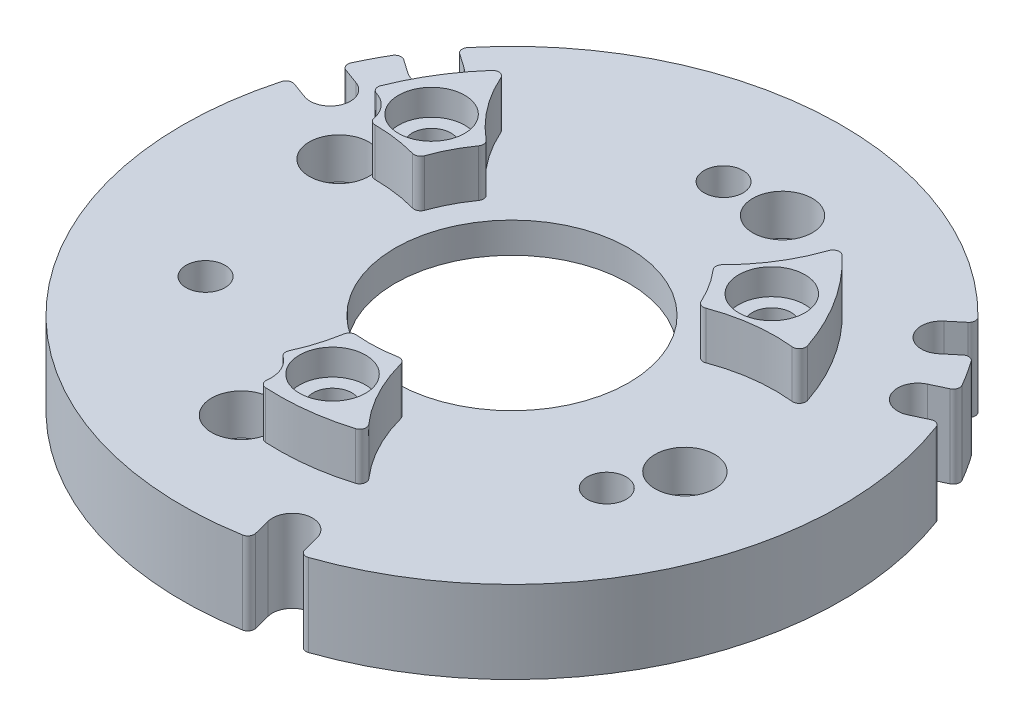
ISO-10303-21;
HEADER;
FILE_DESCRIPTION(('STEP AP214'),'2;1');
FILE_NAME('part.step','',(''),(''),'','','');
FILE_SCHEMA(('AUTOMOTIVE_DESIGN { 1 0 10303 214 1 1 1 1 }'));
ENDSEC;
DATA;
#1=APPLICATION_CONTEXT('core data for automotive mechanical design processes');
#2=APPLICATION_PROTOCOL_DEFINITION('international standard','automotive_design',2000,#1);
#3=PRODUCT_CONTEXT('',#1,'mechanical');
#4=PRODUCT('Part','Part','',(#3));
#5=PRODUCT_RELATED_PRODUCT_CATEGORY('part','',(#4));
#6=PRODUCT_DEFINITION_FORMATION('','',#4);
#7=PRODUCT_DEFINITION_CONTEXT('part definition',#1,'design');
#8=PRODUCT_DEFINITION('design','',#6,#7);
#9=PRODUCT_DEFINITION_SHAPE('','',#8);
#10=(LENGTH_UNIT() NAMED_UNIT(*) SI_UNIT(.MILLI.,.METRE.));
#11=(NAMED_UNIT(*) PLANE_ANGLE_UNIT() SI_UNIT($,.RADIAN.));
#12=(NAMED_UNIT(*) SI_UNIT($,.STERADIAN.) SOLID_ANGLE_UNIT());
#13=UNCERTAINTY_MEASURE_WITH_UNIT(LENGTH_MEASURE(1.E-05),#10,'distance_accuracy_value','');
#14=(GEOMETRIC_REPRESENTATION_CONTEXT(3) GLOBAL_UNCERTAINTY_ASSIGNED_CONTEXT((#13)) GLOBAL_UNIT_ASSIGNED_CONTEXT((#10,
#11,#12)) REPRESENTATION_CONTEXT('',''));
#15=CARTESIAN_POINT('',(0.,0.,0.));
#16=DIRECTION('',(0.,0.,1.));
#17=DIRECTION('',(1.,0.,0.));
#18=AXIS2_PLACEMENT_3D('',#15,#16,#17);
#19=CARTESIAN_POINT('',(1026.51465111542,1020.71700558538,1022.62067815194));
#20=DIRECTION('',(0.,-1.,0.));
#21=DIRECTION('',(0.,0.,-1.));
#22=AXIS2_PLACEMENT_3D('',#19,#20,#21);
#23=PLANE('',#22);
#24=CARTESIAN_POINT('',(1026.51465111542,1020.71700558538,1022.62067815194));
#25=DIRECTION('',(0.,1.,0.));
#26=DIRECTION('',(-0.214984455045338,0.,0.976617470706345));
#27=AXIS2_PLACEMENT_3D('',#24,#25,#26);
#28=CIRCLE('',#27,11.);
#29=CARTESIAN_POINT('',(1017.55543664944,1020.71700558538,1016.23847820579));
#30=VERTEX_POINT('',#29);
#31=CARTESIAN_POINT('',(1016.1369476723,1020.71700558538,1018.97331317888));
#32=VERTEX_POINT('',#31);
#33=EDGE_CURVE('E1070',#30,#32,#28,.T.);
#34=ORIENTED_EDGE('',*,*,#33,.T.);
#35=CARTESIAN_POINT('',(1015.66523387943,1020.71700558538,1018.80752386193));
#36=DIRECTION('',(0.,-1.,0.));
#37=DIRECTION('',(0.214984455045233,0.,-0.976617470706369));
#38=AXIS2_PLACEMENT_3D('',#35,#36,#37);
#39=CIRCLE('',#38,0.499999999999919);
#40=CARTESIAN_POINT('',(1015.53342393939,1020.71700558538,1019.28983718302));
#41=VERTEX_POINT('',#40);
#42=EDGE_CURVE('E990',#32,#41,#39,.T.);
#43=ORIENTED_EDGE('',*,*,#42,.T.);
#44=CARTESIAN_POINT('',(1012.10636549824,1020.71700558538,1031.82998353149));
#45=DIRECTION('',(0.,1.,0.));
#46=DIRECTION('',(-0.214984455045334,0.,0.976617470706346));
#47=AXIS2_PLACEMENT_3D('',#44,#45,#46);
#48=CIRCLE('',#47,13.);
#49=CARTESIAN_POINT('',(1012.17106591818,1020.71700558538,1018.83014453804));
#50=VERTEX_POINT('',#49);
#51=EDGE_CURVE('E1001',#41,#50,#48,.T.);
#52=ORIENTED_EDGE('',*,*,#51,.T.);
#53=CARTESIAN_POINT('',(1012.17355439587,1020.71700558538,1018.3301507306));
#54=DIRECTION('',(0.,-1.,0.));
#55=DIRECTION('',(0.214984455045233,0.,-0.976617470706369));
#56=AXIS2_PLACEMENT_3D('',#53,#54,#55);
#57=CIRCLE('',#56,0.499999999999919);
#58=CARTESIAN_POINT('',(1011.6825349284,1020.71700558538,1018.42448991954));
#59=VERTEX_POINT('',#58);
#60=EDGE_CURVE('E964',#50,#59,#57,.T.);
#61=ORIENTED_EDGE('',*,*,#60,.T.);
#62=CARTESIAN_POINT('',(1009.42384537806,1020.71700558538,1018.85845018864));
#63=DIRECTION('',(0.,-1.,0.));
#64=DIRECTION('',(0.214984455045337,0.,-0.976617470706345));
#65=AXIS2_PLACEMENT_3D('',#62,#63,#64);
#66=CIRCLE('',#65,2.29999999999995);
#67=CARTESIAN_POINT('',(1010.09642241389,1020.71700558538,1016.65898658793));
#68=VERTEX_POINT('',#67);
#69=EDGE_CURVE('E1342',#59,#68,#66,.T.);
#70=ORIENTED_EDGE('',*,*,#69,.T.);
#71=CARTESIAN_POINT('',(1010.24263481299,1020.71700558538,1016.1808423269));
#72=DIRECTION('',(0.,-1.,0.));
#73=DIRECTION('',(0.214984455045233,0.,-0.976617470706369));
#74=AXIS2_PLACEMENT_3D('',#71,#72,#73);
#75=CIRCLE('',#74,0.499999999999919);
#76=CARTESIAN_POINT('',(1009.77772006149,1020.71700558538,1015.99684701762));
#77=VERTEX_POINT('',#76);
#78=EDGE_CURVE('E956',#68,#77,#75,.T.);
#79=ORIENTED_EDGE('',*,*,#78,.T.);
#80=CARTESIAN_POINT('',(1026.51465111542,1020.71700558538,1022.62067815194));
#81=DIRECTION('',(0.,1.,0.));
#82=DIRECTION('',(-0.214984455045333,0.,0.976617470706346));
#83=AXIS2_PLACEMENT_3D('',#80,#81,#82);
#84=CIRCLE('',#83,18.);
#85=CARTESIAN_POINT('',(1013.03388762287,1020.71700558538,1010.69302055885));
#86=VERTEX_POINT('',#85);
#87=EDGE_CURVE('E997',#86,#77,#84,.T.);
#88=ORIENTED_EDGE('',*,*,#87,.F.);
#89=CARTESIAN_POINT('',(1013.40835327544,1020.71700558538,1011.02434438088));
#90=DIRECTION('',(0.,-1.,0.));
#91=DIRECTION('',(0.214984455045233,0.,-0.976617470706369));
#92=AXIS2_PLACEMENT_3D('',#89,#90,#91);
#93=CIRCLE('',#92,0.499999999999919);
#94=CARTESIAN_POINT('',(1013.86520321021,1020.71700558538,1010.82114955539));
#95=VERTEX_POINT('',#94);
#96=EDGE_CURVE('E705',#86,#95,#93,.T.);
#97=ORIENTED_EDGE('',*,*,#96,.T.);
#98=CARTESIAN_POINT('',(1025.7433015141,1020.71700558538,1005.5380840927));
#99=DIRECTION('',(0.,1.,0.));
#100=DIRECTION('',(-0.214984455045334,0.,0.976617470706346));
#101=AXIS2_PLACEMENT_3D('',#98,#99,#100);
#102=CIRCLE('',#101,13.);
#103=CARTESIAN_POINT('',(1017.46653673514,1020.71700558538,1015.56281175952));
#104=VERTEX_POINT('',#103);
#105=EDGE_CURVE('E1000',#95,#104,#102,.T.);
#106=ORIENTED_EDGE('',*,*,#105,.T.);
#107=CARTESIAN_POINT('',(1017.14819962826,1020.71700558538,1015.94837820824));
#108=DIRECTION('',(0.,-1.,0.));
#109=DIRECTION('',(0.214984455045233,0.,-0.976617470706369));
#110=AXIS2_PLACEMENT_3D('',#107,#108,#109);
#111=CIRCLE('',#110,0.499999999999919);
#112=EDGE_CURVE('E978',#104,#30,#111,.T.);
#113=ORIENTED_EDGE('',*,*,#112,.T.);
#114=EDGE_LOOP('',(#34,#43,#52,#61,#70,#79,#88,#97,#106,#113));
#115=FACE_BOUND('',#114,.T.);
#116=CARTESIAN_POINT('',(1026.51465111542,1020.71700558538,1022.62067815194));
#117=DIRECTION('',(0.,1.,0.));
#118=DIRECTION('',(-0.214984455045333,0.,0.976617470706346));
#119=AXIS2_PLACEMENT_3D('',#116,#117,#118);
#120=CIRCLE('',#119,18.);
#121=CARTESIAN_POINT('',(1043.58468734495,1020.71700558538,1016.90982330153));
#122=VERTEX_POINT('',#121);
#123=CARTESIAN_POINT('',(1038.86558059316,1020.71700558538,1009.52661304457));
#124=VERTEX_POINT('',#123);
#125=EDGE_CURVE('E1035',#122,#124,#120,.T.);
#126=ORIENTED_EDGE('',*,*,#125,.F.);
#127=CARTESIAN_POINT('',(1043.11051967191,1020.71700558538,1017.06845815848));
#128=DIRECTION('',(0.,-1.,0.));
#129=DIRECTION('',(0.214984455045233,0.,-0.976617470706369));
#130=AXIS2_PLACEMENT_3D('',#127,#128,#129);
#131=CIRCLE('',#130,0.499999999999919);
#132=CARTESIAN_POINT('',(1043.05806658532,1020.71700558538,1017.56569922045));
#133=VERTEX_POINT('',#132);
#134=EDGE_CURVE('E927',#122,#133,#131,.T.);
#135=ORIENTED_EDGE('',*,*,#134,.T.);
#136=CARTESIAN_POINT('',(1041.69428633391,1020.71700558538,1030.49396683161));
#137=DIRECTION('',(0.,1.,0.));
#138=DIRECTION('',(-0.214984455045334,0.,0.976617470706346));
#139=AXIS2_PLACEMENT_3D('',#136,#137,#138);
#140=CIRCLE('',#139,13.);
#141=CARTESIAN_POINT('',(1037.15099989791,1020.71700558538,1018.31371443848));
#142=VERTEX_POINT('',#141);
#143=EDGE_CURVE('E1086',#133,#142,#140,.T.);
#144=ORIENTED_EDGE('',*,*,#143,.T.);
#145=CARTESIAN_POINT('',(1036.97625811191,1020.71700558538,1017.84524319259));
#146=DIRECTION('',(0.,-1.,0.));
#147=DIRECTION('',(0.214984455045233,0.,-0.976617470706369));
#148=AXIS2_PLACEMENT_3D('',#145,#146,#147);
#149=CIRCLE('',#148,0.499999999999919);
#150=CARTESIAN_POINT('',(1036.5214056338,1020.71700558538,1018.05287079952));
#151=VERTEX_POINT('',#150);
#152=EDGE_CURVE('E902',#142,#151,#149,.T.);
#153=ORIENTED_EDGE('',*,*,#152,.T.);
#154=CARTESIAN_POINT('',(1026.51465111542,1020.71700558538,1022.62067815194));
#155=DIRECTION('',(0.,1.,0.));
#156=DIRECTION('',(-0.214984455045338,0.,0.976617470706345));
#157=AXIS2_PLACEMENT_3D('',#154,#155,#156);
#158=CIRCLE('',#157,11.);
#159=CARTESIAN_POINT('',(1034.86221356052,1020.71700558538,1015.45700582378));
#160=VERTEX_POINT('',#159);
#161=EDGE_CURVE('E662',#151,#160,#158,.T.);
#162=ORIENTED_EDGE('',*,*,#161,.T.);
#163=CARTESIAN_POINT('',(1035.24164821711,1020.71700558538,1015.13138435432));
#164=DIRECTION('',(0.,-1.,0.));
#165=DIRECTION('',(0.214984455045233,0.,-0.976617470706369));
#166=AXIS2_PLACEMENT_3D('',#163,#164,#165);
#167=CIRCLE('',#166,0.499999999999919);
#168=CARTESIAN_POINT('',(1034.88985759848,1020.71700558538,1014.77607693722));
#169=VERTEX_POINT('',#168);
#170=EDGE_CURVE('E899',#160,#169,#167,.T.);
#171=ORIENTED_EDGE('',*,*,#170,.T.);
#172=CARTESIAN_POINT('',(1025.7433015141,1020.71700558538,1005.5380840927));
#173=DIRECTION('',(0.,1.,0.));
#174=DIRECTION('',(-0.214984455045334,0.,0.976617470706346));
#175=AXIS2_PLACEMENT_3D('',#172,#173,#174);
#176=CIRCLE('',#175,13.);
#177=CARTESIAN_POINT('',(1038.04919560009,1020.71700558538,1009.72914252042));
#178=VERTEX_POINT('',#177);
#179=EDGE_CURVE('E1032',#169,#178,#176,.T.);
#180=ORIENTED_EDGE('',*,*,#179,.T.);
#181=CARTESIAN_POINT('',(1038.52249921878,1020.71700558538,1009.89033707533));
#182=DIRECTION('',(0.,-1.,0.));
#183=DIRECTION('',(0.214984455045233,0.,-0.976617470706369));
#184=AXIS2_PLACEMENT_3D('',#181,#182,#183);
#185=CIRCLE('',#184,0.499999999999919);
#186=EDGE_CURVE('E918',#178,#124,#185,.T.);
#187=ORIENTED_EDGE('',*,*,#186,.T.);
#188=EDGE_LOOP('',(#126,#135,#144,#153,#162,#171,#180,#187));
#189=FACE_BOUND('',#188,.T.);
#190=CARTESIAN_POINT('',(1026.51465111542,1020.71700558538,1022.62067815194));
#191=DIRECTION('',(0.,-1.,0.));
#192=DIRECTION('',(0.214984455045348,0.,-0.976617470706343));
#193=AXIS2_PLACEMENT_3D('',#190,#191,#192);
#194=CIRCLE('',#193,9.);
#195=CARTESIAN_POINT('',(1028.44951121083,1020.71700558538,1013.83112091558));
#196=VERTEX_POINT('',#195);
#197=EDGE_CURVE('E1125',#196,#196,#194,.T.);
#198=ORIENTED_EDGE('',*,*,#197,.T.);
#199=EDGE_LOOP('',(#198));
#200=FACE_BOUND('',#199,.T.);
#201=CARTESIAN_POINT('',(1026.51465111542,1020.71700558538,1022.62067815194));
#202=DIRECTION('',(0.,1.,0.));
#203=DIRECTION('',(-0.214984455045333,0.,0.976617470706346));
#204=AXIS2_PLACEMENT_3D('',#201,#202,#203);
#205=CIRCLE('',#204,18.);
#206=CARTESIAN_POINT('',(1025.49810670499,1020.71700558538,1040.59195071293));
#207=VERTEX_POINT('',#206);
#208=CARTESIAN_POINT('',(1031.67897939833,1020.71700558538,1039.86392939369));
#209=VERTEX_POINT('',#208);
#210=EDGE_CURVE('E1076',#207,#209,#205,.T.);
#211=ORIENTED_EDGE('',*,*,#210,.F.);
#212=CARTESIAN_POINT('',(1025.52634404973,1020.71700558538,1040.09274869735));
#213=DIRECTION('',(0.,-1.,0.));
#214=DIRECTION('',(0.214984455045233,0.,-0.976617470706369));
#215=AXIS2_PLACEMENT_3D('',#212,#213,#214);
#216=CIRCLE('',#215,0.499999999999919);
#217=CARTESIAN_POINT('',(1025.0310010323,1020.71700558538,1040.02466569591));
#218=VERTEX_POINT('',#217);
#219=EDGE_CURVE('E782',#207,#218,#216,.T.);
#220=ORIENTED_EDGE('',*,*,#219,.T.);
#221=CARTESIAN_POINT('',(1022.75242315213,1020.71700558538,1039.7114838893));
#222=DIRECTION('',(0.,-1.,0.));
#223=DIRECTION('',(0.214984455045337,0.,-0.976617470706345));
#224=AXIS2_PLACEMENT_3D('',#221,#222,#223);
#225=CIRCLE('',#224,2.29999999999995);
#226=CARTESIAN_POINT('',(1024.09472755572,1020.71700558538,1037.84380648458));
#227=VERTEX_POINT('',#226);
#228=EDGE_CURVE('E1010',#218,#227,#225,.T.);
#229=ORIENTED_EDGE('',*,*,#228,.T.);
#230=CARTESIAN_POINT('',(1024.38653286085,1020.71700558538,1037.43778965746));
#231=DIRECTION('',(0.,-1.,0.));
#232=DIRECTION('',(0.214984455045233,0.,-0.976617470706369));
#233=AXIS2_PLACEMENT_3D('',#230,#231,#232);
#234=CIRCLE('',#233,0.499999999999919);
#235=CARTESIAN_POINT('',(1023.93171184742,1020.71700558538,1037.23009313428));
#236=VERTEX_POINT('',#235);
#237=EDGE_CURVE('E952',#227,#236,#234,.T.);
#238=ORIENTED_EDGE('',*,*,#237,.T.);
#239=CARTESIAN_POINT('',(1012.10636549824,1020.71700558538,1031.82998353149));
#240=DIRECTION('',(0.,1.,0.));
#241=DIRECTION('',(-0.214984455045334,0.,0.976617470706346));
#242=AXIS2_PLACEMENT_3D('',#239,#240,#241);
#243=CIRCLE('',#242,13.);
#244=CARTESIAN_POINT('',(1024.9264167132,1020.71700558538,1033.98550825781));
#245=VERTEX_POINT('',#244);
#246=EDGE_CURVE('E687',#236,#245,#243,.T.);
#247=ORIENTED_EDGE('',*,*,#246,.T.);
#248=CARTESIAN_POINT('',(1025.41949560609,1020.71700558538,1034.06841305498));
#249=DIRECTION('',(0.,-1.,0.));
#250=DIRECTION('',(0.214984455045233,0.,-0.976617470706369));
#251=AXIS2_PLACEMENT_3D('',#248,#249,#250);
#252=CIRCLE('',#251,0.499999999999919);
#253=CARTESIAN_POINT('',(1025.46711106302,1020.71700558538,1033.5706854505));
#254=VERTEX_POINT('',#253);
#255=EDGE_CURVE('E721',#245,#254,#252,.T.);
#256=ORIENTED_EDGE('',*,*,#255,.T.);
#257=CARTESIAN_POINT('',(1026.51465111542,1020.71700558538,1022.62067815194));
#258=DIRECTION('',(0.,1.,0.));
#259=DIRECTION('',(-0.214984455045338,0.,0.976617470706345));
#260=AXIS2_PLACEMENT_3D('',#257,#258,#259);
#261=CIRCLE('',#260,11.);
#262=CARTESIAN_POINT('',(1028.54479211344,1020.71700558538,1033.43171545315));
#263=VERTEX_POINT('',#262);
#264=EDGE_CURVE('E682',#254,#263,#261,.T.);
#265=ORIENTED_EDGE('',*,*,#264,.T.);
#266=CARTESIAN_POINT('',(1028.63707124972,1020.71700558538,1033.92312623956));
#267=DIRECTION('',(0.,-1.,0.));
#268=DIRECTION('',(0.214984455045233,0.,-0.976617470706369));
#269=AXIS2_PLACEMENT_3D('',#266,#267,#268);
#270=CIRCLE('',#269,0.499999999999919);
#271=CARTESIAN_POINT('',(1029.12067180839,1020.71700558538,1033.79612033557));
#272=VERTEX_POINT('',#271);
#273=EDGE_CURVE('E778',#263,#272,#270,.T.);
#274=ORIENTED_EDGE('',*,*,#273,.T.);
#275=CARTESIAN_POINT('',(1041.69428633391,1020.71700558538,1030.49396683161));
#276=DIRECTION('',(0.,1.,0.));
#277=DIRECTION('',(-0.214984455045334,0.,0.976617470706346));
#278=AXIS2_PLACEMENT_3D('',#275,#276,#277);
#279=CIRCLE('',#278,13.);
#280=CARTESIAN_POINT('',(1031.91177622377,1020.71700558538,1039.0556545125));
#281=VERTEX_POINT('',#280);
#282=EDGE_CURVE('E1073',#272,#281,#279,.T.);
#283=ORIENTED_EDGE('',*,*,#282,.T.);
#284=CARTESIAN_POINT('',(1031.53552583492,1020.71700558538,1039.38495019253));
#285=DIRECTION('',(0.,-1.,0.));
#286=DIRECTION('',(0.214984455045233,0.,-0.976617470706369));
#287=AXIS2_PLACEMENT_3D('',#284,#285,#286);
#288=CIRCLE('',#287,0.499999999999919);
#289=EDGE_CURVE('E938',#281,#209,#288,.T.);
#290=ORIENTED_EDGE('',*,*,#289,.T.);
#291=EDGE_LOOP('',(#211,#220,#229,#238,#247,#256,#265,#274,#283,#290));
#292=FACE_BOUND('',#291,.T.);
#293=CARTESIAN_POINT('',(1030.27687907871,1020.71700558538,1005.52987241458));
#294=DIRECTION('',(0.,-1.,0.));
#295=DIRECTION('',(0.214984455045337,0.,-0.976617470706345));
#296=AXIS2_PLACEMENT_3D('',#293,#294,#295);
#297=CIRCLE('',#296,2.29999999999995);
#298=CARTESIAN_POINT('',(1030.77134332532,1020.71700558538,1003.28365223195));
#299=VERTEX_POINT('',#298);
#300=EDGE_CURVE('E1002',#299,#299,#297,.T.);
#301=ORIENTED_EDGE('',*,*,#300,.T.);
#302=EDGE_LOOP('',(#301));
#303=FACE_BOUND('',#302,.T.);
#304=CARTESIAN_POINT('',(1043.60545685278,1020.71700558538,1026.38290611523));
#305=DIRECTION('',(0.,-1.,0.));
#306=DIRECTION('',(0.214984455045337,0.,-0.976617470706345));
#307=AXIS2_PLACEMENT_3D('',#304,#305,#306);
#308=CIRCLE('',#307,2.29999999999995);
#309=CARTESIAN_POINT('',(1044.09992109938,1020.71700558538,1024.13668593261));
#310=VERTEX_POINT('',#309);
#311=EDGE_CURVE('E1006',#310,#310,#308,.T.);
#312=ORIENTED_EDGE('',*,*,#311,.T.);
#313=EDGE_LOOP('',(#312));
#314=FACE_BOUND('',#313,.T.);
#315=CARTESIAN_POINT('',(1025.7433015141,1020.71700558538,1005.5380840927));
#316=DIRECTION('',(0.,-1.,0.));
#317=DIRECTION('',(0.214984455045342,0.,-0.976617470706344));
#318=AXIS2_PLACEMENT_3D('',#315,#316,#317);
#319=CIRCLE('',#318,1.5);
#320=CARTESIAN_POINT('',(1026.06577819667,1020.71700558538,1004.07315788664));
#321=VERTEX_POINT('',#320);
#322=EDGE_CURVE('E1557',#321,#321,#319,.T.);
#323=ORIENTED_EDGE('',*,*,#322,.T.);
#324=EDGE_LOOP('',(#323));
#325=FACE_BOUND('',#324,.T.);
#326=CARTESIAN_POINT('',(1041.69428633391,1020.71700558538,1030.49396683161));
#327=DIRECTION('',(0.,-1.,0.));
#328=DIRECTION('',(0.214984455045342,0.,-0.976617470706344));
#329=AXIS2_PLACEMENT_3D('',#326,#327,#328);
#330=CIRCLE('',#329,1.5);
#331=CARTESIAN_POINT('',(1042.01676301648,1020.71700558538,1029.02904062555));
#332=VERTEX_POINT('',#331);
#333=EDGE_CURVE('E1561',#332,#332,#330,.T.);
#334=ORIENTED_EDGE('',*,*,#333,.T.);
#335=EDGE_LOOP('',(#334));
#336=FACE_BOUND('',#335,.T.);
#337=CARTESIAN_POINT('',(1012.10636549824,1020.71700558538,1031.82998353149));
#338=DIRECTION('',(0.,-1.,0.));
#339=DIRECTION('',(0.214984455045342,0.,-0.976617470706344));
#340=AXIS2_PLACEMENT_3D('',#337,#338,#339);
#341=CIRCLE('',#340,1.5);
#342=CARTESIAN_POINT('',(1012.42884218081,1020.71700558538,1030.36505732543));
#343=VERTEX_POINT('',#342);
#344=EDGE_CURVE('E1496',#343,#343,#341,.T.);
#345=ORIENTED_EDGE('',*,*,#344,.T.);
#346=EDGE_LOOP('',(#345));
#347=FACE_BOUND('',#346,.T.);
#348=CARTESIAN_POINT('',(1026.51465111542,1020.71700558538,1022.62067815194));
#349=DIRECTION('',(0.,1.,0.));
#350=DIRECTION('',(0.214984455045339,0.,-0.976617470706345));
#351=AXIS2_PLACEMENT_3D('',#348,#349,#350);
#352=CIRCLE('',#351,25.4);
#353=CARTESIAN_POINT('',(1002.02166402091,1020.71700558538,1015.89359979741));
#354=VERTEX_POINT('',#353);
#355=CARTESIAN_POINT('',(1030.78249249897,1020.71700558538,1047.65955851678));
#356=VERTEX_POINT('',#355);
#357=EDGE_CURVE('E844',#354,#356,#352,.T.);
#358=ORIENTED_EDGE('',*,*,#357,.T.);
#359=CARTESIAN_POINT('',(1030.69847987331,1020.71700558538,1047.16666717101));
#360=DIRECTION('',(0.,1.,0.));
#361=DIRECTION('',(0.214984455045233,0.,-0.976617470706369));
#362=AXIS2_PLACEMENT_3D('',#359,#360,#361);
#363=CIRCLE('',#362,0.499999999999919);
#364=CARTESIAN_POINT('',(1031.18278123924,1020.71700558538,1047.04236034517));
#365=VERTEX_POINT('',#364);
#366=EDGE_CURVE('E667',#356,#365,#363,.T.);
#367=ORIENTED_EDGE('',*,*,#366,.T.);
#368=DIRECTION('',(0.248613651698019,0.,0.968602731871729));
#369=VECTOR('',#368,1.);
#370=CARTESIAN_POINT('',(1025.01331688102,1020.71700558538,1023.00602931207));
#371=LINE('',#370,#369);
#372=CARTESIAN_POINT('',(1030.85573769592,1020.71700558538,1045.76819351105));
#373=VERTEX_POINT('',#372);
#374=EDGE_CURVE('E674',#373,#365,#371,.T.);
#375=ORIENTED_EDGE('',*,*,#374,.F.);
#376=CARTESIAN_POINT('',(1032.35707193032,1020.71700558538,1045.38284235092));
#377=DIRECTION('',(0.,1.,0.));
#378=DIRECTION('',(-0.214984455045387,0.,0.976617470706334));
#379=AXIS2_PLACEMENT_3D('',#376,#377,#378);
#380=CIRCLE('',#379,1.55000000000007);
#381=CARTESIAN_POINT('',(1033.85840616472,1020.71700558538,1044.99749119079));
#382=VERTEX_POINT('',#381);
#383=EDGE_CURVE('E1161',#382,#373,#380,.T.);
#384=ORIENTED_EDGE('',*,*,#383,.F.);
#385=DIRECTION('',(0.248613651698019,0.,0.968602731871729));
#386=VECTOR('',#385,1.);
#387=CARTESIAN_POINT('',(1028.01598534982,1020.71700558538,1022.2353269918));
#388=LINE('',#387,#386);
#389=CARTESIAN_POINT('',(1034.18544970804,1020.71700558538,1046.2716580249));
#390=VERTEX_POINT('',#389);
#391=EDGE_CURVE('E656',#382,#390,#388,.T.);
#392=ORIENTED_EDGE('',*,*,#391,.T.);
#393=CARTESIAN_POINT('',(1034.66975107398,1020.71700558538,1046.14735119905));
#394=DIRECTION('',(0.,1.,0.));
#395=DIRECTION('',(0.214984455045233,0.,-0.976617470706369));
#396=AXIS2_PLACEMENT_3D('',#393,#394,#395);
#397=CIRCLE('',#396,0.499999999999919);
#398=CARTESIAN_POINT('',(1034.83350810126,1020.71700558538,1046.61977435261));
#399=VERTEX_POINT('',#398);
#400=EDGE_CURVE('E643',#390,#399,#397,.T.);
#401=ORIENTED_EDGE('',*,*,#400,.T.);
#402=CARTESIAN_POINT('',(1026.51465111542,1020.71700558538,1022.62067815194));
#403=DIRECTION('',(0.,1.,0.));
#404=DIRECTION('',(0.214984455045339,0.,-0.976617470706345));
#405=AXIS2_PLACEMENT_3D('',#402,#403,#404);
#406=CIRCLE('',#405,25.4);
#407=CARTESIAN_POINT('',(1050.30168961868,1020.71700558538,1013.71355744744));
#408=VERTEX_POINT('',#407);
#409=EDGE_CURVE('E1154',#399,#408,#406,.T.);
#410=ORIENTED_EDGE('',*,*,#409,.T.);
#411=CARTESIAN_POINT('',(1049.83344082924,1020.71700558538,1013.88889446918));
#412=DIRECTION('',(0.,1.,0.));
#413=DIRECTION('',(0.214984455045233,0.,-0.976617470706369));
#414=AXIS2_PLACEMENT_3D('',#411,#412,#413);
#415=CIRCLE('',#414,0.499999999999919);
#416=CARTESIAN_POINT('',(1049.6201484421,1020.71700558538,1013.4366706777));
#417=VERTEX_POINT('',#416);
#418=EDGE_CURVE('E1270',#408,#417,#415,.T.);
#419=ORIENTED_EDGE('',*,*,#418,.T.);
#420=DIRECTION('',(0.904447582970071,0.,-0.426584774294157));
#421=VECTOR('',#420,1.);
#422=CARTESIAN_POINT('',(1027.17585751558,1020.71700558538,1024.02257190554));
#423=LINE('',#422,#421);
#424=CARTESIAN_POINT('',(1048.43037571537,1020.71700558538,1013.99782970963));
#425=VERTEX_POINT('',#424);
#426=EDGE_CURVE('E773',#425,#417,#423,.T.);
#427=ORIENTED_EDGE('',*,*,#426,.F.);
#428=CARTESIAN_POINT('',(1047.76916931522,1020.71700558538,1012.59593595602));
#429=DIRECTION('',(0.,1.,0.));
#430=DIRECTION('',(-0.214984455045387,0.,0.976617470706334));
#431=AXIS2_PLACEMENT_3D('',#428,#429,#430);
#432=CIRCLE('',#431,1.55000000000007);
#433=CARTESIAN_POINT('',(1047.10796291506,1020.71700558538,1011.19404220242));
#434=VERTEX_POINT('',#433);
#435=EDGE_CURVE('E1174',#434,#425,#432,.T.);
#436=ORIENTED_EDGE('',*,*,#435,.F.);
#437=DIRECTION('',(0.904447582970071,0.,-0.426584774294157));
#438=VECTOR('',#437,1.);
#439=CARTESIAN_POINT('',(1025.85344471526,1020.71700558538,1021.21878439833));
#440=LINE('',#439,#438);
#441=CARTESIAN_POINT('',(1048.29773564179,1020.71700558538,1010.63288317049));
#442=VERTEX_POINT('',#441);
#443=EDGE_CURVE('E766',#434,#442,#440,.T.);
#444=ORIENTED_EDGE('',*,*,#443,.T.);
#445=CARTESIAN_POINT('',(1048.08444325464,1020.71700558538,1010.180659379));
#446=DIRECTION('',(0.,1.,0.));
#447=DIRECTION('',(0.214984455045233,0.,-0.976617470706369));
#448=AXIS2_PLACEMENT_3D('',#445,#446,#447);
#449=CIRCLE('',#448,0.499999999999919);
#450=CARTESIAN_POINT('',(1048.51757161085,1020.71700558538,1009.93085980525));
#451=VERTEX_POINT('',#450);
#452=EDGE_CURVE('E1262',#442,#451,#449,.T.);
#453=ORIENTED_EDGE('',*,*,#452,.T.);
#454=CARTESIAN_POINT('',(1026.51465111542,1020.71700558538,1022.62067815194));
#455=DIRECTION('',(0.,1.,0.));
#456=DIRECTION('',(0.214984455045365,0.,-0.976617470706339));
#457=AXIS2_PLACEMENT_3D('',#454,#455,#456);
#458=CIRCLE('',#457,25.4);
#459=CARTESIAN_POINT('',(1047.27082504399,1020.71700558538,1007.98028048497));
#460=VERTEX_POINT('',#459);
#461=EDGE_CURVE('E1011',#451,#460,#458,.T.);
#462=ORIENTED_EDGE('',*,*,#461,.T.);
#463=CARTESIAN_POINT('',(1046.86223894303,1020.71700558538,1008.26847728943));
#464=DIRECTION('',(0.,1.,0.));
#465=DIRECTION('',(0.214984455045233,0.,-0.976617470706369));
#466=AXIS2_PLACEMENT_3D('',#463,#464,#465);
#467=CIRCLE('',#466,0.499999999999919);
#468=CARTESIAN_POINT('',(1046.54138190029,1020.71700558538,1007.88500531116));
#469=VERTEX_POINT('',#468);
#470=EDGE_CURVE('E1380',#460,#469,#467,.T.);
#471=ORIENTED_EDGE('',*,*,#470,.T.);
#472=DIRECTION('',(0.766943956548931,0.,-0.641714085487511));
#473=VECTOR('',#472,1.);
#474=CARTESIAN_POINT('',(1027.50930794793,1020.71700558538,1023.80944128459));
#475=LINE('',#474,#473);
#476=CARTESIAN_POINT('',(1045.53249092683,1020.71700558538,1008.72916027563));
#477=VERTEX_POINT('',#476);
#478=EDGE_CURVE('E752',#477,#469,#475,.T.);
#479=ORIENTED_EDGE('',*,*,#478,.F.);
#480=CARTESIAN_POINT('',(1044.53783409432,1020.71700558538,1007.54039714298));
#481=DIRECTION('',(0.,1.,0.));
#482=DIRECTION('',(-0.214984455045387,0.,0.976617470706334));
#483=AXIS2_PLACEMENT_3D('',#480,#481,#482);
#484=CIRCLE('',#483,1.55000000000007);
#485=CARTESIAN_POINT('',(1043.54317726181,1020.71700558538,1006.35163401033));
#486=VERTEX_POINT('',#485);
#487=EDGE_CURVE('E1165',#486,#477,#484,.T.);
#488=ORIENTED_EDGE('',*,*,#487,.F.);
#489=DIRECTION('',(0.766943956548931,0.,-0.641714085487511));
#490=VECTOR('',#489,1.);
#491=CARTESIAN_POINT('',(1025.51999428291,1020.71700558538,1021.43191501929));
#492=LINE('',#491,#490);
#493=CARTESIAN_POINT('',(1044.55206823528,1020.71700558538,1005.50747904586));
#494=VERTEX_POINT('',#493);
#495=EDGE_CURVE('E745',#486,#494,#492,.T.);
#496=ORIENTED_EDGE('',*,*,#495,.T.);
#497=CARTESIAN_POINT('',(1044.23121119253,1020.71700558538,1005.12400706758));
#498=DIRECTION('',(0.,1.,0.));
#499=DIRECTION('',(0.214984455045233,0.,-0.976617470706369));
#500=AXIS2_PLACEMENT_3D('',#497,#498,#499);
#501=CIRCLE('',#500,0.499999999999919);
#502=CARTESIAN_POINT('',(1044.58696541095,1020.71700558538,1004.77266829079));
#503=VERTEX_POINT('',#502);
#504=EDGE_CURVE('E1228',#494,#503,#501,.T.);
#505=ORIENTED_EDGE('',*,*,#504,.T.);
#506=CARTESIAN_POINT('',(1026.51465111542,1020.71700558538,1022.62067815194));
#507=DIRECTION('',(0.,1.,0.));
#508=DIRECTION('',(0.214984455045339,0.,-0.976617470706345));
#509=AXIS2_PLACEMENT_3D('',#506,#507,#508);
#510=CIRCLE('',#509,25.4);
#511=CARTESIAN_POINT('',(1006.93423638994,1020.71700558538,1006.44145199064));
#512=VERTEX_POINT('',#511);
#513=EDGE_CURVE('E617',#503,#512,#510,.T.);
#514=ORIENTED_EDGE('',*,*,#513,.T.);
#515=CARTESIAN_POINT('',(1007.31967762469,1020.71700558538,1006.75994069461));
#516=DIRECTION('',(0.,1.,0.));
#517=DIRECTION('',(0.214984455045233,0.,-0.976617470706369));
#518=AXIS2_PLACEMENT_3D('',#515,#516,#517);
#519=CIRCLE('',#518,0.499999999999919);
#520=CARTESIAN_POINT('',(1007.03400324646,1020.71700558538,1007.17029438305));
#521=VERTEX_POINT('',#520);
#522=EDGE_CURVE('E632',#512,#521,#519,.T.);
#523=ORIENTED_EDGE('',*,*,#522,.T.);
#524=DIRECTION('',(-0.820707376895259,0.,-0.571348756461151));
#525=VECTOR('',#524,1.);
#526=CARTESIAN_POINT('',(1027.40024168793,1020.71700558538,1021.34858171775));
#527=LINE('',#526,#525);
#528=CARTESIAN_POINT('',(1008.1136183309,1020.71700558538,1007.92188594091));
#529=VERTEX_POINT('',#528);
#530=EDGE_CURVE('E702',#529,#521,#527,.T.);
#531=ORIENTED_EDGE('',*,*,#530,.F.);
#532=CARTESIAN_POINT('',(1007.22802775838,1020.71700558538,1009.1939823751));
#533=DIRECTION('',(0.,1.,0.));
#534=DIRECTION('',(-0.214984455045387,0.,0.976617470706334));
#535=AXIS2_PLACEMENT_3D('',#532,#533,#534);
#536=CIRCLE('',#535,1.55000000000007);
#537=CARTESIAN_POINT('',(1006.34243718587,1020.71700558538,1010.46607880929));
#538=VERTEX_POINT('',#537);
#539=EDGE_CURVE('E1168',#538,#529,#536,.T.);
#540=ORIENTED_EDGE('',*,*,#539,.F.);
#541=DIRECTION('',(-0.820707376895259,0.,-0.571348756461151));
#542=VECTOR('',#541,1.);
#543=CARTESIAN_POINT('',(1025.6290605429,1020.71700558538,1023.89277458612));
#544=LINE('',#543,#542);
#545=CARTESIAN_POINT('',(1005.26282210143,1020.71700558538,1009.71448725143));
#546=VERTEX_POINT('',#545);
#547=EDGE_CURVE('E695',#538,#546,#544,.T.);
#548=ORIENTED_EDGE('',*,*,#547,.T.);
#549=CARTESIAN_POINT('',(1004.9771477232,1020.71700558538,1010.12484093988));
#550=DIRECTION('',(0.,1.,0.));
#551=DIRECTION('',(0.214984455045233,0.,-0.976617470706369));
#552=AXIS2_PLACEMENT_3D('',#549,#550,#551);
#553=CIRCLE('',#552,0.499999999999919);
#554=CARTESIAN_POINT('',(1004.54466773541,1020.71700558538,1009.87392051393));
#555=VERTEX_POINT('',#554);
#556=EDGE_CURVE('E49',#546,#555,#553,.T.);
#557=ORIENTED_EDGE('',*,*,#556,.T.);
#558=CARTESIAN_POINT('',(1026.51465111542,1020.71700558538,1022.62067815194));
#559=DIRECTION('',(0.,1.,0.));
#560=DIRECTION('',(0.214984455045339,0.,-0.976617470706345));
#561=AXIS2_PLACEMENT_3D('',#558,#559,#560);
#562=CIRCLE('',#561,25.4);
#563=CARTESIAN_POINT('',(1003.45760785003,1020.71700558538,1011.96550307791));
#564=VERTEX_POINT('',#563);
#565=EDGE_CURVE('E843',#555,#564,#562,.T.);
#566=ORIENTED_EDGE('',*,*,#565,.T.);
#567=CARTESIAN_POINT('',(1003.91148665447,1020.71700558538,1012.17525061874));
#568=DIRECTION('',(0.,1.,0.));
#569=DIRECTION('',(0.214984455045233,0.,-0.976617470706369));
#570=AXIS2_PLACEMENT_3D('',#567,#568,#569);
#571=CIRCLE('',#570,0.499999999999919);
#572=CARTESIAN_POINT('',(1003.73981870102,1020.71700558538,1012.64485695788));
#573=VERTEX_POINT('',#572);
#574=EDGE_CURVE('E1200',#564,#573,#571,.T.);
#575=ORIENTED_EDGE('',*,*,#574,.T.);
#576=DIRECTION('',(-0.939212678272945,0.,-0.343335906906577));
#577=VECTOR('',#576,1.);
#578=CARTESIAN_POINT('',(1027.04682177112,1020.71700558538,1021.16489850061));
#579=LINE('',#578,#577);
#580=CARTESIAN_POINT('',(1004.97532383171,1020.71700558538,1013.09650468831));
#581=VERTEX_POINT('',#580);
#582=EDGE_CURVE('E730',#581,#573,#579,.T.);
#583=ORIENTED_EDGE('',*,*,#582,.F.);
#584=CARTESIAN_POINT('',(1004.44315317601,1020.71700558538,1014.55228433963));
#585=DIRECTION('',(0.,1.,0.));
#586=DIRECTION('',(-0.214984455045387,0.,0.976617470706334));
#587=AXIS2_PLACEMENT_3D('',#584,#585,#586);
#588=CIRCLE('',#587,1.55000000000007);
#589=CARTESIAN_POINT('',(1003.9109825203,1020.71700558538,1016.00806399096));
#590=VERTEX_POINT('',#589);
#591=EDGE_CURVE('E25',#590,#581,#588,.T.);
#592=ORIENTED_EDGE('',*,*,#591,.F.);
#593=DIRECTION('',(-0.939212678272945,0.,-0.343335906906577));
#594=VECTOR('',#593,1.);
#595=CARTESIAN_POINT('',(1025.98248045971,1020.71700558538,1024.07645780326));
#596=LINE('',#595,#594);
#597=CARTESIAN_POINT('',(1002.67547738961,1020.71700558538,1015.55641626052));
#598=VERTEX_POINT('',#597);
#599=EDGE_CURVE('E723',#590,#598,#596,.T.);
#600=ORIENTED_EDGE('',*,*,#599,.T.);
#601=CARTESIAN_POINT('',(1002.50380943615,1020.71700558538,1016.02602259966));
#602=DIRECTION('',(0.,1.,0.));
#603=DIRECTION('',(0.214984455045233,0.,-0.976617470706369));
#604=AXIS2_PLACEMENT_3D('',#601,#602,#603);
#605=CIRCLE('',#604,0.499999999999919);
#606=EDGE_CURVE('E1280',#598,#354,#605,.T.);
#607=ORIENTED_EDGE('',*,*,#606,.T.);
#608=EDGE_LOOP('',(#358,#367,#375,#384,#392,#401,#410,#419,#427,#436,#444,#453,#462,#471,#479,
#488,#496,#505,#514,#523,#531,#540,#548,#557,#566,#575,#583,#592,#600,#607));
#609=FACE_BOUND('',#608,.T.);
#610=ADVANCED_FACE('F17',(#115,#189,#200,#292,#303,#314,#325,#336,#347,#609),#23,.F.);
#611=CARTESIAN_POINT('',(1026.51465111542,1014.36700558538,1022.62067815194));
#612=DIRECTION('',(0.,-1.,0.));
#613=DIRECTION('',(0.,0.,-1.));
#614=AXIS2_PLACEMENT_3D('',#611,#612,#613);
#615=PLANE('',#614);
#616=CARTESIAN_POINT('',(1026.51465111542,1014.36700558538,1022.62067815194));
#617=DIRECTION('',(0.,-1.,0.));
#618=DIRECTION('',(0.214984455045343,0.,-0.976617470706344));
#619=AXIS2_PLACEMENT_3D('',#616,#617,#618);
#620=CIRCLE('',#619,21.25);
#621=CARTESIAN_POINT('',(1031.08307078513,1014.36700558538,1001.86755689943));
#622=VERTEX_POINT('',#621);
#623=EDGE_CURVE('E1129',#622,#622,#620,.T.);
#624=ORIENTED_EDGE('',*,*,#623,.F.);
#625=EDGE_LOOP('',(#624));
#626=FACE_BOUND('',#625,.T.);
#627=DIRECTION('',(-0.248613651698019,0.,-0.968602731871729));
#628=VECTOR('',#627,1.);
#629=CARTESIAN_POINT('',(1025.01331688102,1014.36700558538,1023.00602931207));
#630=LINE('',#629,#628);
#631=CARTESIAN_POINT('',(1031.18278123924,1014.36700558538,1047.04236034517));
#632=VERTEX_POINT('',#631);
#633=CARTESIAN_POINT('',(1030.85573769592,1014.36700558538,1045.76819351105));
#634=VERTEX_POINT('',#633);
#635=EDGE_CURVE('E677',#632,#634,#630,.T.);
#636=ORIENTED_EDGE('',*,*,#635,.F.);
#637=CARTESIAN_POINT('',(1030.69847987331,1014.36700558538,1047.16666717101));
#638=DIRECTION('',(0.,-1.,0.));
#639=DIRECTION('',(0.214984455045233,0.,-0.976617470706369));
#640=AXIS2_PLACEMENT_3D('',#637,#638,#639);
#641=CIRCLE('',#640,0.499999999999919);
#642=CARTESIAN_POINT('',(1030.78249249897,1014.36700558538,1047.65955851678));
#643=VERTEX_POINT('',#642);
#644=EDGE_CURVE('E1238',#632,#643,#641,.T.);
#645=ORIENTED_EDGE('',*,*,#644,.T.);
#646=CARTESIAN_POINT('',(1026.51465111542,1014.36700558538,1022.62067815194));
#647=DIRECTION('',(0.,-1.,0.));
#648=DIRECTION('',(0.214984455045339,0.,-0.976617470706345));
#649=AXIS2_PLACEMENT_3D('',#646,#647,#648);
#650=CIRCLE('',#649,25.4);
#651=CARTESIAN_POINT('',(1002.02166402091,1014.36700558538,1015.89359979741));
#652=VERTEX_POINT('',#651);
#653=EDGE_CURVE('E616',#643,#652,#650,.T.);
#654=ORIENTED_EDGE('',*,*,#653,.T.);
#655=CARTESIAN_POINT('',(1002.50380943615,1014.36700558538,1016.02602259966));
#656=DIRECTION('',(0.,-1.,0.));
#657=DIRECTION('',(0.214984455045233,0.,-0.976617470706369));
#658=AXIS2_PLACEMENT_3D('',#655,#656,#657);
#659=CIRCLE('',#658,0.499999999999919);
#660=CARTESIAN_POINT('',(1002.67547738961,1014.36700558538,1015.55641626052));
#661=VERTEX_POINT('',#660);
#662=EDGE_CURVE('E1207',#652,#661,#659,.T.);
#663=ORIENTED_EDGE('',*,*,#662,.T.);
#664=DIRECTION('',(0.939212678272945,0.,0.343335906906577));
#665=VECTOR('',#664,1.);
#666=CARTESIAN_POINT('',(1025.98248045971,1014.36700558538,1024.07645780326));
#667=LINE('',#666,#665);
#668=CARTESIAN_POINT('',(1003.9109825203,1014.36700558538,1016.00806399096));
#669=VERTEX_POINT('',#668);
#670=EDGE_CURVE('E717',#661,#669,#667,.T.);
#671=ORIENTED_EDGE('',*,*,#670,.T.);
#672=CARTESIAN_POINT('',(1004.44315317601,1014.36700558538,1014.55228433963));
#673=DIRECTION('',(0.,1.,0.));
#674=DIRECTION('',(-0.214984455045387,0.,0.976617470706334));
#675=AXIS2_PLACEMENT_3D('',#672,#673,#674);
#676=CIRCLE('',#675,1.55000000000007);
#677=CARTESIAN_POINT('',(1004.97532383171,1014.36700558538,1013.09650468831));
#678=VERTEX_POINT('',#677);
#679=EDGE_CURVE('E1182',#669,#678,#676,.T.);
#680=ORIENTED_EDGE('',*,*,#679,.T.);
#681=DIRECTION('',(0.939212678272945,0.,0.343335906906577));
#682=VECTOR('',#681,1.);
#683=CARTESIAN_POINT('',(1027.04682177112,1014.36700558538,1021.16489850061));
#684=LINE('',#683,#682);
#685=CARTESIAN_POINT('',(1003.73981870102,1014.36700558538,1012.64485695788));
#686=VERTEX_POINT('',#685);
#687=EDGE_CURVE('E733',#686,#678,#684,.T.);
#688=ORIENTED_EDGE('',*,*,#687,.F.);
#689=CARTESIAN_POINT('',(1003.91148665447,1014.36700558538,1012.17525061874));
#690=DIRECTION('',(0.,-1.,0.));
#691=DIRECTION('',(0.214984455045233,0.,-0.976617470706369));
#692=AXIS2_PLACEMENT_3D('',#689,#690,#691);
#693=CIRCLE('',#692,0.499999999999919);
#694=CARTESIAN_POINT('',(1003.45760785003,1014.36700558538,1011.96550307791));
#695=VERTEX_POINT('',#694);
#696=EDGE_CURVE('E1213',#686,#695,#693,.T.);
#697=ORIENTED_EDGE('',*,*,#696,.T.);
#698=CARTESIAN_POINT('',(1026.51465111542,1014.36700558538,1022.62067815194));
#699=DIRECTION('',(0.,-1.,0.));
#700=DIRECTION('',(0.214984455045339,0.,-0.976617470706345));
#701=AXIS2_PLACEMENT_3D('',#698,#699,#700);
#702=CIRCLE('',#701,25.4);
#703=CARTESIAN_POINT('',(1004.54466773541,1014.36700558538,1009.87392051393));
#704=VERTEX_POINT('',#703);
#705=EDGE_CURVE('E1151',#695,#704,#702,.T.);
#706=ORIENTED_EDGE('',*,*,#705,.T.);
#707=CARTESIAN_POINT('',(1004.9771477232,1014.36700558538,1010.12484093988));
#708=DIRECTION('',(0.,-1.,0.));
#709=DIRECTION('',(0.214984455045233,0.,-0.976617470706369));
#710=AXIS2_PLACEMENT_3D('',#707,#708,#709);
#711=CIRCLE('',#710,0.499999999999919);
#712=CARTESIAN_POINT('',(1005.26282210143,1014.36700558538,1009.71448725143));
#713=VERTEX_POINT('',#712);
#714=EDGE_CURVE('E38',#704,#713,#711,.T.);
#715=ORIENTED_EDGE('',*,*,#714,.T.);
#716=DIRECTION('',(0.820707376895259,0.,0.571348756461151));
#717=VECTOR('',#716,1.);
#718=CARTESIAN_POINT('',(1025.6290605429,1014.36700558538,1023.89277458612));
#719=LINE('',#718,#717);
#720=CARTESIAN_POINT('',(1006.34243718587,1014.36700558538,1010.46607880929));
#721=VERTEX_POINT('',#720);
#722=EDGE_CURVE('E691',#713,#721,#719,.T.);
#723=ORIENTED_EDGE('',*,*,#722,.T.);
#724=CARTESIAN_POINT('',(1007.22802775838,1014.36700558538,1009.1939823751));
#725=DIRECTION('',(0.,1.,0.));
#726=DIRECTION('',(-0.214984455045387,0.,0.976617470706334));
#727=AXIS2_PLACEMENT_3D('',#724,#725,#726);
#728=CIRCLE('',#727,1.55000000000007);
#729=CARTESIAN_POINT('',(1008.1136183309,1014.36700558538,1007.92188594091));
#730=VERTEX_POINT('',#729);
#731=EDGE_CURVE('E1160',#721,#730,#728,.T.);
#732=ORIENTED_EDGE('',*,*,#731,.T.);
#733=DIRECTION('',(0.820707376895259,0.,0.57134875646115));
#734=VECTOR('',#733,1.);
#735=CARTESIAN_POINT('',(1027.40024168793,1014.36700558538,1021.34858171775));
#736=LINE('',#735,#734);
#737=CARTESIAN_POINT('',(1007.03400324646,1014.36700558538,1007.17029438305));
#738=VERTEX_POINT('',#737);
#739=EDGE_CURVE('E623',#738,#730,#736,.T.);
#740=ORIENTED_EDGE('',*,*,#739,.F.);
#741=CARTESIAN_POINT('',(1007.31967762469,1014.36700558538,1006.75994069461));
#742=DIRECTION('',(0.,-1.,0.));
#743=DIRECTION('',(0.214984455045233,0.,-0.976617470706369));
#744=AXIS2_PLACEMENT_3D('',#741,#742,#743);
#745=CIRCLE('',#744,0.499999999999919);
#746=CARTESIAN_POINT('',(1006.93423638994,1014.36700558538,1006.44145199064));
#747=VERTEX_POINT('',#746);
#748=EDGE_CURVE('E620',#738,#747,#745,.T.);
#749=ORIENTED_EDGE('',*,*,#748,.T.);
#750=CARTESIAN_POINT('',(1026.51465111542,1014.36700558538,1022.62067815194));
#751=DIRECTION('',(0.,-1.,0.));
#752=DIRECTION('',(0.214984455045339,0.,-0.976617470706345));
#753=AXIS2_PLACEMENT_3D('',#750,#751,#752);
#754=CIRCLE('',#753,25.4);
#755=CARTESIAN_POINT('',(1044.58696541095,1014.36700558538,1004.77266829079));
#756=VERTEX_POINT('',#755);
#757=EDGE_CURVE('E604',#747,#756,#754,.T.);
#758=ORIENTED_EDGE('',*,*,#757,.T.);
#759=CARTESIAN_POINT('',(1044.23121119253,1014.36700558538,1005.12400706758));
#760=DIRECTION('',(0.,-1.,0.));
#761=DIRECTION('',(0.214984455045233,0.,-0.976617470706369));
#762=AXIS2_PLACEMENT_3D('',#759,#760,#761);
#763=CIRCLE('',#762,0.499999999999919);
#764=CARTESIAN_POINT('',(1044.55206823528,1014.36700558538,1005.50747904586));
#765=VERTEX_POINT('',#764);
#766=EDGE_CURVE('E1227',#756,#765,#763,.T.);
#767=ORIENTED_EDGE('',*,*,#766,.T.);
#768=DIRECTION('',(-0.766943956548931,0.,0.64171408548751));
#769=VECTOR('',#768,1.);
#770=CARTESIAN_POINT('',(1025.51999428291,1014.36700558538,1021.43191501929));
#771=LINE('',#770,#769);
#772=CARTESIAN_POINT('',(1043.54317726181,1014.36700558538,1006.35163401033));
#773=VERTEX_POINT('',#772);
#774=EDGE_CURVE('E741',#765,#773,#771,.T.);
#775=ORIENTED_EDGE('',*,*,#774,.T.);
#776=CARTESIAN_POINT('',(1044.53783409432,1014.36700558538,1007.54039714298));
#777=DIRECTION('',(0.,1.,0.));
#778=DIRECTION('',(-0.214984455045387,0.,0.976617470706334));
#779=AXIS2_PLACEMENT_3D('',#776,#777,#778);
#780=CIRCLE('',#779,1.55000000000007);
#781=CARTESIAN_POINT('',(1045.53249092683,1014.36700558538,1008.72916027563));
#782=VERTEX_POINT('',#781);
#783=EDGE_CURVE('E1177',#773,#782,#780,.T.);
#784=ORIENTED_EDGE('',*,*,#783,.T.);
#785=DIRECTION('',(-0.766943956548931,0.,0.64171408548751));
#786=VECTOR('',#785,1.);
#787=CARTESIAN_POINT('',(1027.50930794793,1014.36700558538,1023.80944128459));
#788=LINE('',#787,#786);
#789=CARTESIAN_POINT('',(1046.54138190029,1014.36700558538,1007.88500531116));
#790=VERTEX_POINT('',#789);
#791=EDGE_CURVE('E757',#790,#782,#788,.T.);
#792=ORIENTED_EDGE('',*,*,#791,.F.);
#793=CARTESIAN_POINT('',(1046.86223894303,1014.36700558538,1008.26847728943));
#794=DIRECTION('',(0.,-1.,0.));
#795=DIRECTION('',(0.214984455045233,0.,-0.976617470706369));
#796=AXIS2_PLACEMENT_3D('',#793,#794,#795);
#797=CIRCLE('',#796,0.499999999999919);
#798=CARTESIAN_POINT('',(1047.27082504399,1014.36700558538,1007.98028048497));
#799=VERTEX_POINT('',#798);
#800=EDGE_CURVE('E1258',#790,#799,#797,.T.);
#801=ORIENTED_EDGE('',*,*,#800,.T.);
#802=CARTESIAN_POINT('',(1026.51465111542,1014.36700558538,1022.62067815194));
#803=DIRECTION('',(0.,-1.,0.));
#804=DIRECTION('',(0.214984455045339,0.,-0.976617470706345));
#805=AXIS2_PLACEMENT_3D('',#802,#803,#804);
#806=CIRCLE('',#805,25.4);
#807=CARTESIAN_POINT('',(1048.51757161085,1014.36700558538,1009.93085980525));
#808=VERTEX_POINT('',#807);
#809=EDGE_CURVE('E1014',#799,#808,#806,.T.);
#810=ORIENTED_EDGE('',*,*,#809,.T.);
#811=CARTESIAN_POINT('',(1048.08444325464,1014.36700558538,1010.180659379));
#812=DIRECTION('',(0.,-1.,0.));
#813=DIRECTION('',(0.214984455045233,0.,-0.976617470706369));
#814=AXIS2_PLACEMENT_3D('',#811,#812,#813);
#815=CIRCLE('',#814,0.499999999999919);
#816=CARTESIAN_POINT('',(1048.29773564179,1014.36700558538,1010.63288317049));
#817=VERTEX_POINT('',#816);
#818=EDGE_CURVE('E1252',#808,#817,#815,.T.);
#819=ORIENTED_EDGE('',*,*,#818,.T.);
#820=DIRECTION('',(-0.904447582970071,0.,0.426584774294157));
#821=VECTOR('',#820,1.);
#822=CARTESIAN_POINT('',(1025.85344471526,1014.36700558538,1021.21878439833));
#823=LINE('',#822,#821);
#824=CARTESIAN_POINT('',(1047.10796291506,1014.36700558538,1011.19404220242));
#825=VERTEX_POINT('',#824);
#826=EDGE_CURVE('E765',#817,#825,#823,.T.);
#827=ORIENTED_EDGE('',*,*,#826,.T.);
#828=CARTESIAN_POINT('',(1047.76916931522,1014.36700558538,1012.59593595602));
#829=DIRECTION('',(0.,1.,0.));
#830=DIRECTION('',(-0.214984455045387,0.,0.976617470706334));
#831=AXIS2_PLACEMENT_3D('',#828,#829,#830);
#832=CIRCLE('',#831,1.55000000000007);
#833=CARTESIAN_POINT('',(1048.43037571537,1014.36700558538,1013.99782970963));
#834=VERTEX_POINT('',#833);
#835=EDGE_CURVE('E1171',#825,#834,#832,.T.);
#836=ORIENTED_EDGE('',*,*,#835,.T.);
#837=DIRECTION('',(-0.904447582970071,0.,0.426584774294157));
#838=VECTOR('',#837,1.);
#839=CARTESIAN_POINT('',(1027.17585751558,1014.36700558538,1024.02257190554));
#840=LINE('',#839,#838);
#841=CARTESIAN_POINT('',(1049.6201484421,1014.36700558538,1013.4366706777));
#842=VERTEX_POINT('',#841);
#843=EDGE_CURVE('E787',#842,#834,#840,.T.);
#844=ORIENTED_EDGE('',*,*,#843,.F.);
#845=CARTESIAN_POINT('',(1049.83344082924,1014.36700558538,1013.88889446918));
#846=DIRECTION('',(0.,-1.,0.));
#847=DIRECTION('',(0.214984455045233,0.,-0.976617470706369));
#848=AXIS2_PLACEMENT_3D('',#845,#846,#847);
#849=CIRCLE('',#848,0.499999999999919);
#850=CARTESIAN_POINT('',(1050.30168961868,1014.36700558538,1013.71355744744));
#851=VERTEX_POINT('',#850);
#852=EDGE_CURVE('E1276',#842,#851,#849,.T.);
#853=ORIENTED_EDGE('',*,*,#852,.T.);
#854=CARTESIAN_POINT('',(1026.51465111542,1014.36700558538,1022.62067815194));
#855=DIRECTION('',(0.,-1.,0.));
#856=DIRECTION('',(0.214984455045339,0.,-0.976617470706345));
#857=AXIS2_PLACEMENT_3D('',#854,#855,#856);
#858=CIRCLE('',#857,25.4);
#859=CARTESIAN_POINT('',(1034.83350810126,1014.36700558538,1046.61977435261));
#860=VERTEX_POINT('',#859);
#861=EDGE_CURVE('E1157',#851,#860,#858,.T.);
#862=ORIENTED_EDGE('',*,*,#861,.T.);
#863=CARTESIAN_POINT('',(1034.66975107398,1014.36700558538,1046.14735119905));
#864=DIRECTION('',(0.,-1.,0.));
#865=DIRECTION('',(0.214984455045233,0.,-0.976617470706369));
#866=AXIS2_PLACEMENT_3D('',#863,#864,#865);
#867=CIRCLE('',#866,0.499999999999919);
#868=CARTESIAN_POINT('',(1034.18544970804,1014.36700558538,1046.2716580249));
#869=VERTEX_POINT('',#868);
#870=EDGE_CURVE('E651',#860,#869,#867,.T.);
#871=ORIENTED_EDGE('',*,*,#870,.T.);
#872=DIRECTION('',(-0.248613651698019,0.,-0.968602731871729));
#873=VECTOR('',#872,1.);
#874=CARTESIAN_POINT('',(1028.01598534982,1014.36700558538,1022.2353269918));
#875=LINE('',#874,#873);
#876=CARTESIAN_POINT('',(1033.85840616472,1014.36700558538,1044.99749119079));
#877=VERTEX_POINT('',#876);
#878=EDGE_CURVE('E652',#869,#877,#875,.T.);
#879=ORIENTED_EDGE('',*,*,#878,.T.);
#880=CARTESIAN_POINT('',(1032.35707193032,1014.36700558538,1045.38284235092));
#881=DIRECTION('',(0.,1.,0.));
#882=DIRECTION('',(-0.214984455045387,0.,0.976617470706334));
#883=AXIS2_PLACEMENT_3D('',#880,#881,#882);
#884=CIRCLE('',#883,1.55000000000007);
#885=EDGE_CURVE('E1164',#877,#634,#884,.T.);
#886=ORIENTED_EDGE('',*,*,#885,.T.);
#887=EDGE_LOOP('',(#636,#645,#654,#663,#671,#680,#688,#697,#706,#715,#723,#732,#740,#749,#758,
#767,#775,#784,#792,#801,#810,#819,#827,#836,#844,#853,#862,#871,#879,#886));
#888=FACE_BOUND('',#887,.T.);
#889=ADVANCED_FACE('F621',(#626,#888),#615,.T.);
#890=CARTESIAN_POINT('',(1004.44315317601,1014.36700558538,1014.55228433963));
#891=DIRECTION('',(0.,1.,0.));
#892=DIRECTION('',(-0.214984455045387,0.,0.976617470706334));
#893=AXIS2_PLACEMENT_3D('',#890,#891,#892);
#894=CYLINDRICAL_SURFACE('',#893,1.55000000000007);
#895=ORIENTED_EDGE('',*,*,#591,.T.);
#896=DIRECTION('',(0.,1.,0.));
#897=VECTOR('',#896,1.);
#898=CARTESIAN_POINT('',(1004.97532383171,1010.71700558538,1013.09650468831));
#899=LINE('',#898,#897);
#900=EDGE_CURVE('E737',#678,#581,#899,.T.);
#901=ORIENTED_EDGE('',*,*,#900,.F.);
#902=ORIENTED_EDGE('',*,*,#679,.F.);
#903=DIRECTION('',(0.,1.,0.));
#904=VECTOR('',#903,1.);
#905=CARTESIAN_POINT('',(1003.9109825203,1010.71700558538,1016.00806399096));
#906=LINE('',#905,#904);
#907=EDGE_CURVE('E726',#669,#590,#906,.T.);
#908=ORIENTED_EDGE('',*,*,#907,.T.);
#909=EDGE_LOOP('',(#895,#901,#902,#908));
#910=FACE_BOUND('',#909,.T.);
#911=ADVANCED_FACE('F1190',(#910),#894,.F.);
#912=CARTESIAN_POINT('',(1032.35707193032,1014.36700558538,1045.38284235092));
#913=DIRECTION('',(0.,1.,0.));
#914=DIRECTION('',(-0.214984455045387,0.,0.976617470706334));
#915=AXIS2_PLACEMENT_3D('',#912,#913,#914);
#916=CYLINDRICAL_SURFACE('',#915,1.55000000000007);
#917=DIRECTION('',(0.,1.,0.));
#918=VECTOR('',#917,1.);
#919=CARTESIAN_POINT('',(1033.85840616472,1010.71700558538,1044.99749119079));
#920=LINE('',#919,#918);
#921=EDGE_CURVE('E670',#877,#382,#920,.T.);
#922=ORIENTED_EDGE('',*,*,#921,.T.);
#923=ORIENTED_EDGE('',*,*,#383,.T.);
#924=DIRECTION('',(0.,1.,0.));
#925=VECTOR('',#924,1.);
#926=CARTESIAN_POINT('',(1030.85573769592,1010.71700558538,1045.76819351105));
#927=LINE('',#926,#925);
#928=EDGE_CURVE('E681',#634,#373,#927,.T.);
#929=ORIENTED_EDGE('',*,*,#928,.F.);
#930=ORIENTED_EDGE('',*,*,#885,.F.);
#931=EDGE_LOOP('',(#922,#923,#929,#930));
#932=FACE_BOUND('',#931,.T.);
#933=ADVANCED_FACE('F1628',(#932),#916,.F.);
#934=CARTESIAN_POINT('',(1044.53783409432,1014.36700558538,1007.54039714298));
#935=DIRECTION('',(0.,1.,0.));
#936=DIRECTION('',(-0.214984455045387,0.,0.976617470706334));
#937=AXIS2_PLACEMENT_3D('',#934,#935,#936);
#938=CYLINDRICAL_SURFACE('',#937,1.55000000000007);
#939=ORIENTED_EDGE('',*,*,#487,.T.);
#940=DIRECTION('',(0.,1.,0.));
#941=VECTOR('',#940,1.);
#942=CARTESIAN_POINT('',(1045.53249092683,1010.71700558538,1008.72916027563));
#943=LINE('',#942,#941);
#944=EDGE_CURVE('E761',#782,#477,#943,.T.);
#945=ORIENTED_EDGE('',*,*,#944,.F.);
#946=ORIENTED_EDGE('',*,*,#783,.F.);
#947=DIRECTION('',(0.,1.,0.));
#948=VECTOR('',#947,1.);
#949=CARTESIAN_POINT('',(1043.54317726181,1010.71700558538,1006.35163401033));
#950=LINE('',#949,#948);
#951=EDGE_CURVE('E748',#773,#486,#950,.T.);
#952=ORIENTED_EDGE('',*,*,#951,.T.);
#953=EDGE_LOOP('',(#939,#945,#946,#952));
#954=FACE_BOUND('',#953,.T.);
#955=ADVANCED_FACE('F1765',(#954),#938,.F.);
#956=CARTESIAN_POINT('',(1047.76916931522,1014.36700558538,1012.59593595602));
#957=DIRECTION('',(0.,1.,0.));
#958=DIRECTION('',(-0.214984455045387,0.,0.976617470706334));
#959=AXIS2_PLACEMENT_3D('',#956,#957,#958);
#960=CYLINDRICAL_SURFACE('',#959,1.55000000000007);
#961=ORIENTED_EDGE('',*,*,#435,.T.);
#962=DIRECTION('',(0.,1.,0.));
#963=VECTOR('',#962,1.);
#964=CARTESIAN_POINT('',(1048.43037571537,1010.71700558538,1013.99782970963));
#965=LINE('',#964,#963);
#966=EDGE_CURVE('E791',#834,#425,#965,.T.);
#967=ORIENTED_EDGE('',*,*,#966,.F.);
#968=ORIENTED_EDGE('',*,*,#835,.F.);
#969=DIRECTION('',(0.,1.,0.));
#970=VECTOR('',#969,1.);
#971=CARTESIAN_POINT('',(1047.10796291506,1010.71700558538,1011.19404220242));
#972=LINE('',#971,#970);
#973=EDGE_CURVE('E769',#825,#434,#972,.T.);
#974=ORIENTED_EDGE('',*,*,#973,.T.);
#975=EDGE_LOOP('',(#961,#967,#968,#974));
#976=FACE_BOUND('',#975,.T.);
#977=ADVANCED_FACE('F1605',(#976),#960,.F.);
#978=CARTESIAN_POINT('',(1007.22802775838,1014.36700558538,1009.1939823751));
#979=DIRECTION('',(0.,1.,0.));
#980=DIRECTION('',(-0.214984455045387,0.,0.976617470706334));
#981=AXIS2_PLACEMENT_3D('',#978,#979,#980);
#982=CYLINDRICAL_SURFACE('',#981,1.55000000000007);
#983=ORIENTED_EDGE('',*,*,#539,.T.);
#984=DIRECTION('',(0.,1.,0.));
#985=VECTOR('',#984,1.);
#986=CARTESIAN_POINT('',(1008.1136183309,1010.71700558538,1007.92188594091));
#987=LINE('',#986,#985);
#988=EDGE_CURVE('E713',#730,#529,#987,.T.);
#989=ORIENTED_EDGE('',*,*,#988,.F.);
#990=ORIENTED_EDGE('',*,*,#731,.F.);
#991=DIRECTION('',(0.,1.,0.));
#992=VECTOR('',#991,1.);
#993=CARTESIAN_POINT('',(1006.34243718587,1010.71700558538,1010.46607880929));
#994=LINE('',#993,#992);
#995=EDGE_CURVE('E698',#721,#538,#994,.T.);
#996=ORIENTED_EDGE('',*,*,#995,.T.);
#997=EDGE_LOOP('',(#983,#989,#990,#996));
#998=FACE_BOUND('',#997,.T.);
#999=ADVANCED_FACE('F1934',(#998),#982,.F.);
#1000=CARTESIAN_POINT('',(1026.51465111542,1092.55905455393,1022.62067815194));
#1001=DIRECTION('',(0.,-1.,0.));
#1002=DIRECTION('',(0.214984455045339,0.,-0.976617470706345));
#1003=AXIS2_PLACEMENT_3D('',#1000,#1001,#1002);
#1004=CYLINDRICAL_SURFACE('',#1003,25.4);
#1005=ORIENTED_EDGE('',*,*,#409,.F.);
#1006=DIRECTION('',(0.,-1.,0.));
#1007=VECTOR('',#1006,1.);
#1008=CARTESIAN_POINT('',(1034.83350810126,1092.55905455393,1046.61977435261));
#1009=LINE('',#1008,#1007);
#1010=EDGE_CURVE('E663',#399,#860,#1009,.T.);
#1011=ORIENTED_EDGE('',*,*,#1010,.T.);
#1012=ORIENTED_EDGE('',*,*,#861,.F.);
#1013=DIRECTION('',(0.,1.,0.));
#1014=VECTOR('',#1013,1.);
#1015=CARTESIAN_POINT('',(1050.30168961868,1092.55905455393,1013.71355744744));
#1016=LINE('',#1015,#1014);
#1017=EDGE_CURVE('E1273',#851,#408,#1016,.T.);
#1018=ORIENTED_EDGE('',*,*,#1017,.T.);
#1019=EDGE_LOOP('',(#1005,#1011,#1012,#1018));
#1020=FACE_BOUND('',#1019,.T.);
#1021=ADVANCED_FACE('F1615',(#1020),#1004,.T.);
#1022=CARTESIAN_POINT('',(1026.51465111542,1092.55905455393,1022.62067815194));
#1023=DIRECTION('',(0.,-1.,0.));
#1024=DIRECTION('',(0.214984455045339,0.,-0.976617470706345));
#1025=AXIS2_PLACEMENT_3D('',#1022,#1023,#1024);
#1026=CYLINDRICAL_SURFACE('',#1025,25.4);
#1027=ORIENTED_EDGE('',*,*,#565,.F.);
#1028=DIRECTION('',(0.,-1.,0.));
#1029=VECTOR('',#1028,1.);
#1030=CARTESIAN_POINT('',(1004.54466773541,1092.55905455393,1009.87392051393));
#1031=LINE('',#1030,#1029);
#1032=EDGE_CURVE('E1147',#555,#704,#1031,.T.);
#1033=ORIENTED_EDGE('',*,*,#1032,.T.);
#1034=ORIENTED_EDGE('',*,*,#705,.F.);
#1035=DIRECTION('',(0.,1.,0.));
#1036=VECTOR('',#1035,1.);
#1037=CARTESIAN_POINT('',(1003.45760785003,1092.55905455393,1011.96550307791));
#1038=LINE('',#1037,#1036);
#1039=EDGE_CURVE('E1206',#695,#564,#1038,.T.);
#1040=ORIENTED_EDGE('',*,*,#1039,.T.);
#1041=EDGE_LOOP('',(#1027,#1033,#1034,#1040));
#1042=FACE_BOUND('',#1041,.T.);
#1043=ADVANCED_FACE('F1946',(#1042),#1026,.T.);
#1044=CARTESIAN_POINT('',(1026.51465111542,1092.55905455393,1022.62067815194));
#1045=DIRECTION('',(0.,-1.,0.));
#1046=DIRECTION('',(0.214984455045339,0.,-0.976617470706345));
#1047=AXIS2_PLACEMENT_3D('',#1044,#1045,#1046);
#1048=CYLINDRICAL_SURFACE('',#1047,25.4);
#1049=ORIENTED_EDGE('',*,*,#653,.F.);
#1050=DIRECTION('',(0.,1.,0.));
#1051=VECTOR('',#1050,1.);
#1052=CARTESIAN_POINT('',(1030.78249249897,1092.55905455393,1047.65955851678));
#1053=LINE('',#1052,#1051);
#1054=EDGE_CURVE('E1414',#643,#356,#1053,.T.);
#1055=ORIENTED_EDGE('',*,*,#1054,.T.);
#1056=ORIENTED_EDGE('',*,*,#357,.F.);
#1057=DIRECTION('',(0.,-1.,0.));
#1058=VECTOR('',#1057,1.);
#1059=CARTESIAN_POINT('',(1002.02166402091,1092.55905455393,1015.89359979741));
#1060=LINE('',#1059,#1058);
#1061=EDGE_CURVE('E839',#354,#652,#1060,.T.);
#1062=ORIENTED_EDGE('',*,*,#1061,.T.);
#1063=EDGE_LOOP('',(#1049,#1055,#1056,#1062));
#1064=FACE_BOUND('',#1063,.T.);
#1065=ADVANCED_FACE('F1718',(#1064),#1048,.T.);
#1066=CARTESIAN_POINT('',(1026.51465111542,1092.55905455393,1022.62067815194));
#1067=DIRECTION('',(0.,-1.,0.));
#1068=DIRECTION('',(0.214984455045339,0.,-0.976617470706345));
#1069=AXIS2_PLACEMENT_3D('',#1066,#1067,#1068);
#1070=CYLINDRICAL_SURFACE('',#1069,25.4);
#1071=ORIENTED_EDGE('',*,*,#757,.F.);
#1072=DIRECTION('',(0.,1.,0.));
#1073=VECTOR('',#1072,1.);
#1074=CARTESIAN_POINT('',(1006.93423638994,1092.55905455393,1006.44145199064));
#1075=LINE('',#1074,#1073);
#1076=EDGE_CURVE('E608',#747,#512,#1075,.T.);
#1077=ORIENTED_EDGE('',*,*,#1076,.T.);
#1078=ORIENTED_EDGE('',*,*,#513,.F.);
#1079=DIRECTION('',(0.,-1.,0.));
#1080=VECTOR('',#1079,1.);
#1081=CARTESIAN_POINT('',(1044.58696541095,1092.55905455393,1004.77266829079));
#1082=LINE('',#1081,#1080);
#1083=EDGE_CURVE('E611',#503,#756,#1082,.T.);
#1084=ORIENTED_EDGE('',*,*,#1083,.T.);
#1085=EDGE_LOOP('',(#1071,#1077,#1078,#1084));
#1086=FACE_BOUND('',#1085,.T.);
#1087=ADVANCED_FACE('F606',(#1086),#1070,.T.);
#1088=CARTESIAN_POINT('',(1026.51465111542,1092.55905455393,1022.62067815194));
#1089=DIRECTION('',(0.,-1.,0.));
#1090=DIRECTION('',(0.214984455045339,0.,-0.976617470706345));
#1091=AXIS2_PLACEMENT_3D('',#1088,#1089,#1090);
#1092=CYLINDRICAL_SURFACE('',#1091,25.4);
#1093=ORIENTED_EDGE('',*,*,#461,.F.);
#1094=DIRECTION('',(0.,-1.,0.));
#1095=VECTOR('',#1094,1.);
#1096=CARTESIAN_POINT('',(1048.51757161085,1092.55905455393,1009.93085980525));
#1097=LINE('',#1096,#1095);
#1098=EDGE_CURVE('E1256',#451,#808,#1097,.T.);
#1099=ORIENTED_EDGE('',*,*,#1098,.T.);
#1100=ORIENTED_EDGE('',*,*,#809,.F.);
#1101=DIRECTION('',(0.,1.,0.));
#1102=VECTOR('',#1101,1.);
#1103=CARTESIAN_POINT('',(1047.27082504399,1092.55905455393,1007.98028048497));
#1104=LINE('',#1103,#1102);
#1105=EDGE_CURVE('E1263',#799,#460,#1104,.T.);
#1106=ORIENTED_EDGE('',*,*,#1105,.T.);
#1107=EDGE_LOOP('',(#1093,#1099,#1100,#1106));
#1108=FACE_BOUND('',#1107,.T.);
#1109=ADVANCED_FACE('F1717',(#1108),#1092,.T.);
#1110=CARTESIAN_POINT('',(1009.42384537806,1024.36700558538,1018.85845018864));
#1111=DIRECTION('',(0.,-1.,0.));
#1112=DIRECTION('',(0.214984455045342,0.,-0.976617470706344));
#1113=AXIS2_PLACEMENT_3D('',#1110,#1111,#1112);
#1114=CYLINDRICAL_SURFACE('',#1113,1.5);
#1115=CARTESIAN_POINT('',(1009.42384537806,1016.36700558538,1018.85845018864));
#1116=DIRECTION('',(0.,-1.,0.));
#1117=DIRECTION('',(0.214984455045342,0.,-0.976617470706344));
#1118=AXIS2_PLACEMENT_3D('',#1115,#1116,#1117);
#1119=CIRCLE('',#1118,1.5);
#1120=CARTESIAN_POINT('',(1009.74632206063,1016.36700558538,1017.39352398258));
#1121=VERTEX_POINT('',#1120);
#1122=EDGE_CURVE('E1105',#1121,#1121,#1119,.T.);
#1123=ORIENTED_EDGE('',*,*,#1122,.T.);
#1124=EDGE_LOOP('',(#1123));
#1125=FACE_BOUND('',#1124,.T.);
#1126=CARTESIAN_POINT('',(1009.42384537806,1017.56700558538,1018.85845018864));
#1127=DIRECTION('',(0.,-1.,0.));
#1128=DIRECTION('',(-0.214984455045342,0.,0.976617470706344));
#1129=AXIS2_PLACEMENT_3D('',#1126,#1127,#1128);
#1130=CIRCLE('',#1129,1.5);
#1131=CARTESIAN_POINT('',(1009.10136869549,1017.56700558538,1020.3233763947));
#1132=VERTEX_POINT('',#1131);
#1133=EDGE_CURVE('E1221',#1132,#1132,#1130,.T.);
#1134=ORIENTED_EDGE('',*,*,#1133,.F.);
#1135=EDGE_LOOP('',(#1134));
#1136=FACE_BOUND('',#1135,.T.);
#1137=ADVANCED_FACE('F1783',(#1125,#1136),#1114,.F.);
#1138=CARTESIAN_POINT('',(1030.27687907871,1024.36700558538,1005.52987241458));
#1139=DIRECTION('',(0.,-1.,0.));
#1140=DIRECTION('',(0.214984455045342,0.,-0.976617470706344));
#1141=AXIS2_PLACEMENT_3D('',#1138,#1139,#1140);
#1142=CYLINDRICAL_SURFACE('',#1141,1.5);
#1143=CARTESIAN_POINT('',(1030.27687907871,1016.36700558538,1005.52987241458));
#1144=DIRECTION('',(0.,-1.,0.));
#1145=DIRECTION('',(0.214984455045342,0.,-0.976617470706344));
#1146=AXIS2_PLACEMENT_3D('',#1143,#1144,#1145);
#1147=CIRCLE('',#1146,1.5);
#1148=CARTESIAN_POINT('',(1030.59935576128,1016.36700558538,1004.06494620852));
#1149=VERTEX_POINT('',#1148);
#1150=EDGE_CURVE('E857',#1149,#1149,#1147,.T.);
#1151=ORIENTED_EDGE('',*,*,#1150,.T.);
#1152=EDGE_LOOP('',(#1151));
#1153=FACE_BOUND('',#1152,.T.);
#1154=CARTESIAN_POINT('',(1030.27687907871,1017.56700558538,1005.52987241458));
#1155=DIRECTION('',(0.,1.,0.));
#1156=DIRECTION('',(-0.214984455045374,0.,0.976617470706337));
#1157=AXIS2_PLACEMENT_3D('',#1154,#1155,#1156);
#1158=CIRCLE('',#1157,1.4999999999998);
#1159=CARTESIAN_POINT('',(1029.95440239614,1017.56700558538,1006.99479862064));
#1160=VERTEX_POINT('',#1159);
#1161=EDGE_CURVE('E1246',#1160,#1160,#1158,.T.);
#1162=ORIENTED_EDGE('',*,*,#1161,.T.);
#1163=EDGE_LOOP('',(#1162));
#1164=FACE_BOUND('',#1163,.T.);
#1165=ADVANCED_FACE('F1943',(#1153,#1164),#1142,.F.);
#1166=CARTESIAN_POINT('',(1043.60545685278,1024.36700558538,1026.38290611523));
#1167=DIRECTION('',(0.,-1.,0.));
#1168=DIRECTION('',(0.214984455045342,0.,-0.976617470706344));
#1169=AXIS2_PLACEMENT_3D('',#1166,#1167,#1168);
#1170=CYLINDRICAL_SURFACE('',#1169,1.5);
#1171=CARTESIAN_POINT('',(1043.60545685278,1016.36700558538,1026.38290611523));
#1172=DIRECTION('',(0.,-1.,0.));
#1173=DIRECTION('',(0.214984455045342,0.,-0.976617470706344));
#1174=AXIS2_PLACEMENT_3D('',#1171,#1172,#1173);
#1175=CIRCLE('',#1174,1.5);
#1176=CARTESIAN_POINT('',(1043.92793353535,1016.36700558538,1024.91797990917));
#1177=VERTEX_POINT('',#1176);
#1178=EDGE_CURVE('E1109',#1177,#1177,#1175,.T.);
#1179=ORIENTED_EDGE('',*,*,#1178,.T.);
#1180=EDGE_LOOP('',(#1179));
#1181=FACE_BOUND('',#1180,.T.);
#1182=CARTESIAN_POINT('',(1043.60545685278,1017.56700558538,1026.38290611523));
#1183=DIRECTION('',(0.,1.,0.));
#1184=DIRECTION('',(-0.214984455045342,0.,0.976617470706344));
#1185=AXIS2_PLACEMENT_3D('',#1182,#1183,#1184);
#1186=CIRCLE('',#1185,1.5);
#1187=CARTESIAN_POINT('',(1043.28298017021,1017.56700558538,1027.84783232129));
#1188=VERTEX_POINT('',#1187);
#1189=EDGE_CURVE('E1233',#1188,#1188,#1186,.T.);
#1190=ORIENTED_EDGE('',*,*,#1189,.T.);
#1191=EDGE_LOOP('',(#1190));
#1192=FACE_BOUND('',#1191,.T.);
#1193=ADVANCED_FACE('F1723',(#1181,#1192),#1170,.F.);
#1194=CARTESIAN_POINT('',(1022.75242315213,1024.36700558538,1039.7114838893));
#1195=DIRECTION('',(0.,-1.,0.));
#1196=DIRECTION('',(0.214984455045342,0.,-0.976617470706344));
#1197=AXIS2_PLACEMENT_3D('',#1194,#1195,#1196);
#1198=CYLINDRICAL_SURFACE('',#1197,1.5);
#1199=CARTESIAN_POINT('',(1022.75242315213,1016.36700558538,1039.7114838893));
#1200=DIRECTION('',(0.,-1.,0.));
#1201=DIRECTION('',(0.214984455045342,0.,-0.976617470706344));
#1202=AXIS2_PLACEMENT_3D('',#1199,#1200,#1201);
#1203=CIRCLE('',#1202,1.5);
#1204=CARTESIAN_POINT('',(1023.07489983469,1016.36700558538,1038.24655768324));
#1205=VERTEX_POINT('',#1204);
#1206=EDGE_CURVE('E862',#1205,#1205,#1203,.T.);
#1207=ORIENTED_EDGE('',*,*,#1206,.T.);
#1208=EDGE_LOOP('',(#1207));
#1209=FACE_BOUND('',#1208,.T.);
#1210=CARTESIAN_POINT('',(1022.75242315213,1017.56700558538,1039.7114838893));
#1211=DIRECTION('',(0.,1.,0.));
#1212=DIRECTION('',(-0.214984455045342,0.,0.976617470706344));
#1213=AXIS2_PLACEMENT_3D('',#1210,#1211,#1212);
#1214=CIRCLE('',#1213,1.5);
#1215=CARTESIAN_POINT('',(1022.42994646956,1017.56700558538,1041.17641009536));
#1216=VERTEX_POINT('',#1215);
#1217=EDGE_CURVE('E1234',#1216,#1216,#1214,.T.);
#1218=ORIENTED_EDGE('',*,*,#1217,.T.);
#1219=EDGE_LOOP('',(#1218));
#1220=FACE_BOUND('',#1219,.T.);
#1221=ADVANCED_FACE('F1719',(#1209,#1220),#1198,.F.);
#1222=CARTESIAN_POINT('',(1026.51465111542,1019.36700558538,1022.62067815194));
#1223=DIRECTION('',(0.,-1.,0.));
#1224=DIRECTION('',(0.214984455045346,0.,-0.976617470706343));
#1225=AXIS2_PLACEMENT_3D('',#1222,#1223,#1224);
#1226=CYLINDRICAL_SURFACE('',#1225,13.5);
#1227=CARTESIAN_POINT('',(1026.51465111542,1018.36700558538,1022.62067815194));
#1228=DIRECTION('',(0.,-1.,0.));
#1229=DIRECTION('',(0.214984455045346,0.,-0.976617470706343));
#1230=AXIS2_PLACEMENT_3D('',#1227,#1228,#1229);
#1231=CIRCLE('',#1230,13.5);
#1232=CARTESIAN_POINT('',(1024.49756919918,1018.36700558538,1035.96913800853));
#1233=VERTEX_POINT('',#1232);
#1234=CARTESIAN_POINT('',(1013.55307467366,1018.36700558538,1018.84608729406));
#1235=VERTEX_POINT('',#1234);
#1236=EDGE_CURVE('E658',#1233,#1235,#1231,.T.);
#1237=ORIENTED_EDGE('',*,*,#1236,.F.);
#1238=DIRECTION('',(0.,-1.,0.));
#1239=VECTOR('',#1238,1.);
#1240=CARTESIAN_POINT('',(1024.49756919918,1019.36700558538,1035.96913800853));
#1241=LINE('',#1240,#1239);
#1242=CARTESIAN_POINT('',(1024.49756919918,1016.36700558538,1035.96913800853));
#1243=VERTEX_POINT('',#1242);
#1244=EDGE_CURVE('E1015',#1233,#1243,#1241,.T.);
#1245=ORIENTED_EDGE('',*,*,#1244,.T.);
#1246=CARTESIAN_POINT('',(1026.51465111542,1016.36700558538,1022.62067815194));
#1247=DIRECTION('',(0.,-1.,0.));
#1248=DIRECTION('',(0.214984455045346,0.,-0.976617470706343));
#1249=AXIS2_PLACEMENT_3D('',#1246,#1247,#1248);
#1250=CIRCLE('',#1249,13.5);
#1251=CARTESIAN_POINT('',(1013.55307467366,1016.36700558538,1018.84608729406));
#1252=VERTEX_POINT('',#1251);
#1253=EDGE_CURVE('E861',#1243,#1252,#1250,.T.);
#1254=ORIENTED_EDGE('',*,*,#1253,.T.);
#1255=DIRECTION('',(0.,1.,0.));
#1256=VECTOR('',#1255,1.);
#1257=CARTESIAN_POINT('',(1013.55307467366,1019.36700558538,1018.84608729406));
#1258=LINE('',#1257,#1256);
#1259=EDGE_CURVE('E856',#1252,#1235,#1258,.T.);
#1260=ORIENTED_EDGE('',*,*,#1259,.T.);
#1261=EDGE_LOOP('',(#1237,#1245,#1254,#1260));
#1262=FACE_BOUND('',#1261,.T.);
#1263=ADVANCED_FACE('F1722',(#1262),#1226,.F.);
#1264=CARTESIAN_POINT('',(1026.51465111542,1019.36700558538,1022.62067815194));
#1265=DIRECTION('',(0.,-1.,0.));
#1266=DIRECTION('',(0.214984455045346,0.,-0.976617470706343));
#1267=AXIS2_PLACEMENT_3D('',#1264,#1265,#1266);
#1268=CYLINDRICAL_SURFACE('',#1267,13.5);
#1269=CARTESIAN_POINT('',(1026.51465111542,1018.36700558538,1022.62067815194));
#1270=DIRECTION('',(0.,-1.,0.));
#1271=DIRECTION('',(0.214984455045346,0.,-0.976617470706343));
#1272=AXIS2_PLACEMENT_3D('',#1269,#1270,#1271);
#1273=CIRCLE('',#1272,13.5);
#1274=CARTESIAN_POINT('',(1039.08329741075,1018.36700558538,1017.69329240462));
#1275=VERTEX_POINT('',#1274);
#1276=CARTESIAN_POINT('',(1029.72654776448,1018.36700558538,1035.73302805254));
#1277=VERTEX_POINT('',#1276);
#1278=EDGE_CURVE('E1094',#1275,#1277,#1273,.T.);
#1279=ORIENTED_EDGE('',*,*,#1278,.F.);
#1280=DIRECTION('',(0.,-1.,0.));
#1281=VECTOR('',#1280,1.);
#1282=CARTESIAN_POINT('',(1039.08329741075,1019.36700558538,1017.69329240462));
#1283=LINE('',#1282,#1281);
#1284=CARTESIAN_POINT('',(1039.08329741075,1016.36700558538,1017.69329240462));
#1285=VERTEX_POINT('',#1284);
#1286=EDGE_CURVE('E823',#1275,#1285,#1283,.T.);
#1287=ORIENTED_EDGE('',*,*,#1286,.T.);
#1288=CARTESIAN_POINT('',(1026.51465111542,1016.36700558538,1022.62067815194));
#1289=DIRECTION('',(0.,-1.,0.));
#1290=DIRECTION('',(0.214984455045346,0.,-0.976617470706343));
#1291=AXIS2_PLACEMENT_3D('',#1288,#1289,#1290);
#1292=CIRCLE('',#1291,13.5);
#1293=CARTESIAN_POINT('',(1029.72654776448,1016.36700558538,1035.73302805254));
#1294=VERTEX_POINT('',#1293);
#1295=EDGE_CURVE('E1118',#1285,#1294,#1292,.T.);
#1296=ORIENTED_EDGE('',*,*,#1295,.T.);
#1297=DIRECTION('',(0.,1.,0.));
#1298=VECTOR('',#1297,1.);
#1299=CARTESIAN_POINT('',(1029.72654776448,1019.36700558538,1035.73302805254));
#1300=LINE('',#1299,#1298);
#1301=EDGE_CURVE('E807',#1294,#1277,#1300,.T.);
#1302=ORIENTED_EDGE('',*,*,#1301,.T.);
#1303=EDGE_LOOP('',(#1279,#1287,#1296,#1302));
#1304=FACE_BOUND('',#1303,.T.);
#1305=ADVANCED_FACE('F1905',(#1304),#1268,.F.);
#1306=CARTESIAN_POINT('',(1038.73220324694,1022.36700558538,1014.81161803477));
#1307=DIRECTION('',(0.,-1.,0.));
#1308=DIRECTION('',(0.214984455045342,0.,-0.976617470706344));
#1309=AXIS2_PLACEMENT_3D('',#1306,#1307,#1308);
#1310=CYLINDRICAL_SURFACE('',#1309,1.5);
#1311=CARTESIAN_POINT('',(1038.73220324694,1021.36700558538,1014.81161803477));
#1312=DIRECTION('',(0.,-1.,0.));
#1313=DIRECTION('',(0.214984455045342,0.,-0.976617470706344));
#1314=AXIS2_PLACEMENT_3D('',#1311,#1312,#1313);
#1315=CIRCLE('',#1314,1.5);
#1316=CARTESIAN_POINT('',(1039.05467992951,1021.36700558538,1013.34669182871));
#1317=VERTEX_POINT('',#1316);
#1318=EDGE_CURVE('E1023',#1317,#1317,#1315,.T.);
#1319=ORIENTED_EDGE('',*,*,#1318,.T.);
#1320=EDGE_LOOP('',(#1319));
#1321=FACE_BOUND('',#1320,.T.);
#1322=CARTESIAN_POINT('',(1038.73220324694,1022.36700558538,1014.81161803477));
#1323=DIRECTION('',(0.,1.,0.));
#1324=DIRECTION('',(-0.214984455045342,0.,0.976617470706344));
#1325=AXIS2_PLACEMENT_3D('',#1322,#1323,#1324);
#1326=CIRCLE('',#1325,1.5);
#1327=CARTESIAN_POINT('',(1038.40972656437,1022.36700558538,1016.27654424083));
#1328=VERTEX_POINT('',#1327);
#1329=EDGE_CURVE('E1431',#1328,#1328,#1326,.T.);
#1330=ORIENTED_EDGE('',*,*,#1329,.T.);
#1331=EDGE_LOOP('',(#1330));
#1332=FACE_BOUND('',#1331,.T.);
#1333=ADVANCED_FACE('F1932',(#1321,#1332),#1310,.F.);
#1334=CARTESIAN_POINT('',(1027.1687194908,1022.36700558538,1037.10591872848));
#1335=DIRECTION('',(0.,-1.,0.));
#1336=DIRECTION('',(0.214984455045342,0.,-0.976617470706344));
#1337=AXIS2_PLACEMENT_3D('',#1334,#1335,#1336);
#1338=CYLINDRICAL_SURFACE('',#1337,1.5);
#1339=CARTESIAN_POINT('',(1027.1687194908,1021.36700558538,1037.10591872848));
#1340=DIRECTION('',(0.,-1.,0.));
#1341=DIRECTION('',(0.214984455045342,0.,-0.976617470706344));
#1342=AXIS2_PLACEMENT_3D('',#1339,#1340,#1341);
#1343=CIRCLE('',#1342,1.5);
#1344=CARTESIAN_POINT('',(1027.49119617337,1021.36700558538,1035.64099252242));
#1345=VERTEX_POINT('',#1344);
#1346=EDGE_CURVE('E1042',#1345,#1345,#1343,.T.);
#1347=ORIENTED_EDGE('',*,*,#1346,.T.);
#1348=EDGE_LOOP('',(#1347));
#1349=FACE_BOUND('',#1348,.T.);
#1350=CARTESIAN_POINT('',(1027.1687194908,1022.36700558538,1037.10591872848));
#1351=DIRECTION('',(0.,1.,0.));
#1352=DIRECTION('',(-0.214984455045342,0.,0.976617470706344));
#1353=AXIS2_PLACEMENT_3D('',#1350,#1351,#1352);
#1354=CIRCLE('',#1353,1.5);
#1355=CARTESIAN_POINT('',(1026.84624280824,1022.36700558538,1038.57084493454));
#1356=VERTEX_POINT('',#1355);
#1357=EDGE_CURVE('E1485',#1356,#1356,#1354,.T.);
#1358=ORIENTED_EDGE('',*,*,#1357,.T.);
#1359=EDGE_LOOP('',(#1358));
#1360=FACE_BOUND('',#1359,.T.);
#1361=ADVANCED_FACE('F1928',(#1349,#1360),#1338,.F.);
#1362=CARTESIAN_POINT('',(1013.64303060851,1022.36700558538,1015.94449769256));
#1363=DIRECTION('',(0.,-1.,0.));
#1364=DIRECTION('',(0.214984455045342,0.,-0.976617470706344));
#1365=AXIS2_PLACEMENT_3D('',#1362,#1363,#1364);
#1366=CYLINDRICAL_SURFACE('',#1365,1.5);
#1367=CARTESIAN_POINT('',(1013.64303060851,1021.36700558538,1015.94449769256));
#1368=DIRECTION('',(0.,-1.,0.));
#1369=DIRECTION('',(0.214984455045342,0.,-0.976617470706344));
#1370=AXIS2_PLACEMENT_3D('',#1367,#1368,#1369);
#1371=CIRCLE('',#1370,1.5);
#1372=CARTESIAN_POINT('',(1013.96550729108,1021.36700558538,1014.4795714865));
#1373=VERTEX_POINT('',#1372);
#1374=EDGE_CURVE('E1056',#1373,#1373,#1371,.T.);
#1375=ORIENTED_EDGE('',*,*,#1374,.T.);
#1376=EDGE_LOOP('',(#1375));
#1377=FACE_BOUND('',#1376,.T.);
#1378=CARTESIAN_POINT('',(1013.64303060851,1022.36700558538,1015.94449769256));
#1379=DIRECTION('',(0.,1.,0.));
#1380=DIRECTION('',(-0.214984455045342,0.,0.976617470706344));
#1381=AXIS2_PLACEMENT_3D('',#1378,#1379,#1380);
#1382=CIRCLE('',#1381,1.5);
#1383=CARTESIAN_POINT('',(1013.32055392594,1022.36700558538,1017.40942389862));
#1384=VERTEX_POINT('',#1383);
#1385=EDGE_CURVE('E1495',#1384,#1384,#1382,.T.);
#1386=ORIENTED_EDGE('',*,*,#1385,.T.);
#1387=EDGE_LOOP('',(#1386));
#1388=FACE_BOUND('',#1387,.T.);
#1389=ADVANCED_FACE('F1922',(#1377,#1388),#1366,.F.);
#1390=CARTESIAN_POINT('',(1026.51465111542,1017.36700558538,1022.62067815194));
#1391=DIRECTION('',(0.,-1.,0.));
#1392=DIRECTION('',(0.214984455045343,0.,-0.976617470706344));
#1393=AXIS2_PLACEMENT_3D('',#1390,#1391,#1392);
#1394=CYLINDRICAL_SURFACE('',#1393,21.25);
#1395=ORIENTED_EDGE('',*,*,#623,.T.);
#1396=EDGE_LOOP('',(#1395));
#1397=FACE_BOUND('',#1396,.T.);
#1398=CARTESIAN_POINT('',(1026.51465111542,1016.36700558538,1022.62067815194));
#1399=DIRECTION('',(0.,-1.,0.));
#1400=DIRECTION('',(0.214984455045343,0.,-0.976617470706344));
#1401=AXIS2_PLACEMENT_3D('',#1398,#1399,#1400);
#1402=CIRCLE('',#1401,21.25);
#1403=CARTESIAN_POINT('',(1031.08307078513,1016.36700558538,1001.86755689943));
#1404=VERTEX_POINT('',#1403);
#1405=EDGE_CURVE('E1101',#1404,#1404,#1402,.T.);
#1406=ORIENTED_EDGE('',*,*,#1405,.F.);
#1407=EDGE_LOOP('',(#1406));
#1408=FACE_BOUND('',#1407,.T.);
#1409=ADVANCED_FACE('F1860',(#1397,#1408),#1394,.F.);
#1410=CARTESIAN_POINT('',(1026.51465111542,1019.36700558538,1022.62067815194));
#1411=DIRECTION('',(0.,-1.,0.));
#1412=DIRECTION('',(0.214984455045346,0.,-0.976617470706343));
#1413=AXIS2_PLACEMENT_3D('',#1410,#1411,#1412);
#1414=CYLINDRICAL_SURFACE('',#1413,13.5);
#1415=DIRECTION('',(0.,-1.,0.));
#1416=VECTOR('',#1415,1.);
#1417=CARTESIAN_POINT('',(1015.96308673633,1019.36700558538,1014.19960404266));
#1418=LINE('',#1417,#1416);
#1419=CARTESIAN_POINT('',(1015.96308673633,1018.36700558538,1014.19960404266));
#1420=VERTEX_POINT('',#1419);
#1421=CARTESIAN_POINT('',(1015.96308673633,1016.36700558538,1014.19960404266));
#1422=VERTEX_POINT('',#1421);
#1423=EDGE_CURVE('E878',#1420,#1422,#1418,.T.);
#1424=ORIENTED_EDGE('',*,*,#1423,.T.);
#1425=CARTESIAN_POINT('',(1026.51465111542,1016.36700558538,1022.62067815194));
#1426=DIRECTION('',(0.,-1.,0.));
#1427=DIRECTION('',(0.214984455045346,0.,-0.976617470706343));
#1428=AXIS2_PLACEMENT_3D('',#1425,#1426,#1427);
#1429=CIRCLE('',#1428,13.5);
#1430=CARTESIAN_POINT('',(1036.26433090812,1016.36700558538,1013.28291910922));
#1431=VERTEX_POINT('',#1430);
#1432=EDGE_CURVE('E1121',#1422,#1431,#1429,.T.);
#1433=ORIENTED_EDGE('',*,*,#1432,.T.);
#1434=DIRECTION('',(0.,1.,0.));
#1435=VECTOR('',#1434,1.);
#1436=CARTESIAN_POINT('',(1036.26433090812,1019.36700558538,1013.28291910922));
#1437=LINE('',#1436,#1435);
#1438=CARTESIAN_POINT('',(1036.26433090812,1018.36700558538,1013.28291910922));
#1439=VERTEX_POINT('',#1438);
#1440=EDGE_CURVE('E11',#1431,#1439,#1437,.T.);
#1441=ORIENTED_EDGE('',*,*,#1440,.T.);
#1442=CARTESIAN_POINT('',(1026.51465111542,1018.36700558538,1022.62067815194));
#1443=DIRECTION('',(0.,-1.,0.));
#1444=DIRECTION('',(0.214984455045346,0.,-0.976617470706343));
#1445=AXIS2_PLACEMENT_3D('',#1442,#1443,#1444);
#1446=CIRCLE('',#1445,13.5);
#1447=EDGE_CURVE('E661',#1420,#1439,#1446,.T.);
#1448=ORIENTED_EDGE('',*,*,#1447,.F.);
#1449=EDGE_LOOP('',(#1424,#1433,#1441,#1448));
#1450=FACE_BOUND('',#1449,.T.);
#1451=ADVANCED_FACE('F1851',(#1450),#1414,.F.);
#1452=CARTESIAN_POINT('',(1026.51465111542,1020.71700558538,1022.62067815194));
#1453=DIRECTION('',(0.,-1.,0.));
#1454=DIRECTION('',(0.214984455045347,0.,-0.976617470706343));
#1455=AXIS2_PLACEMENT_3D('',#1452,#1453,#1454);
#1456=CYLINDRICAL_SURFACE('',#1455,9.);
#1457=CARTESIAN_POINT('',(1026.51465111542,1018.36700558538,1022.62067815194));
#1458=DIRECTION('',(0.,-1.,0.));
#1459=DIRECTION('',(0.214984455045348,0.,-0.976617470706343));
#1460=AXIS2_PLACEMENT_3D('',#1457,#1458,#1459);
#1461=CIRCLE('',#1460,9.);
#1462=CARTESIAN_POINT('',(1028.44951121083,1018.36700558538,1013.83112091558));
#1463=VERTEX_POINT('',#1462);
#1464=EDGE_CURVE('E1097',#1463,#1463,#1461,.T.);
#1465=ORIENTED_EDGE('',*,*,#1464,.T.);
#1466=EDGE_LOOP('',(#1465));
#1467=FACE_BOUND('',#1466,.T.);
#1468=ORIENTED_EDGE('',*,*,#197,.F.);
#1469=EDGE_LOOP('',(#1468));
#1470=FACE_BOUND('',#1469,.T.);
#1471=ADVANCED_FACE('F1848',(#1467,#1470),#1456,.F.);
#1472=CARTESIAN_POINT('',(1026.51465111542,1016.36700558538,1022.62067815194));
#1473=DIRECTION('',(0.,-1.,0.));
#1474=DIRECTION('',(0.,0.,-1.));
#1475=AXIS2_PLACEMENT_3D('',#1472,#1473,#1474);
#1476=PLANE('',#1475);
#1477=ORIENTED_EDGE('',*,*,#1253,.F.);
#1478=CARTESIAN_POINT('',(1024.42286246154,1016.36700558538,1036.46352541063));
#1479=DIRECTION('',(0.,-1.,0.));
#1480=DIRECTION('',(0.214984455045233,0.,-0.976617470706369));
#1481=AXIS2_PLACEMENT_3D('',#1478,#1479,#1480);
#1482=CIRCLE('',#1481,0.499999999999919);
#1483=CARTESIAN_POINT('',(1024.90971654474,1016.36700558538,1036.57742493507));
#1484=VERTEX_POINT('',#1483);
#1485=EDGE_CURVE('E889',#1243,#1484,#1482,.T.);
#1486=ORIENTED_EDGE('',*,*,#1485,.T.);
#1487=CARTESIAN_POINT('',(1027.1687194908,1016.36700558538,1037.10591872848));
#1488=DIRECTION('',(0.,-1.,0.));
#1489=DIRECTION('',(0.214984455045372,0.,-0.976617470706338));
#1490=AXIS2_PLACEMENT_3D('',#1487,#1488,#1489);
#1491=CIRCLE('',#1490,2.31999999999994);
#1492=CARTESIAN_POINT('',(1029.37089920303,1016.36700558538,1036.37598413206));
#1493=VERTEX_POINT('',#1492);
#1494=EDGE_CURVE('E1049',#1493,#1484,#1491,.T.);
#1495=ORIENTED_EDGE('',*,*,#1494,.F.);
#1496=CARTESIAN_POINT('',(1029.84550689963,1016.36700558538,1036.21867064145));
#1497=DIRECTION('',(0.,-1.,0.));
#1498=DIRECTION('',(0.214984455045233,0.,-0.976617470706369));
#1499=AXIS2_PLACEMENT_3D('',#1496,#1497,#1498);
#1500=CIRCLE('',#1499,0.499999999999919);
#1501=EDGE_CURVE('E795',#1493,#1294,#1500,.T.);
#1502=ORIENTED_EDGE('',*,*,#1501,.T.);
#1503=ORIENTED_EDGE('',*,*,#1295,.F.);
#1504=CARTESIAN_POINT('',(1039.5488028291,1016.36700558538,1017.5107966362));
#1505=DIRECTION('',(0.,-1.,0.));
#1506=DIRECTION('',(0.214984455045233,0.,-0.976617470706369));
#1507=AXIS2_PLACEMENT_3D('',#1504,#1505,#1506);
#1508=CIRCLE('',#1507,0.499999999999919);
#1509=CARTESIAN_POINT('',(1039.40401566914,1016.36700558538,1017.03221886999));
#1510=VERTEX_POINT('',#1509);
#1511=EDGE_CURVE('E819',#1285,#1510,#1508,.T.);
#1512=ORIENTED_EDGE('',*,*,#1511,.T.);
#1513=CARTESIAN_POINT('',(1038.73220324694,1016.36700558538,1014.81161803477));
#1514=DIRECTION('',(0.,-1.,0.));
#1515=DIRECTION('',(0.214984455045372,0.,-0.976617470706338));
#1516=AXIS2_PLACEMENT_3D('',#1513,#1514,#1515);
#1517=CIRCLE('',#1516,2.31999999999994);
#1518=CARTESIAN_POINT('',(1036.99897148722,1016.36700558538,1013.26944175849));
#1519=VERTEX_POINT('',#1518);
#1520=EDGE_CURVE('E1028',#1519,#1510,#1517,.T.);
#1521=ORIENTED_EDGE('',*,*,#1520,.F.);
#1522=CARTESIAN_POINT('',(1036.6254301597,1016.36700558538,1012.93707618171));
#1523=DIRECTION('',(0.,-1.,0.));
#1524=DIRECTION('',(0.214984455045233,0.,-0.976617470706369));
#1525=AXIS2_PLACEMENT_3D('',#1522,#1523,#1524);
#1526=CIRCLE('',#1525,0.499999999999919);
#1527=EDGE_CURVE('E827',#1519,#1431,#1526,.T.);
#1528=ORIENTED_EDGE('',*,*,#1527,.T.);
#1529=ORIENTED_EDGE('',*,*,#1432,.F.);
#1530=CARTESIAN_POINT('',(1015.57228805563,1016.36700558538,1013.88771240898));
#1531=DIRECTION('',(0.,-1.,0.));
#1532=DIRECTION('',(0.214984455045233,0.,-0.976617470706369));
#1533=AXIS2_PLACEMENT_3D('',#1530,#1531,#1532);
#1534=CIRCLE('',#1533,0.499999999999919);
#1535=CARTESIAN_POINT('',(1015.23022113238,1016.36700558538,1014.25239065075));
#1536=VERTEX_POINT('',#1535);
#1537=EDGE_CURVE('E874',#1422,#1536,#1534,.T.);
#1538=ORIENTED_EDGE('',*,*,#1537,.T.);
#1539=CARTESIAN_POINT('',(1013.64303060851,1016.36700558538,1015.94449769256));
#1540=DIRECTION('',(0.,-1.,0.));
#1541=DIRECTION('',(0.214984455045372,0.,-0.976617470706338));
#1542=AXIS2_PLACEMENT_3D('',#1539,#1540,#1541);
#1543=CIRCLE('',#1542,2.31999999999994);
#1544=CARTESIAN_POINT('',(1013.174082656,1016.36700558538,1018.21660856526));
#1545=VERTEX_POINT('',#1544);
#1546=EDGE_CURVE('E1060',#1545,#1536,#1543,.T.);
#1547=ORIENTED_EDGE('',*,*,#1546,.F.);
#1548=CARTESIAN_POINT('',(1013.07301628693,1016.36700558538,1018.70628763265));
#1549=DIRECTION('',(0.,-1.,0.));
#1550=DIRECTION('',(0.214984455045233,0.,-0.976617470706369));
#1551=AXIS2_PLACEMENT_3D('',#1548,#1549,#1550);
#1552=CIRCLE('',#1551,0.499999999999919);
#1553=EDGE_CURVE('E838',#1545,#1252,#1552,.T.);
#1554=ORIENTED_EDGE('',*,*,#1553,.T.);
#1555=EDGE_LOOP('',(#1477,#1486,#1495,#1502,#1503,#1512,#1521,#1528,#1529,#1538,#1547,#1554));
#1556=FACE_BOUND('',#1555,.T.);
#1557=ORIENTED_EDGE('',*,*,#1150,.F.);
#1558=EDGE_LOOP('',(#1557));
#1559=FACE_BOUND('',#1558,.T.);
#1560=ORIENTED_EDGE('',*,*,#1206,.F.);
#1561=EDGE_LOOP('',(#1560));
#1562=FACE_BOUND('',#1561,.T.);
#1563=ORIENTED_EDGE('',*,*,#1178,.F.);
#1564=EDGE_LOOP('',(#1563));
#1565=FACE_BOUND('',#1564,.T.);
#1566=ORIENTED_EDGE('',*,*,#1122,.F.);
#1567=EDGE_LOOP('',(#1566));
#1568=FACE_BOUND('',#1567,.T.);
#1569=ORIENTED_EDGE('',*,*,#1405,.T.);
#1570=EDGE_LOOP('',(#1569));
#1571=FACE_BOUND('',#1570,.T.);
#1572=ADVANCED_FACE('F1850',(#1556,#1559,#1562,#1565,#1568,#1571),#1476,.T.);
#1573=CARTESIAN_POINT('',(1026.51465111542,1018.36700558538,1022.62067815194));
#1574=DIRECTION('',(0.,-1.,0.));
#1575=DIRECTION('',(0.,0.,-1.));
#1576=AXIS2_PLACEMENT_3D('',#1573,#1574,#1575);
#1577=PLANE('',#1576);
#1578=ORIENTED_EDGE('',*,*,#1464,.F.);
#1579=EDGE_LOOP('',(#1578));
#1580=FACE_BOUND('',#1579,.T.);
#1581=CARTESIAN_POINT('',(1027.1687194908,1018.36700558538,1037.10591872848));
#1582=DIRECTION('',(0.,-1.,0.));
#1583=DIRECTION('',(0.214984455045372,0.,-0.976617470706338));
#1584=AXIS2_PLACEMENT_3D('',#1581,#1582,#1583);
#1585=CIRCLE('',#1584,2.31999999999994);
#1586=CARTESIAN_POINT('',(1024.90971654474,1018.36700558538,1036.57742493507));
#1587=VERTEX_POINT('',#1586);
#1588=CARTESIAN_POINT('',(1029.37089920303,1018.36700558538,1036.37598413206));
#1589=VERTEX_POINT('',#1588);
#1590=EDGE_CURVE('E1046',#1587,#1589,#1585,.T.);
#1591=ORIENTED_EDGE('',*,*,#1590,.F.);
#1592=CARTESIAN_POINT('',(1024.42286246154,1018.36700558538,1036.46352541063));
#1593=DIRECTION('',(0.,1.,0.));
#1594=DIRECTION('',(0.214984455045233,0.,-0.976617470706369));
#1595=AXIS2_PLACEMENT_3D('',#1592,#1593,#1594);
#1596=CIRCLE('',#1595,0.499999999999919);
#1597=EDGE_CURVE('E882',#1587,#1233,#1596,.T.);
#1598=ORIENTED_EDGE('',*,*,#1597,.T.);
#1599=ORIENTED_EDGE('',*,*,#1236,.T.);
#1600=CARTESIAN_POINT('',(1013.07301628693,1018.36700558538,1018.70628763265));
#1601=DIRECTION('',(0.,1.,0.));
#1602=DIRECTION('',(0.214984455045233,0.,-0.976617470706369));
#1603=AXIS2_PLACEMENT_3D('',#1600,#1601,#1602);
#1604=CIRCLE('',#1603,0.499999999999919);
#1605=CARTESIAN_POINT('',(1013.174082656,1018.36700558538,1018.21660856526));
#1606=VERTEX_POINT('',#1605);
#1607=EDGE_CURVE('E852',#1235,#1606,#1604,.T.);
#1608=ORIENTED_EDGE('',*,*,#1607,.T.);
#1609=CARTESIAN_POINT('',(1013.64303060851,1018.36700558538,1015.94449769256));
#1610=DIRECTION('',(0.,-1.,0.));
#1611=DIRECTION('',(0.214984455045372,0.,-0.976617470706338));
#1612=AXIS2_PLACEMENT_3D('',#1609,#1610,#1611);
#1613=CIRCLE('',#1612,2.31999999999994);
#1614=CARTESIAN_POINT('',(1015.23022113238,1018.36700558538,1014.25239065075));
#1615=VERTEX_POINT('',#1614);
#1616=EDGE_CURVE('E1063',#1615,#1606,#1613,.T.);
#1617=ORIENTED_EDGE('',*,*,#1616,.F.);
#1618=CARTESIAN_POINT('',(1015.57228805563,1018.36700558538,1013.88771240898));
#1619=DIRECTION('',(0.,1.,0.));
#1620=DIRECTION('',(0.214984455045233,0.,-0.976617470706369));
#1621=AXIS2_PLACEMENT_3D('',#1618,#1619,#1620);
#1622=CIRCLE('',#1621,0.499999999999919);
#1623=EDGE_CURVE('E866',#1615,#1420,#1622,.T.);
#1624=ORIENTED_EDGE('',*,*,#1623,.T.);
#1625=ORIENTED_EDGE('',*,*,#1447,.T.);
#1626=CARTESIAN_POINT('',(1036.6254301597,1018.36700558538,1012.93707618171));
#1627=DIRECTION('',(0.,1.,0.));
#1628=DIRECTION('',(0.214984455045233,0.,-0.976617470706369));
#1629=AXIS2_PLACEMENT_3D('',#1626,#1627,#1628);
#1630=CIRCLE('',#1629,0.499999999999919);
#1631=CARTESIAN_POINT('',(1036.99897148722,1018.36700558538,1013.26944175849));
#1632=VERTEX_POINT('',#1631);
#1633=EDGE_CURVE('E834',#1439,#1632,#1630,.T.);
#1634=ORIENTED_EDGE('',*,*,#1633,.T.);
#1635=CARTESIAN_POINT('',(1038.73220324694,1018.36700558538,1014.81161803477));
#1636=DIRECTION('',(0.,-1.,0.));
#1637=DIRECTION('',(0.214984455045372,0.,-0.976617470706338));
#1638=AXIS2_PLACEMENT_3D('',#1635,#1636,#1637);
#1639=CIRCLE('',#1638,2.31999999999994);
#1640=CARTESIAN_POINT('',(1039.40401566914,1018.36700558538,1017.03221886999));
#1641=VERTEX_POINT('',#1640);
#1642=EDGE_CURVE('E1031',#1641,#1632,#1639,.T.);
#1643=ORIENTED_EDGE('',*,*,#1642,.F.);
#1644=CARTESIAN_POINT('',(1039.5488028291,1018.36700558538,1017.5107966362));
#1645=DIRECTION('',(0.,1.,0.));
#1646=DIRECTION('',(0.214984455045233,0.,-0.976617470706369));
#1647=AXIS2_PLACEMENT_3D('',#1644,#1645,#1646);
#1648=CIRCLE('',#1647,0.499999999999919);
#1649=EDGE_CURVE('E811',#1641,#1275,#1648,.T.);
#1650=ORIENTED_EDGE('',*,*,#1649,.T.);
#1651=ORIENTED_EDGE('',*,*,#1278,.T.);
#1652=CARTESIAN_POINT('',(1029.84550689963,1018.36700558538,1036.21867064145));
#1653=DIRECTION('',(0.,1.,0.));
#1654=DIRECTION('',(0.214984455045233,0.,-0.976617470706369));
#1655=AXIS2_PLACEMENT_3D('',#1652,#1653,#1654);
#1656=CIRCLE('',#1655,0.499999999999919);
#1657=EDGE_CURVE('E803',#1277,#1589,#1656,.T.);
#1658=ORIENTED_EDGE('',*,*,#1657,.T.);
#1659=EDGE_LOOP('',(#1591,#1598,#1599,#1608,#1617,#1624,#1625,#1634,#1643,#1650,#1651,#1658));
#1660=FACE_BOUND('',#1659,.T.);
#1661=ADVANCED_FACE('F1857',(#1580,#1660),#1577,.T.);
#1662=CARTESIAN_POINT('',(1026.51465111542,1022.36700558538,1022.62067815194));
#1663=DIRECTION('',(0.,-1.,0.));
#1664=DIRECTION('',(0.214984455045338,0.,-0.976617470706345));
#1665=AXIS2_PLACEMENT_3D('',#1662,#1663,#1664);
#1666=CYLINDRICAL_SURFACE('',#1665,11.);
#1667=ORIENTED_EDGE('',*,*,#161,.F.);
#1668=DIRECTION('',(0.,1.,0.));
#1669=VECTOR('',#1668,1.);
#1670=CARTESIAN_POINT('',(1036.5214056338,1022.36700558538,1018.05287079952));
#1671=LINE('',#1670,#1669);
#1672=CARTESIAN_POINT('',(1036.5214056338,1024.36700558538,1018.05287079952));
#1673=VERTEX_POINT('',#1672);
#1674=EDGE_CURVE('E898',#151,#1673,#1671,.T.);
#1675=ORIENTED_EDGE('',*,*,#1674,.T.);
#1676=CARTESIAN_POINT('',(1026.51465111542,1024.36700558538,1022.62067815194));
#1677=DIRECTION('',(0.,-1.,0.));
#1678=DIRECTION('',(-0.214984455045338,0.,0.976617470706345));
#1679=AXIS2_PLACEMENT_3D('',#1676,#1677,#1678);
#1680=CIRCLE('',#1679,11.);
#1681=CARTESIAN_POINT('',(1034.86221356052,1024.36700558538,1015.45700582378));
#1682=VERTEX_POINT('',#1681);
#1683=EDGE_CURVE('E1325',#1682,#1673,#1680,.T.);
#1684=ORIENTED_EDGE('',*,*,#1683,.F.);
#1685=DIRECTION('',(0.,-1.,0.));
#1686=VECTOR('',#1685,1.);
#1687=CARTESIAN_POINT('',(1034.86221356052,1022.36700558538,1015.45700582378));
#1688=LINE('',#1687,#1686);
#1689=EDGE_CURVE('E893',#1682,#160,#1688,.T.);
#1690=ORIENTED_EDGE('',*,*,#1689,.T.);
#1691=EDGE_LOOP('',(#1667,#1675,#1684,#1690));
#1692=FACE_BOUND('',#1691,.T.);
#1693=ADVANCED_FACE('F1472',(#1692),#1666,.F.);
#1694=CARTESIAN_POINT('',(1041.69428633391,1022.36700558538,1030.49396683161));
#1695=DIRECTION('',(0.,-1.,0.));
#1696=DIRECTION('',(0.214984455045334,0.,-0.976617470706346));
#1697=AXIS2_PLACEMENT_3D('',#1694,#1695,#1696);
#1698=CYLINDRICAL_SURFACE('',#1697,13.);
#1699=ORIENTED_EDGE('',*,*,#143,.F.);
#1700=DIRECTION('',(0.,1.,0.));
#1701=VECTOR('',#1700,1.);
#1702=CARTESIAN_POINT('',(1043.05806658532,1022.36700558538,1017.56569922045));
#1703=LINE('',#1702,#1701);
#1704=CARTESIAN_POINT('',(1043.05806658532,1024.36700558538,1017.56569922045));
#1705=VERTEX_POINT('',#1704);
#1706=EDGE_CURVE('E926',#133,#1705,#1703,.T.);
#1707=ORIENTED_EDGE('',*,*,#1706,.T.);
#1708=CARTESIAN_POINT('',(1041.69428633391,1024.36700558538,1030.49396683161));
#1709=DIRECTION('',(0.,-1.,0.));
#1710=DIRECTION('',(-0.214984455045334,0.,0.976617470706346));
#1711=AXIS2_PLACEMENT_3D('',#1708,#1709,#1710);
#1712=CIRCLE('',#1711,13.);
#1713=CARTESIAN_POINT('',(1037.15099989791,1024.36700558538,1018.31371443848));
#1714=VERTEX_POINT('',#1713);
#1715=EDGE_CURVE('E1329',#1714,#1705,#1712,.T.);
#1716=ORIENTED_EDGE('',*,*,#1715,.F.);
#1717=DIRECTION('',(0.,-1.,0.));
#1718=VECTOR('',#1717,1.);
#1719=CARTESIAN_POINT('',(1037.15099989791,1022.36700558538,1018.31371443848));
#1720=LINE('',#1719,#1718);
#1721=EDGE_CURVE('E894',#1714,#142,#1720,.T.);
#1722=ORIENTED_EDGE('',*,*,#1721,.T.);
#1723=EDGE_LOOP('',(#1699,#1707,#1716,#1722));
#1724=FACE_BOUND('',#1723,.T.);
#1725=ADVANCED_FACE('F1725',(#1724),#1698,.F.);
#1726=CARTESIAN_POINT('',(1026.51465111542,1022.36700558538,1022.62067815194));
#1727=DIRECTION('',(0.,-1.,0.));
#1728=DIRECTION('',(0.214984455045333,0.,-0.976617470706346));
#1729=AXIS2_PLACEMENT_3D('',#1726,#1727,#1728);
#1730=CYLINDRICAL_SURFACE('',#1729,18.);
#1731=DIRECTION('',(0.,1.,0.));
#1732=VECTOR('',#1731,1.);
#1733=CARTESIAN_POINT('',(1038.86558059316,1022.36700558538,1009.52661304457));
#1734=LINE('',#1733,#1732);
#1735=CARTESIAN_POINT('',(1038.86558059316,1024.36700558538,1009.52661304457));
#1736=VERTEX_POINT('',#1735);
#1737=EDGE_CURVE('E910',#124,#1736,#1734,.T.);
#1738=ORIENTED_EDGE('',*,*,#1737,.T.);
#1739=CARTESIAN_POINT('',(1026.51465111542,1024.36700558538,1022.62067815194));
#1740=DIRECTION('',(0.,1.,0.));
#1741=DIRECTION('',(-0.214984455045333,0.,0.976617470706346));
#1742=AXIS2_PLACEMENT_3D('',#1739,#1740,#1741);
#1743=CIRCLE('',#1742,18.);
#1744=CARTESIAN_POINT('',(1043.58468734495,1024.36700558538,1016.90982330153));
#1745=VERTEX_POINT('',#1744);
#1746=EDGE_CURVE('E1311',#1745,#1736,#1743,.T.);
#1747=ORIENTED_EDGE('',*,*,#1746,.F.);
#1748=DIRECTION('',(0.,-1.,0.));
#1749=VECTOR('',#1748,1.);
#1750=CARTESIAN_POINT('',(1043.58468734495,1022.36700558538,1016.90982330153));
#1751=LINE('',#1750,#1749);
#1752=EDGE_CURVE('E922',#1745,#122,#1751,.T.);
#1753=ORIENTED_EDGE('',*,*,#1752,.T.);
#1754=ORIENTED_EDGE('',*,*,#125,.T.);
#1755=EDGE_LOOP('',(#1738,#1747,#1753,#1754));
#1756=FACE_BOUND('',#1755,.T.);
#1757=ADVANCED_FACE('F1462',(#1756),#1730,.T.);
#1758=CARTESIAN_POINT('',(1025.7433015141,1022.36700558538,1005.5380840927));
#1759=DIRECTION('',(0.,-1.,0.));
#1760=DIRECTION('',(0.214984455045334,0.,-0.976617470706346));
#1761=AXIS2_PLACEMENT_3D('',#1758,#1759,#1760);
#1762=CYLINDRICAL_SURFACE('',#1761,13.);
#1763=DIRECTION('',(0.,1.,0.));
#1764=VECTOR('',#1763,1.);
#1765=CARTESIAN_POINT('',(1034.88985759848,1022.36700558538,1014.77607693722));
#1766=LINE('',#1765,#1764);
#1767=CARTESIAN_POINT('',(1034.88985759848,1024.36700558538,1014.77607693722));
#1768=VERTEX_POINT('',#1767);
#1769=EDGE_CURVE('E1292',#169,#1768,#1766,.T.);
#1770=ORIENTED_EDGE('',*,*,#1769,.T.);
#1771=CARTESIAN_POINT('',(1025.7433015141,1024.36700558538,1005.5380840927));
#1772=DIRECTION('',(0.,-1.,0.));
#1773=DIRECTION('',(-0.214984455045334,0.,0.976617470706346));
#1774=AXIS2_PLACEMENT_3D('',#1771,#1772,#1773);
#1775=CIRCLE('',#1774,13.);
#1776=CARTESIAN_POINT('',(1038.04919560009,1024.36700558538,1009.72914252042));
#1777=VERTEX_POINT('',#1776);
#1778=EDGE_CURVE('E1317',#1777,#1768,#1775,.T.);
#1779=ORIENTED_EDGE('',*,*,#1778,.F.);
#1780=DIRECTION('',(0.,-1.,0.));
#1781=VECTOR('',#1780,1.);
#1782=CARTESIAN_POINT('',(1038.04919560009,1022.36700558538,1009.72914252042));
#1783=LINE('',#1782,#1781);
#1784=EDGE_CURVE('E906',#1777,#178,#1783,.T.);
#1785=ORIENTED_EDGE('',*,*,#1784,.T.);
#1786=ORIENTED_EDGE('',*,*,#179,.F.);
#1787=EDGE_LOOP('',(#1770,#1779,#1785,#1786));
#1788=FACE_BOUND('',#1787,.T.);
#1789=ADVANCED_FACE('F1467',(#1788),#1762,.F.);
#1790=CARTESIAN_POINT('',(1026.51465111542,1022.36700558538,1022.62067815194));
#1791=DIRECTION('',(0.,-1.,0.));
#1792=DIRECTION('',(0.214984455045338,0.,-0.976617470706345));
#1793=AXIS2_PLACEMENT_3D('',#1790,#1791,#1792);
#1794=CYLINDRICAL_SURFACE('',#1793,11.);
#1795=ORIENTED_EDGE('',*,*,#264,.F.);
#1796=DIRECTION('',(0.,1.,0.));
#1797=VECTOR('',#1796,1.);
#1798=CARTESIAN_POINT('',(1025.46711106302,1022.36700558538,1033.5706854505));
#1799=LINE('',#1798,#1797);
#1800=CARTESIAN_POINT('',(1025.46711106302,1024.36700558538,1033.5706854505));
#1801=VERTEX_POINT('',#1800);
#1802=EDGE_CURVE('E718',#254,#1801,#1799,.T.);
#1803=ORIENTED_EDGE('',*,*,#1802,.T.);
#1804=CARTESIAN_POINT('',(1026.51465111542,1024.36700558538,1022.62067815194));
#1805=DIRECTION('',(0.,-1.,0.));
#1806=DIRECTION('',(-0.214984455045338,0.,0.976617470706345));
#1807=AXIS2_PLACEMENT_3D('',#1804,#1805,#1806);
#1808=CIRCLE('',#1807,11.);
#1809=CARTESIAN_POINT('',(1028.54479211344,1024.36700558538,1033.43171545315));
#1810=VERTEX_POINT('',#1809);
#1811=EDGE_CURVE('E1369',#1810,#1801,#1808,.T.);
#1812=ORIENTED_EDGE('',*,*,#1811,.F.);
#1813=DIRECTION('',(0.,-1.,0.));
#1814=VECTOR('',#1813,1.);
#1815=CARTESIAN_POINT('',(1028.54479211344,1022.36700558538,1033.43171545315));
#1816=LINE('',#1815,#1814);
#1817=EDGE_CURVE('E686',#1810,#263,#1816,.T.);
#1818=ORIENTED_EDGE('',*,*,#1817,.T.);
#1819=EDGE_LOOP('',(#1795,#1803,#1812,#1818));
#1820=FACE_BOUND('',#1819,.T.);
#1821=ADVANCED_FACE('F1826',(#1820),#1794,.F.);
#1822=CARTESIAN_POINT('',(1012.10636549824,1022.36700558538,1031.82998353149));
#1823=DIRECTION('',(0.,-1.,0.));
#1824=DIRECTION('',(0.214984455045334,0.,-0.976617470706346));
#1825=AXIS2_PLACEMENT_3D('',#1822,#1823,#1824);
#1826=CYLINDRICAL_SURFACE('',#1825,13.);
#1827=DIRECTION('',(0.,1.,0.));
#1828=VECTOR('',#1827,1.);
#1829=CARTESIAN_POINT('',(1023.93171184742,1022.36700558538,1037.23009313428));
#1830=LINE('',#1829,#1828);
#1831=CARTESIAN_POINT('',(1023.93171184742,1024.36700558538,1037.23009313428));
#1832=VERTEX_POINT('',#1831);
#1833=EDGE_CURVE('E949',#236,#1832,#1830,.T.);
#1834=ORIENTED_EDGE('',*,*,#1833,.T.);
#1835=CARTESIAN_POINT('',(1012.10636549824,1024.36700558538,1031.82998353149));
#1836=DIRECTION('',(0.,-1.,0.));
#1837=DIRECTION('',(-0.214984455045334,0.,0.976617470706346));
#1838=AXIS2_PLACEMENT_3D('',#1835,#1836,#1837);
#1839=CIRCLE('',#1838,13.);
#1840=CARTESIAN_POINT('',(1024.9264167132,1024.36700558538,1033.98550825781));
#1841=VERTEX_POINT('',#1840);
#1842=EDGE_CURVE('E1341',#1841,#1832,#1839,.T.);
#1843=ORIENTED_EDGE('',*,*,#1842,.F.);
#1844=DIRECTION('',(0.,-1.,0.));
#1845=VECTOR('',#1844,1.);
#1846=CARTESIAN_POINT('',(1024.9264167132,1022.36700558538,1033.98550825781));
#1847=LINE('',#1846,#1845);
#1848=EDGE_CURVE('E722',#1841,#245,#1847,.T.);
#1849=ORIENTED_EDGE('',*,*,#1848,.T.);
#1850=ORIENTED_EDGE('',*,*,#246,.F.);
#1851=EDGE_LOOP('',(#1834,#1843,#1849,#1850));
#1852=FACE_BOUND('',#1851,.T.);
#1853=ADVANCED_FACE('F1797',(#1852),#1826,.F.);
#1854=CARTESIAN_POINT('',(1026.51465111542,1022.36700558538,1022.62067815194));
#1855=DIRECTION('',(0.,-1.,0.));
#1856=DIRECTION('',(0.214984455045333,0.,-0.976617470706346));
#1857=AXIS2_PLACEMENT_3D('',#1854,#1855,#1856);
#1858=CYLINDRICAL_SURFACE('',#1857,18.);
#1859=DIRECTION('',(0.,1.,0.));
#1860=VECTOR('',#1859,1.);
#1861=CARTESIAN_POINT('',(1031.67897939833,1022.36700558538,1039.86392939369));
#1862=LINE('',#1861,#1860);
#1863=CARTESIAN_POINT('',(1031.67897939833,1024.36700558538,1039.86392939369));
#1864=VERTEX_POINT('',#1863);
#1865=EDGE_CURVE('E935',#209,#1864,#1862,.T.);
#1866=ORIENTED_EDGE('',*,*,#1865,.T.);
#1867=CARTESIAN_POINT('',(1026.51465111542,1024.36700558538,1022.62067815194));
#1868=DIRECTION('',(0.,1.,0.));
#1869=DIRECTION('',(-0.214984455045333,0.,0.976617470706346));
#1870=AXIS2_PLACEMENT_3D('',#1867,#1868,#1869);
#1871=CIRCLE('',#1870,18.);
#1872=CARTESIAN_POINT('',(1025.49810670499,1024.36700558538,1040.59195071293));
#1873=VERTEX_POINT('',#1872);
#1874=EDGE_CURVE('E1356',#1873,#1864,#1871,.T.);
#1875=ORIENTED_EDGE('',*,*,#1874,.F.);
#1876=DIRECTION('',(0.,-1.,0.));
#1877=VECTOR('',#1876,1.);
#1878=CARTESIAN_POINT('',(1025.49810670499,1022.36700558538,1040.59195071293));
#1879=LINE('',#1878,#1877);
#1880=EDGE_CURVE('E944',#1873,#207,#1879,.T.);
#1881=ORIENTED_EDGE('',*,*,#1880,.T.);
#1882=ORIENTED_EDGE('',*,*,#210,.T.);
#1883=EDGE_LOOP('',(#1866,#1875,#1881,#1882));
#1884=FACE_BOUND('',#1883,.T.);
#1885=ADVANCED_FACE('F1793',(#1884),#1858,.T.);
#1886=CARTESIAN_POINT('',(1041.69428633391,1022.36700558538,1030.49396683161));
#1887=DIRECTION('',(0.,-1.,0.));
#1888=DIRECTION('',(0.214984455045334,0.,-0.976617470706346));
#1889=AXIS2_PLACEMENT_3D('',#1886,#1887,#1888);
#1890=CYLINDRICAL_SURFACE('',#1889,13.);
#1891=ORIENTED_EDGE('',*,*,#282,.F.);
#1892=DIRECTION('',(0.,1.,0.));
#1893=VECTOR('',#1892,1.);
#1894=CARTESIAN_POINT('',(1029.12067180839,1022.36700558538,1033.79612033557));
#1895=LINE('',#1894,#1893);
#1896=CARTESIAN_POINT('',(1029.12067180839,1024.36700558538,1033.79612033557));
#1897=VERTEX_POINT('',#1896);
#1898=EDGE_CURVE('E783',#272,#1897,#1895,.T.);
#1899=ORIENTED_EDGE('',*,*,#1898,.T.);
#1900=CARTESIAN_POINT('',(1041.69428633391,1024.36700558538,1030.49396683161));
#1901=DIRECTION('',(0.,-1.,0.));
#1902=DIRECTION('',(-0.214984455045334,0.,0.976617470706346));
#1903=AXIS2_PLACEMENT_3D('',#1900,#1901,#1902);
#1904=CIRCLE('',#1903,13.);
#1905=CARTESIAN_POINT('',(1031.91177622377,1024.36700558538,1039.0556545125));
#1906=VERTEX_POINT('',#1905);
#1907=EDGE_CURVE('E1355',#1906,#1897,#1904,.T.);
#1908=ORIENTED_EDGE('',*,*,#1907,.F.);
#1909=DIRECTION('',(0.,-1.,0.));
#1910=VECTOR('',#1909,1.);
#1911=CARTESIAN_POINT('',(1031.91177622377,1022.36700558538,1039.0556545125));
#1912=LINE('',#1911,#1910);
#1913=EDGE_CURVE('E931',#1906,#281,#1912,.T.);
#1914=ORIENTED_EDGE('',*,*,#1913,.T.);
#1915=EDGE_LOOP('',(#1891,#1899,#1908,#1914));
#1916=FACE_BOUND('',#1915,.T.);
#1917=ADVANCED_FACE('F1796',(#1916),#1890,.F.);
#1918=CARTESIAN_POINT('',(1026.51465111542,1022.36700558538,1022.62067815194));
#1919=DIRECTION('',(0.,-1.,0.));
#1920=DIRECTION('',(0.214984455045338,0.,-0.976617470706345));
#1921=AXIS2_PLACEMENT_3D('',#1918,#1919,#1920);
#1922=CYLINDRICAL_SURFACE('',#1921,11.);
#1923=DIRECTION('',(0.,1.,0.));
#1924=VECTOR('',#1923,1.);
#1925=CARTESIAN_POINT('',(1017.55543664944,1022.36700558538,1016.23847820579));
#1926=LINE('',#1925,#1924);
#1927=CARTESIAN_POINT('',(1017.55543664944,1024.36700558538,1016.23847820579));
#1928=VERTEX_POINT('',#1927);
#1929=EDGE_CURVE('E975',#30,#1928,#1926,.T.);
#1930=ORIENTED_EDGE('',*,*,#1929,.T.);
#1931=CARTESIAN_POINT('',(1026.51465111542,1024.36700558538,1022.62067815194));
#1932=DIRECTION('',(0.,-1.,0.));
#1933=DIRECTION('',(-0.214984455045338,0.,0.976617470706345));
#1934=AXIS2_PLACEMENT_3D('',#1931,#1932,#1933);
#1935=CIRCLE('',#1934,11.);
#1936=CARTESIAN_POINT('',(1016.1369476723,1024.36700558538,1018.97331317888));
#1937=VERTEX_POINT('',#1936);
#1938=EDGE_CURVE('E1381',#1937,#1928,#1935,.T.);
#1939=ORIENTED_EDGE('',*,*,#1938,.F.);
#1940=DIRECTION('',(0.,-1.,0.));
#1941=VECTOR('',#1940,1.);
#1942=CARTESIAN_POINT('',(1016.1369476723,1022.36700558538,1018.97331317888));
#1943=LINE('',#1942,#1941);
#1944=EDGE_CURVE('E982',#1937,#32,#1943,.T.);
#1945=ORIENTED_EDGE('',*,*,#1944,.T.);
#1946=ORIENTED_EDGE('',*,*,#33,.F.);
#1947=EDGE_LOOP('',(#1930,#1939,#1945,#1946));
#1948=FACE_BOUND('',#1947,.T.);
#1949=ADVANCED_FACE('F2022',(#1948),#1922,.F.);
#1950=CARTESIAN_POINT('',(1025.7433015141,1022.36700558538,1005.5380840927));
#1951=DIRECTION('',(0.,-1.,0.));
#1952=DIRECTION('',(0.214984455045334,0.,-0.976617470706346));
#1953=AXIS2_PLACEMENT_3D('',#1950,#1951,#1952);
#1954=CYLINDRICAL_SURFACE('',#1953,13.);
#1955=DIRECTION('',(0.,1.,0.));
#1956=VECTOR('',#1955,1.);
#1957=CARTESIAN_POINT('',(1013.86520321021,1022.36700558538,1010.82114955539));
#1958=LINE('',#1957,#1956);
#1959=CARTESIAN_POINT('',(1013.86520321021,1024.36700558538,1010.82114955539));
#1960=VERTEX_POINT('',#1959);
#1961=EDGE_CURVE('E710',#95,#1960,#1958,.T.);
#1962=ORIENTED_EDGE('',*,*,#1961,.T.);
#1963=CARTESIAN_POINT('',(1025.7433015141,1024.36700558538,1005.5380840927));
#1964=DIRECTION('',(0.,-1.,0.));
#1965=DIRECTION('',(-0.214984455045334,0.,0.976617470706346));
#1966=AXIS2_PLACEMENT_3D('',#1963,#1964,#1965);
#1967=CIRCLE('',#1966,13.);
#1968=CARTESIAN_POINT('',(1017.46653673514,1024.36700558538,1015.56281175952));
#1969=VERTEX_POINT('',#1968);
#1970=EDGE_CURVE('E1393',#1969,#1960,#1967,.T.);
#1971=ORIENTED_EDGE('',*,*,#1970,.F.);
#1972=DIRECTION('',(0.,-1.,0.));
#1973=VECTOR('',#1972,1.);
#1974=CARTESIAN_POINT('',(1017.46653673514,1022.36700558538,1015.56281175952));
#1975=LINE('',#1974,#1973);
#1976=EDGE_CURVE('E709',#1969,#104,#1975,.T.);
#1977=ORIENTED_EDGE('',*,*,#1976,.T.);
#1978=ORIENTED_EDGE('',*,*,#105,.F.);
#1979=EDGE_LOOP('',(#1962,#1971,#1977,#1978));
#1980=FACE_BOUND('',#1979,.T.);
#1981=ADVANCED_FACE('F2019',(#1980),#1954,.F.);
#1982=CARTESIAN_POINT('',(1026.51465111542,1022.36700558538,1022.62067815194));
#1983=DIRECTION('',(0.,-1.,0.));
#1984=DIRECTION('',(0.214984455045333,0.,-0.976617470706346));
#1985=AXIS2_PLACEMENT_3D('',#1982,#1983,#1984);
#1986=CYLINDRICAL_SURFACE('',#1985,18.);
#1987=DIRECTION('',(0.,1.,0.));
#1988=VECTOR('',#1987,1.);
#1989=CARTESIAN_POINT('',(1009.77772006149,1022.36700558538,1015.99684701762));
#1990=LINE('',#1989,#1988);
#1991=CARTESIAN_POINT('',(1009.77772006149,1024.36700558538,1015.99684701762));
#1992=VERTEX_POINT('',#1991);
#1993=EDGE_CURVE('E961',#77,#1992,#1990,.T.);
#1994=ORIENTED_EDGE('',*,*,#1993,.T.);
#1995=CARTESIAN_POINT('',(1026.51465111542,1024.36700558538,1022.62067815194));
#1996=DIRECTION('',(0.,1.,0.));
#1997=DIRECTION('',(-0.214984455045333,0.,0.976617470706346));
#1998=AXIS2_PLACEMENT_3D('',#1995,#1996,#1997);
#1999=CIRCLE('',#1998,18.);
#2000=CARTESIAN_POINT('',(1013.03388762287,1024.36700558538,1010.69302055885));
#2001=VERTEX_POINT('',#2000);
#2002=EDGE_CURVE('E1392',#2001,#1992,#1999,.T.);
#2003=ORIENTED_EDGE('',*,*,#2002,.F.);
#2004=DIRECTION('',(0.,-1.,0.));
#2005=VECTOR('',#2004,1.);
#2006=CARTESIAN_POINT('',(1013.03388762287,1022.36700558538,1010.69302055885));
#2007=LINE('',#2006,#2005);
#2008=EDGE_CURVE('E911',#2001,#86,#2007,.T.);
#2009=ORIENTED_EDGE('',*,*,#2008,.T.);
#2010=ORIENTED_EDGE('',*,*,#87,.T.);
#2011=EDGE_LOOP('',(#1994,#2003,#2009,#2010));
#2012=FACE_BOUND('',#2011,.T.);
#2013=ADVANCED_FACE('F2017',(#2012),#1986,.T.);
#2014=CARTESIAN_POINT('',(1012.10636549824,1022.36700558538,1031.82998353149));
#2015=DIRECTION('',(0.,-1.,0.));
#2016=DIRECTION('',(0.214984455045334,0.,-0.976617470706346));
#2017=AXIS2_PLACEMENT_3D('',#2014,#2015,#2016);
#2018=CYLINDRICAL_SURFACE('',#2017,13.);
#2019=ORIENTED_EDGE('',*,*,#51,.F.);
#2020=DIRECTION('',(0.,1.,0.));
#2021=VECTOR('',#2020,1.);
#2022=CARTESIAN_POINT('',(1015.53342393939,1022.36700558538,1019.28983718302));
#2023=LINE('',#2022,#2021);
#2024=CARTESIAN_POINT('',(1015.53342393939,1024.36700558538,1019.28983718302));
#2025=VERTEX_POINT('',#2024);
#2026=EDGE_CURVE('E986',#41,#2025,#2023,.T.);
#2027=ORIENTED_EDGE('',*,*,#2026,.T.);
#2028=CARTESIAN_POINT('',(1012.10636549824,1024.36700558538,1031.82998353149));
#2029=DIRECTION('',(0.,-1.,0.));
#2030=DIRECTION('',(-0.214984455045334,0.,0.976617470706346));
#2031=AXIS2_PLACEMENT_3D('',#2028,#2029,#2030);
#2032=CIRCLE('',#2031,13.);
#2033=CARTESIAN_POINT('',(1012.17106591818,1024.36700558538,1018.83014453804));
#2034=VERTEX_POINT('',#2033);
#2035=EDGE_CURVE('E1408',#2034,#2025,#2032,.T.);
#2036=ORIENTED_EDGE('',*,*,#2035,.F.);
#2037=DIRECTION('',(0.,-1.,0.));
#2038=VECTOR('',#2037,1.);
#2039=CARTESIAN_POINT('',(1012.17106591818,1022.36700558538,1018.83014453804));
#2040=LINE('',#2039,#2038);
#2041=EDGE_CURVE('E915',#2034,#50,#2040,.T.);
#2042=ORIENTED_EDGE('',*,*,#2041,.T.);
#2043=EDGE_LOOP('',(#2019,#2027,#2036,#2042));
#2044=FACE_BOUND('',#2043,.T.);
#2045=ADVANCED_FACE('F1983',(#2044),#2018,.F.);
#2046=CARTESIAN_POINT('',(1013.64303060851,1021.36700558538,1015.94449769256));
#2047=DIRECTION('',(0.,-1.,0.));
#2048=DIRECTION('',(0.214984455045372,0.,-0.976617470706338));
#2049=AXIS2_PLACEMENT_3D('',#2046,#2047,#2048);
#2050=CYLINDRICAL_SURFACE('',#2049,2.31999999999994);
#2051=DIRECTION('',(0.,-1.,0.));
#2052=VECTOR('',#2051,1.);
#2053=CARTESIAN_POINT('',(1013.174082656,1021.36700558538,1018.21660856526));
#2054=LINE('',#2053,#2052);
#2055=EDGE_CURVE('E848',#1606,#1545,#2054,.T.);
#2056=ORIENTED_EDGE('',*,*,#2055,.T.);
#2057=ORIENTED_EDGE('',*,*,#1546,.T.);
#2058=DIRECTION('',(0.,1.,0.));
#2059=VECTOR('',#2058,1.);
#2060=CARTESIAN_POINT('',(1015.23022113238,1021.36700558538,1014.25239065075));
#2061=LINE('',#2060,#2059);
#2062=EDGE_CURVE('E870',#1536,#1615,#2061,.T.);
#2063=ORIENTED_EDGE('',*,*,#2062,.T.);
#2064=ORIENTED_EDGE('',*,*,#1616,.T.);
#2065=EDGE_LOOP('',(#2056,#2057,#2063,#2064));
#2066=FACE_BOUND('',#2065,.T.);
#2067=CARTESIAN_POINT('',(1013.64303060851,1021.36700558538,1015.94449769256));
#2068=DIRECTION('',(0.,-1.,0.));
#2069=DIRECTION('',(0.214984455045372,0.,-0.976617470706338));
#2070=AXIS2_PLACEMENT_3D('',#2067,#2068,#2069);
#2071=CIRCLE('',#2070,2.31999999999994);
#2072=CARTESIAN_POINT('',(1014.14179454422,1021.36700558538,1013.67874516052));
#2073=VERTEX_POINT('',#2072);
#2074=EDGE_CURVE('E1052',#2073,#2073,#2071,.T.);
#2075=ORIENTED_EDGE('',*,*,#2074,.F.);
#2076=EDGE_LOOP('',(#2075));
#2077=FACE_BOUND('',#2076,.T.);
#2078=ADVANCED_FACE('F1885',(#2066,#2077),#2050,.F.);
#2079=CARTESIAN_POINT('',(1013.64303060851,1021.36700558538,1015.94449769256));
#2080=DIRECTION('',(0.,-1.,0.));
#2081=DIRECTION('',(0.,0.,-1.));
#2082=AXIS2_PLACEMENT_3D('',#2079,#2080,#2081);
#2083=PLANE('',#2082);
#2084=ORIENTED_EDGE('',*,*,#1374,.F.);
#2085=EDGE_LOOP('',(#2084));
#2086=FACE_BOUND('',#2085,.T.);
#2087=ORIENTED_EDGE('',*,*,#2074,.T.);
#2088=EDGE_LOOP('',(#2087));
#2089=FACE_BOUND('',#2088,.T.);
#2090=ADVANCED_FACE('F1982',(#2086,#2089),#2083,.T.);
#2091=CARTESIAN_POINT('',(1027.1687194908,1021.36700558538,1037.10591872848));
#2092=DIRECTION('',(0.,-1.,0.));
#2093=DIRECTION('',(0.214984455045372,0.,-0.976617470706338));
#2094=AXIS2_PLACEMENT_3D('',#2091,#2092,#2093);
#2095=CYLINDRICAL_SURFACE('',#2094,2.31999999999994);
#2096=ORIENTED_EDGE('',*,*,#1494,.T.);
#2097=DIRECTION('',(0.,1.,0.));
#2098=VECTOR('',#2097,1.);
#2099=CARTESIAN_POINT('',(1024.90971654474,1021.36700558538,1036.57742493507));
#2100=LINE('',#2099,#2098);
#2101=EDGE_CURVE('E885',#1484,#1587,#2100,.T.);
#2102=ORIENTED_EDGE('',*,*,#2101,.T.);
#2103=ORIENTED_EDGE('',*,*,#1590,.T.);
#2104=DIRECTION('',(0.,-1.,0.));
#2105=VECTOR('',#2104,1.);
#2106=CARTESIAN_POINT('',(1029.37089920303,1021.36700558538,1036.37598413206));
#2107=LINE('',#2106,#2105);
#2108=EDGE_CURVE('E799',#1589,#1493,#2107,.T.);
#2109=ORIENTED_EDGE('',*,*,#2108,.T.);
#2110=EDGE_LOOP('',(#2096,#2102,#2103,#2109));
#2111=FACE_BOUND('',#2110,.T.);
#2112=CARTESIAN_POINT('',(1027.1687194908,1021.36700558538,1037.10591872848));
#2113=DIRECTION('',(0.,-1.,0.));
#2114=DIRECTION('',(0.214984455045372,0.,-0.976617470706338));
#2115=AXIS2_PLACEMENT_3D('',#2112,#2113,#2114);
#2116=CIRCLE('',#2115,2.31999999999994);
#2117=CARTESIAN_POINT('',(1027.66748342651,1021.36700558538,1034.84016619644));
#2118=VERTEX_POINT('',#2117);
#2119=EDGE_CURVE('E1038',#2118,#2118,#2116,.T.);
#2120=ORIENTED_EDGE('',*,*,#2119,.F.);
#2121=EDGE_LOOP('',(#2120));
#2122=FACE_BOUND('',#2121,.T.);
#2123=ADVANCED_FACE('F1875',(#2111,#2122),#2095,.F.);
#2124=CARTESIAN_POINT('',(1027.1687194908,1021.36700558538,1037.10591872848));
#2125=DIRECTION('',(0.,-1.,0.));
#2126=DIRECTION('',(0.,0.,-1.));
#2127=AXIS2_PLACEMENT_3D('',#2124,#2125,#2126);
#2128=PLANE('',#2127);
#2129=ORIENTED_EDGE('',*,*,#1346,.F.);
#2130=EDGE_LOOP('',(#2129));
#2131=FACE_BOUND('',#2130,.T.);
#2132=ORIENTED_EDGE('',*,*,#2119,.T.);
#2133=EDGE_LOOP('',(#2132));
#2134=FACE_BOUND('',#2133,.T.);
#2135=ADVANCED_FACE('F2008',(#2131,#2134),#2128,.T.);
#2136=CARTESIAN_POINT('',(1038.73220324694,1021.36700558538,1014.81161803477));
#2137=DIRECTION('',(0.,-1.,0.));
#2138=DIRECTION('',(0.214984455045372,0.,-0.976617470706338));
#2139=AXIS2_PLACEMENT_3D('',#2136,#2137,#2138);
#2140=CYLINDRICAL_SURFACE('',#2139,2.31999999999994);
#2141=ORIENTED_EDGE('',*,*,#1642,.T.);
#2142=DIRECTION('',(0.,-1.,0.));
#2143=VECTOR('',#2142,1.);
#2144=CARTESIAN_POINT('',(1036.99897148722,1021.36700558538,1013.26944175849));
#2145=LINE('',#2144,#2143);
#2146=EDGE_CURVE('E830',#1632,#1519,#2145,.T.);
#2147=ORIENTED_EDGE('',*,*,#2146,.T.);
#2148=ORIENTED_EDGE('',*,*,#1520,.T.);
#2149=DIRECTION('',(0.,1.,0.));
#2150=VECTOR('',#2149,1.);
#2151=CARTESIAN_POINT('',(1039.40401566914,1021.36700558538,1017.03221886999));
#2152=LINE('',#2151,#2150);
#2153=EDGE_CURVE('E815',#1510,#1641,#2152,.T.);
#2154=ORIENTED_EDGE('',*,*,#2153,.T.);
#2155=EDGE_LOOP('',(#2141,#2147,#2148,#2154));
#2156=FACE_BOUND('',#2155,.T.);
#2157=CARTESIAN_POINT('',(1038.73220324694,1021.36700558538,1014.81161803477));
#2158=DIRECTION('',(0.,-1.,0.));
#2159=DIRECTION('',(0.214984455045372,0.,-0.976617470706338));
#2160=AXIS2_PLACEMENT_3D('',#2157,#2158,#2159);
#2161=CIRCLE('',#2160,2.31999999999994);
#2162=CARTESIAN_POINT('',(1039.23096718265,1021.36700558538,1012.54586550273));
#2163=VERTEX_POINT('',#2162);
#2164=EDGE_CURVE('E1019',#2163,#2163,#2161,.T.);
#2165=ORIENTED_EDGE('',*,*,#2164,.F.);
#2166=EDGE_LOOP('',(#2165));
#2167=FACE_BOUND('',#2166,.T.);
#2168=ADVANCED_FACE('F1751',(#2156,#2167),#2140,.F.);
#2169=CARTESIAN_POINT('',(1038.73220324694,1021.36700558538,1014.81161803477));
#2170=DIRECTION('',(0.,-1.,0.));
#2171=DIRECTION('',(0.,0.,-1.));
#2172=AXIS2_PLACEMENT_3D('',#2169,#2170,#2171);
#2173=PLANE('',#2172);
#2174=ORIENTED_EDGE('',*,*,#1318,.F.);
#2175=EDGE_LOOP('',(#2174));
#2176=FACE_BOUND('',#2175,.T.);
#2177=ORIENTED_EDGE('',*,*,#2164,.T.);
#2178=EDGE_LOOP('',(#2177));
#2179=FACE_BOUND('',#2178,.T.);
#2180=ADVANCED_FACE('F1747',(#2176,#2179),#2173,.T.);
#2181=CARTESIAN_POINT('',(1009.42384537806,1017.26700558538,1018.85845018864));
#2182=DIRECTION('',(0.,1.,0.));
#2183=DIRECTION('',(-0.214984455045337,0.,0.976617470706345));
#2184=AXIS2_PLACEMENT_3D('',#2181,#2182,#2183);
#2185=CYLINDRICAL_SURFACE('',#2184,2.29999999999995);
#2186=DIRECTION('',(0.,-1.,0.));
#2187=VECTOR('',#2186,1.);
#2188=CARTESIAN_POINT('',(1010.09642241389,1017.26700558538,1016.65898658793));
#2189=LINE('',#2188,#2187);
#2190=CARTESIAN_POINT('',(1010.09642241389,1024.36700558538,1016.65898658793));
#2191=VERTEX_POINT('',#2190);
#2192=EDGE_CURVE('E957',#2191,#68,#2189,.T.);
#2193=ORIENTED_EDGE('',*,*,#2192,.T.);
#2194=ORIENTED_EDGE('',*,*,#69,.F.);
#2195=DIRECTION('',(0.,1.,0.));
#2196=VECTOR('',#2195,1.);
#2197=CARTESIAN_POINT('',(1011.6825349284,1017.26700558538,1018.42448991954));
#2198=LINE('',#2197,#2196);
#2199=CARTESIAN_POINT('',(1011.6825349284,1024.36700558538,1018.42448991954));
#2200=VERTEX_POINT('',#2199);
#2201=EDGE_CURVE('E1024',#59,#2200,#2198,.T.);
#2202=ORIENTED_EDGE('',*,*,#2201,.T.);
#2203=CARTESIAN_POINT('',(1009.42384537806,1024.36700558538,1018.85845018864));
#2204=DIRECTION('',(0.,-1.,0.));
#2205=DIRECTION('',(-0.214984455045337,0.,0.976617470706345));
#2206=AXIS2_PLACEMENT_3D('',#2203,#2204,#2205);
#2207=CIRCLE('',#2206,2.29999999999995);
#2208=EDGE_CURVE('E1398',#2191,#2200,#2207,.T.);
#2209=ORIENTED_EDGE('',*,*,#2208,.F.);
#2210=EDGE_LOOP('',(#2193,#2194,#2202,#2209));
#2211=FACE_BOUND('',#2210,.T.);
#2212=CARTESIAN_POINT('',(1009.42384537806,1017.56700558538,1018.85845018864));
#2213=DIRECTION('',(0.,1.,0.));
#2214=DIRECTION('',(-0.214984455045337,0.,0.976617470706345));
#2215=AXIS2_PLACEMENT_3D('',#2212,#2213,#2214);
#2216=CIRCLE('',#2215,2.29999999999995);
#2217=CARTESIAN_POINT('',(1008.92938113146,1017.56700558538,1021.10467037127));
#2218=VERTEX_POINT('',#2217);
#2219=EDGE_CURVE('E1411',#2218,#2218,#2216,.T.);
#2220=ORIENTED_EDGE('',*,*,#2219,.F.);
#2221=EDGE_LOOP('',(#2220));
#2222=FACE_BOUND('',#2221,.T.);
#2223=ADVANCED_FACE('F1750',(#2211,#2222),#2185,.F.);
#2224=CARTESIAN_POINT('',(1022.75242315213,1017.26700558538,1039.7114838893));
#2225=DIRECTION('',(0.,1.,0.));
#2226=DIRECTION('',(-0.214984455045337,0.,0.976617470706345));
#2227=AXIS2_PLACEMENT_3D('',#2224,#2225,#2226);
#2228=CYLINDRICAL_SURFACE('',#2227,2.29999999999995);
#2229=DIRECTION('',(0.,-1.,0.));
#2230=VECTOR('',#2229,1.);
#2231=CARTESIAN_POINT('',(1024.09472755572,1017.26700558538,1037.84380648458));
#2232=LINE('',#2231,#2230);
#2233=CARTESIAN_POINT('',(1024.09472755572,1024.36700558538,1037.84380648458));
#2234=VERTEX_POINT('',#2233);
#2235=EDGE_CURVE('E945',#2234,#227,#2232,.T.);
#2236=ORIENTED_EDGE('',*,*,#2235,.T.);
#2237=ORIENTED_EDGE('',*,*,#228,.F.);
#2238=DIRECTION('',(0.,1.,0.));
#2239=VECTOR('',#2238,1.);
#2240=CARTESIAN_POINT('',(1025.0310010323,1017.26700558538,1040.02466569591));
#2241=LINE('',#2240,#2239);
#2242=CARTESIAN_POINT('',(1025.0310010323,1024.36700558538,1040.02466569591));
#2243=VERTEX_POINT('',#2242);
#2244=EDGE_CURVE('E1018',#218,#2243,#2241,.T.);
#2245=ORIENTED_EDGE('',*,*,#2244,.T.);
#2246=CARTESIAN_POINT('',(1022.75242315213,1024.36700558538,1039.7114838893));
#2247=DIRECTION('',(0.,-1.,0.));
#2248=DIRECTION('',(-0.214984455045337,0.,0.976617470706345));
#2249=AXIS2_PLACEMENT_3D('',#2246,#2247,#2248);
#2250=CIRCLE('',#2249,2.29999999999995);
#2251=EDGE_CURVE('E1331',#2234,#2243,#2250,.T.);
#2252=ORIENTED_EDGE('',*,*,#2251,.F.);
#2253=EDGE_LOOP('',(#2236,#2237,#2245,#2252));
#2254=FACE_BOUND('',#2253,.T.);
#2255=CARTESIAN_POINT('',(1022.75242315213,1017.56700558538,1039.7114838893));
#2256=DIRECTION('',(0.,1.,0.));
#2257=DIRECTION('',(-0.214984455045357,0.,0.976617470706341));
#2258=AXIS2_PLACEMENT_3D('',#2255,#2256,#2257);
#2259=CIRCLE('',#2258,2.29999999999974);
#2260=CARTESIAN_POINT('',(1022.25795890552,1017.56700558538,1041.95770407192));
#2261=VERTEX_POINT('',#2260);
#2262=EDGE_CURVE('E1403',#2261,#2261,#2259,.T.);
#2263=ORIENTED_EDGE('',*,*,#2262,.F.);
#2264=EDGE_LOOP('',(#2263));
#2265=FACE_BOUND('',#2264,.T.);
#2266=ADVANCED_FACE('F1830',(#2254,#2265),#2228,.F.);
#2267=CARTESIAN_POINT('',(1043.60545685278,1017.26700558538,1026.38290611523));
#2268=DIRECTION('',(0.,1.,0.));
#2269=DIRECTION('',(-0.214984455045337,0.,0.976617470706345));
#2270=AXIS2_PLACEMENT_3D('',#2267,#2268,#2269);
#2271=CYLINDRICAL_SURFACE('',#2270,2.29999999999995);
#2272=ORIENTED_EDGE('',*,*,#311,.F.);
#2273=EDGE_LOOP('',(#2272));
#2274=FACE_BOUND('',#2273,.T.);
#2275=CARTESIAN_POINT('',(1043.60545685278,1017.56700558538,1026.38290611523));
#2276=DIRECTION('',(0.,1.,0.));
#2277=DIRECTION('',(-0.214984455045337,0.,0.976617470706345));
#2278=AXIS2_PLACEMENT_3D('',#2275,#2276,#2277);
#2279=CIRCLE('',#2278,2.29999999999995);
#2280=CARTESIAN_POINT('',(1043.11099260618,1017.56700558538,1028.62912629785));
#2281=VERTEX_POINT('',#2280);
#2282=EDGE_CURVE('E1229',#2281,#2281,#2279,.T.);
#2283=ORIENTED_EDGE('',*,*,#2282,.F.);
#2284=EDGE_LOOP('',(#2283));
#2285=FACE_BOUND('',#2284,.T.);
#2286=ADVANCED_FACE('F1833',(#2274,#2285),#2271,.F.);
#2287=CARTESIAN_POINT('',(1030.27687907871,1017.26700558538,1005.52987241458));
#2288=DIRECTION('',(0.,1.,0.));
#2289=DIRECTION('',(-0.214984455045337,0.,0.976617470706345));
#2290=AXIS2_PLACEMENT_3D('',#2287,#2288,#2289);
#2291=CYLINDRICAL_SURFACE('',#2290,2.29999999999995);
#2292=ORIENTED_EDGE('',*,*,#300,.F.);
#2293=EDGE_LOOP('',(#2292));
#2294=FACE_BOUND('',#2293,.T.);
#2295=CARTESIAN_POINT('',(1030.27687907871,1017.56700558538,1005.52987241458));
#2296=DIRECTION('',(0.,1.,0.));
#2297=DIRECTION('',(-0.214984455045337,0.,0.976617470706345));
#2298=AXIS2_PLACEMENT_3D('',#2295,#2296,#2297);
#2299=CIRCLE('',#2298,2.29999999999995);
#2300=CARTESIAN_POINT('',(1029.78241483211,1017.56700558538,1007.7760925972));
#2301=VERTEX_POINT('',#2300);
#2302=EDGE_CURVE('E1241',#2301,#2301,#2299,.T.);
#2303=ORIENTED_EDGE('',*,*,#2302,.F.);
#2304=EDGE_LOOP('',(#2303));
#2305=FACE_BOUND('',#2304,.T.);
#2306=ADVANCED_FACE('F1996',(#2294,#2305),#2291,.F.);
#2307=CARTESIAN_POINT('',(1025.41949560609,1022.36700558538,1034.06841305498));
#2308=DIRECTION('',(0.,-1.,0.));
#2309=DIRECTION('',(0.214984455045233,0.,-0.976617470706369));
#2310=AXIS2_PLACEMENT_3D('',#2307,#2308,#2309);
#2311=CYLINDRICAL_SURFACE('',#2310,0.499999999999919);
#2312=ORIENTED_EDGE('',*,*,#1848,.F.);
#2313=CARTESIAN_POINT('',(1025.41949560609,1024.36700558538,1034.06841305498));
#2314=DIRECTION('',(0.,1.,0.));
#2315=DIRECTION('',(-0.214984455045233,0.,0.976617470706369));
#2316=AXIS2_PLACEMENT_3D('',#2313,#2314,#2315);
#2317=CIRCLE('',#2316,0.499999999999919);
#2318=EDGE_CURVE('E1337',#1801,#1841,#2317,.T.);
#2319=ORIENTED_EDGE('',*,*,#2318,.F.);
#2320=ORIENTED_EDGE('',*,*,#1802,.F.);
#2321=ORIENTED_EDGE('',*,*,#255,.F.);
#2322=EDGE_LOOP('',(#2312,#2319,#2320,#2321));
#2323=FACE_BOUND('',#2322,.T.);
#2324=ADVANCED_FACE('F1773',(#2323),#2311,.T.);
#2325=CARTESIAN_POINT('',(1015.66523387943,1022.36700558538,1018.80752386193));
#2326=DIRECTION('',(0.,-1.,0.));
#2327=DIRECTION('',(0.214984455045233,0.,-0.976617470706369));
#2328=AXIS2_PLACEMENT_3D('',#2325,#2326,#2327);
#2329=CYLINDRICAL_SURFACE('',#2328,0.499999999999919);
#2330=ORIENTED_EDGE('',*,*,#1944,.F.);
#2331=CARTESIAN_POINT('',(1015.66523387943,1024.36700558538,1018.80752386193));
#2332=DIRECTION('',(0.,1.,0.));
#2333=DIRECTION('',(-0.214984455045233,0.,0.976617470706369));
#2334=AXIS2_PLACEMENT_3D('',#2331,#2332,#2333);
#2335=CIRCLE('',#2334,0.499999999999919);
#2336=EDGE_CURVE('E1373',#2025,#1937,#2335,.T.);
#2337=ORIENTED_EDGE('',*,*,#2336,.F.);
#2338=ORIENTED_EDGE('',*,*,#2026,.F.);
#2339=ORIENTED_EDGE('',*,*,#42,.F.);
#2340=EDGE_LOOP('',(#2330,#2337,#2338,#2339));
#2341=FACE_BOUND('',#2340,.T.);
#2342=ADVANCED_FACE('F1769',(#2341),#2329,.T.);
#2343=CARTESIAN_POINT('',(1017.14819962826,1022.36700558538,1015.94837820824));
#2344=DIRECTION('',(0.,-1.,0.));
#2345=DIRECTION('',(0.214984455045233,0.,-0.976617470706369));
#2346=AXIS2_PLACEMENT_3D('',#2343,#2344,#2345);
#2347=CYLINDRICAL_SURFACE('',#2346,0.499999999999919);
#2348=ORIENTED_EDGE('',*,*,#1976,.F.);
#2349=CARTESIAN_POINT('',(1017.14819962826,1024.36700558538,1015.94837820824));
#2350=DIRECTION('',(0.,1.,0.));
#2351=DIRECTION('',(-0.214984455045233,0.,0.976617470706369));
#2352=AXIS2_PLACEMENT_3D('',#2349,#2350,#2351);
#2353=CIRCLE('',#2352,0.499999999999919);
#2354=EDGE_CURVE('E1385',#1928,#1969,#2353,.T.);
#2355=ORIENTED_EDGE('',*,*,#2354,.F.);
#2356=ORIENTED_EDGE('',*,*,#1929,.F.);
#2357=ORIENTED_EDGE('',*,*,#112,.F.);
#2358=EDGE_LOOP('',(#2348,#2355,#2356,#2357));
#2359=FACE_BOUND('',#2358,.T.);
#2360=ADVANCED_FACE('F1772',(#2359),#2347,.T.);
#2361=CARTESIAN_POINT('',(1013.40835327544,1022.36700558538,1011.02434438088));
#2362=DIRECTION('',(0.,1.,0.));
#2363=DIRECTION('',(-0.214984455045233,0.,0.976617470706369));
#2364=AXIS2_PLACEMENT_3D('',#2361,#2362,#2363);
#2365=CYLINDRICAL_SURFACE('',#2364,0.499999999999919);
#2366=ORIENTED_EDGE('',*,*,#2008,.F.);
#2367=CARTESIAN_POINT('',(1013.40835327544,1024.36700558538,1011.02434438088));
#2368=DIRECTION('',(0.,1.,0.));
#2369=DIRECTION('',(-0.214984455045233,0.,0.976617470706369));
#2370=AXIS2_PLACEMENT_3D('',#2367,#2368,#2369);
#2371=CIRCLE('',#2370,0.499999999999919);
#2372=EDGE_CURVE('E1388',#1960,#2001,#2371,.T.);
#2373=ORIENTED_EDGE('',*,*,#2372,.F.);
#2374=ORIENTED_EDGE('',*,*,#1961,.F.);
#2375=ORIENTED_EDGE('',*,*,#96,.F.);
#2376=EDGE_LOOP('',(#2366,#2373,#2374,#2375));
#2377=FACE_BOUND('',#2376,.T.);
#2378=ADVANCED_FACE('F1986',(#2377),#2365,.T.);
#2379=CARTESIAN_POINT('',(1012.17355439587,1022.36700558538,1018.3301507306));
#2380=DIRECTION('',(0.,1.,0.));
#2381=DIRECTION('',(-0.214984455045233,0.,0.976617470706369));
#2382=AXIS2_PLACEMENT_3D('',#2379,#2380,#2381);
#2383=CYLINDRICAL_SURFACE('',#2382,0.499999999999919);
#2384=ORIENTED_EDGE('',*,*,#2041,.F.);
#2385=CARTESIAN_POINT('',(1012.17355439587,1024.36700558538,1018.3301507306));
#2386=DIRECTION('',(0.,1.,0.));
#2387=DIRECTION('',(-0.214984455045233,0.,0.976617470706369));
#2388=AXIS2_PLACEMENT_3D('',#2385,#2386,#2387);
#2389=CIRCLE('',#2388,0.499999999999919);
#2390=EDGE_CURVE('E1402',#2200,#2034,#2389,.T.);
#2391=ORIENTED_EDGE('',*,*,#2390,.F.);
#2392=ORIENTED_EDGE('',*,*,#2201,.F.);
#2393=ORIENTED_EDGE('',*,*,#60,.F.);
#2394=EDGE_LOOP('',(#2384,#2391,#2392,#2393));
#2395=FACE_BOUND('',#2394,.T.);
#2396=ADVANCED_FACE('F1733',(#2395),#2383,.T.);
#2397=CARTESIAN_POINT('',(1010.24263481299,1017.26700558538,1016.1808423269));
#2398=DIRECTION('',(0.,-1.,0.));
#2399=DIRECTION('',(0.214984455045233,0.,-0.976617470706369));
#2400=AXIS2_PLACEMENT_3D('',#2397,#2398,#2399);
#2401=CYLINDRICAL_SURFACE('',#2400,0.499999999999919);
#2402=ORIENTED_EDGE('',*,*,#78,.F.);
#2403=ORIENTED_EDGE('',*,*,#2192,.F.);
#2404=CARTESIAN_POINT('',(1010.24263481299,1024.36700558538,1016.1808423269));
#2405=DIRECTION('',(0.,1.,0.));
#2406=DIRECTION('',(-0.214984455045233,0.,0.976617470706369));
#2407=AXIS2_PLACEMENT_3D('',#2404,#2405,#2406);
#2408=CIRCLE('',#2407,0.499999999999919);
#2409=EDGE_CURVE('E1397',#1992,#2191,#2408,.T.);
#2410=ORIENTED_EDGE('',*,*,#2409,.F.);
#2411=ORIENTED_EDGE('',*,*,#1993,.F.);
#2412=EDGE_LOOP('',(#2402,#2403,#2410,#2411));
#2413=FACE_BOUND('',#2412,.T.);
#2414=ADVANCED_FACE('F1729',(#2413),#2401,.T.);
#2415=CARTESIAN_POINT('',(1024.38653286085,1022.36700558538,1037.43778965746));
#2416=DIRECTION('',(0.,-1.,0.));
#2417=DIRECTION('',(0.214984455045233,0.,-0.976617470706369));
#2418=AXIS2_PLACEMENT_3D('',#2415,#2416,#2417);
#2419=CYLINDRICAL_SURFACE('',#2418,0.499999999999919);
#2420=ORIENTED_EDGE('',*,*,#2235,.F.);
#2421=CARTESIAN_POINT('',(1024.38653286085,1024.36700558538,1037.43778965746));
#2422=DIRECTION('',(0.,1.,0.));
#2423=DIRECTION('',(-0.214984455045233,0.,0.976617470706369));
#2424=AXIS2_PLACEMENT_3D('',#2421,#2422,#2423);
#2425=CIRCLE('',#2424,0.499999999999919);
#2426=EDGE_CURVE('E1336',#1832,#2234,#2425,.T.);
#2427=ORIENTED_EDGE('',*,*,#2426,.F.);
#2428=ORIENTED_EDGE('',*,*,#1833,.F.);
#2429=ORIENTED_EDGE('',*,*,#237,.F.);
#2430=EDGE_LOOP('',(#2420,#2427,#2428,#2429));
#2431=FACE_BOUND('',#2430,.T.);
#2432=ADVANCED_FACE('F1732',(#2431),#2419,.T.);
#2433=CARTESIAN_POINT('',(1025.52634404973,1017.26700558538,1040.09274869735));
#2434=DIRECTION('',(0.,1.,0.));
#2435=DIRECTION('',(-0.214984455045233,0.,0.976617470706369));
#2436=AXIS2_PLACEMENT_3D('',#2433,#2434,#2435);
#2437=CYLINDRICAL_SURFACE('',#2436,0.499999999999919);
#2438=ORIENTED_EDGE('',*,*,#1880,.F.);
#2439=CARTESIAN_POINT('',(1025.52634404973,1024.36700558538,1040.09274869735));
#2440=DIRECTION('',(0.,1.,0.));
#2441=DIRECTION('',(-0.214984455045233,0.,0.976617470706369));
#2442=AXIS2_PLACEMENT_3D('',#2439,#2440,#2441);
#2443=CIRCLE('',#2442,0.499999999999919);
#2444=EDGE_CURVE('E1335',#2243,#1873,#2443,.T.);
#2445=ORIENTED_EDGE('',*,*,#2444,.F.);
#2446=ORIENTED_EDGE('',*,*,#2244,.F.);
#2447=ORIENTED_EDGE('',*,*,#219,.F.);
#2448=EDGE_LOOP('',(#2438,#2445,#2446,#2447));
#2449=FACE_BOUND('',#2448,.T.);
#2450=ADVANCED_FACE('F1821',(#2449),#2437,.T.);
#2451=CARTESIAN_POINT('',(1028.63707124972,1022.36700558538,1033.92312623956));
#2452=DIRECTION('',(0.,-1.,0.));
#2453=DIRECTION('',(0.214984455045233,0.,-0.976617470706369));
#2454=AXIS2_PLACEMENT_3D('',#2451,#2452,#2453);
#2455=CYLINDRICAL_SURFACE('',#2454,0.499999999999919);
#2456=ORIENTED_EDGE('',*,*,#273,.F.);
#2457=ORIENTED_EDGE('',*,*,#1817,.F.);
#2458=CARTESIAN_POINT('',(1028.63707124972,1024.36700558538,1033.92312623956));
#2459=DIRECTION('',(0.,1.,0.));
#2460=DIRECTION('',(-0.214984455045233,0.,0.976617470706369));
#2461=AXIS2_PLACEMENT_3D('',#2458,#2459,#2460);
#2462=CIRCLE('',#2461,0.499999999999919);
#2463=EDGE_CURVE('E1363',#1897,#1810,#2462,.T.);
#2464=ORIENTED_EDGE('',*,*,#2463,.F.);
#2465=ORIENTED_EDGE('',*,*,#1898,.F.);
#2466=EDGE_LOOP('',(#2456,#2457,#2464,#2465));
#2467=FACE_BOUND('',#2466,.T.);
#2468=ADVANCED_FACE('F1966',(#2467),#2455,.T.);
#2469=CARTESIAN_POINT('',(1031.53552583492,1022.36700558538,1039.38495019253));
#2470=DIRECTION('',(0.,1.,0.));
#2471=DIRECTION('',(-0.214984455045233,0.,0.976617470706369));
#2472=AXIS2_PLACEMENT_3D('',#2469,#2470,#2471);
#2473=CYLINDRICAL_SURFACE('',#2472,0.499999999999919);
#2474=ORIENTED_EDGE('',*,*,#1913,.F.);
#2475=CARTESIAN_POINT('',(1031.53552583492,1024.36700558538,1039.38495019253));
#2476=DIRECTION('',(0.,1.,0.));
#2477=DIRECTION('',(-0.214984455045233,0.,0.976617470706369));
#2478=AXIS2_PLACEMENT_3D('',#2475,#2476,#2477);
#2479=CIRCLE('',#2478,0.499999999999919);
#2480=EDGE_CURVE('E1351',#1864,#1906,#2479,.T.);
#2481=ORIENTED_EDGE('',*,*,#2480,.F.);
#2482=ORIENTED_EDGE('',*,*,#1865,.F.);
#2483=ORIENTED_EDGE('',*,*,#289,.F.);
#2484=EDGE_LOOP('',(#2474,#2481,#2482,#2483));
#2485=FACE_BOUND('',#2484,.T.);
#2486=ADVANCED_FACE('F1963',(#2485),#2473,.T.);
#2487=CARTESIAN_POINT('',(1043.11051967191,1022.36700558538,1017.06845815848));
#2488=DIRECTION('',(0.,1.,0.));
#2489=DIRECTION('',(-0.214984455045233,0.,0.976617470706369));
#2490=AXIS2_PLACEMENT_3D('',#2487,#2488,#2489);
#2491=CYLINDRICAL_SURFACE('',#2490,0.499999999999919);
#2492=ORIENTED_EDGE('',*,*,#1752,.F.);
#2493=CARTESIAN_POINT('',(1043.11051967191,1024.36700558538,1017.06845815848));
#2494=DIRECTION('',(0.,1.,0.));
#2495=DIRECTION('',(-0.214984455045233,0.,0.976617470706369));
#2496=AXIS2_PLACEMENT_3D('',#2493,#2494,#2495);
#2497=CIRCLE('',#2496,0.499999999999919);
#2498=EDGE_CURVE('E1445',#1705,#1745,#2497,.T.);
#2499=ORIENTED_EDGE('',*,*,#2498,.F.);
#2500=ORIENTED_EDGE('',*,*,#1706,.F.);
#2501=ORIENTED_EDGE('',*,*,#134,.F.);
#2502=EDGE_LOOP('',(#2492,#2499,#2500,#2501));
#2503=FACE_BOUND('',#2502,.T.);
#2504=ADVANCED_FACE('F1960',(#2503),#2491,.T.);
#2505=CARTESIAN_POINT('',(1038.52249921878,1022.36700558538,1009.89033707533));
#2506=DIRECTION('',(0.,1.,0.));
#2507=DIRECTION('',(-0.214984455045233,0.,0.976617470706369));
#2508=AXIS2_PLACEMENT_3D('',#2505,#2506,#2507);
#2509=CYLINDRICAL_SURFACE('',#2508,0.499999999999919);
#2510=ORIENTED_EDGE('',*,*,#1784,.F.);
#2511=CARTESIAN_POINT('',(1038.52249921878,1024.36700558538,1009.89033707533));
#2512=DIRECTION('',(0.,1.,0.));
#2513=DIRECTION('',(-0.214984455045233,0.,0.976617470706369));
#2514=AXIS2_PLACEMENT_3D('',#2511,#2512,#2513);
#2515=CIRCLE('',#2514,0.499999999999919);
#2516=EDGE_CURVE('E1313',#1736,#1777,#2515,.T.);
#2517=ORIENTED_EDGE('',*,*,#2516,.F.);
#2518=ORIENTED_EDGE('',*,*,#1737,.F.);
#2519=ORIENTED_EDGE('',*,*,#186,.F.);
#2520=EDGE_LOOP('',(#2510,#2517,#2518,#2519));
#2521=FACE_BOUND('',#2520,.T.);
#2522=ADVANCED_FACE('F1466',(#2521),#2509,.T.);
#2523=CARTESIAN_POINT('',(1036.97625811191,1022.36700558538,1017.84524319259));
#2524=DIRECTION('',(0.,-1.,0.));
#2525=DIRECTION('',(0.214984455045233,0.,-0.976617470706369));
#2526=AXIS2_PLACEMENT_3D('',#2523,#2524,#2525);
#2527=CYLINDRICAL_SURFACE('',#2526,0.499999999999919);
#2528=ORIENTED_EDGE('',*,*,#1721,.F.);
#2529=CARTESIAN_POINT('',(1036.97625811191,1024.36700558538,1017.84524319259));
#2530=DIRECTION('',(0.,1.,0.));
#2531=DIRECTION('',(-0.214984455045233,0.,0.976617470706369));
#2532=AXIS2_PLACEMENT_3D('',#2529,#2530,#2531);
#2533=CIRCLE('',#2532,0.499999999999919);
#2534=EDGE_CURVE('E1326',#1673,#1714,#2533,.T.);
#2535=ORIENTED_EDGE('',*,*,#2534,.F.);
#2536=ORIENTED_EDGE('',*,*,#1674,.F.);
#2537=ORIENTED_EDGE('',*,*,#152,.F.);
#2538=EDGE_LOOP('',(#2528,#2535,#2536,#2537));
#2539=FACE_BOUND('',#2538,.T.);
#2540=ADVANCED_FACE('F1735',(#2539),#2527,.T.);
#2541=CARTESIAN_POINT('',(1035.24164821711,1022.36700558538,1015.13138435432));
#2542=DIRECTION('',(0.,-1.,0.));
#2543=DIRECTION('',(0.214984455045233,0.,-0.976617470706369));
#2544=AXIS2_PLACEMENT_3D('',#2541,#2542,#2543);
#2545=CYLINDRICAL_SURFACE('',#2544,0.499999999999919);
#2546=ORIENTED_EDGE('',*,*,#1689,.F.);
#2547=CARTESIAN_POINT('',(1035.24164821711,1024.36700558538,1015.13138435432));
#2548=DIRECTION('',(0.,1.,0.));
#2549=DIRECTION('',(-0.214984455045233,0.,0.976617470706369));
#2550=AXIS2_PLACEMENT_3D('',#2547,#2548,#2549);
#2551=CIRCLE('',#2550,0.499999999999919);
#2552=EDGE_CURVE('E1321',#1768,#1682,#2551,.T.);
#2553=ORIENTED_EDGE('',*,*,#2552,.F.);
#2554=ORIENTED_EDGE('',*,*,#1769,.F.);
#2555=ORIENTED_EDGE('',*,*,#170,.F.);
#2556=EDGE_LOOP('',(#2546,#2553,#2554,#2555));
#2557=FACE_BOUND('',#2556,.T.);
#2558=ADVANCED_FACE('F1470',(#2557),#2545,.T.);
#2559=CARTESIAN_POINT('',(1024.42286246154,1021.36700558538,1036.46352541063));
#2560=DIRECTION('',(0.,-1.,0.));
#2561=DIRECTION('',(0.214984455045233,0.,-0.976617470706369));
#2562=AXIS2_PLACEMENT_3D('',#2559,#2560,#2561);
#2563=CYLINDRICAL_SURFACE('',#2562,0.499999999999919);
#2564=ORIENTED_EDGE('',*,*,#1485,.F.);
#2565=ORIENTED_EDGE('',*,*,#1244,.F.);
#2566=ORIENTED_EDGE('',*,*,#1597,.F.);
#2567=ORIENTED_EDGE('',*,*,#2101,.F.);
#2568=EDGE_LOOP('',(#2564,#2565,#2566,#2567));
#2569=FACE_BOUND('',#2568,.T.);
#2570=ADVANCED_FACE('F1755',(#2569),#2563,.T.);
#2571=CARTESIAN_POINT('',(1015.57228805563,1021.36700558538,1013.88771240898));
#2572=DIRECTION('',(0.,-1.,0.));
#2573=DIRECTION('',(0.214984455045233,0.,-0.976617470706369));
#2574=AXIS2_PLACEMENT_3D('',#2571,#2572,#2573);
#2575=CYLINDRICAL_SURFACE('',#2574,0.499999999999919);
#2576=ORIENTED_EDGE('',*,*,#1623,.F.);
#2577=ORIENTED_EDGE('',*,*,#2062,.F.);
#2578=ORIENTED_EDGE('',*,*,#1537,.F.);
#2579=ORIENTED_EDGE('',*,*,#1423,.F.);
#2580=EDGE_LOOP('',(#2576,#2577,#2578,#2579));
#2581=FACE_BOUND('',#2580,.T.);
#2582=ADVANCED_FACE('F1760',(#2581),#2575,.T.);
#2583=CARTESIAN_POINT('',(1013.07301628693,1021.36700558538,1018.70628763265));
#2584=DIRECTION('',(0.,1.,0.));
#2585=DIRECTION('',(-0.214984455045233,0.,0.976617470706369));
#2586=AXIS2_PLACEMENT_3D('',#2583,#2584,#2585);
#2587=CYLINDRICAL_SURFACE('',#2586,0.499999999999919);
#2588=ORIENTED_EDGE('',*,*,#1553,.F.);
#2589=ORIENTED_EDGE('',*,*,#2055,.F.);
#2590=ORIENTED_EDGE('',*,*,#1607,.F.);
#2591=ORIENTED_EDGE('',*,*,#1259,.F.);
#2592=EDGE_LOOP('',(#2588,#2589,#2590,#2591));
#2593=FACE_BOUND('',#2592,.T.);
#2594=ADVANCED_FACE('F1756',(#2593),#2587,.T.);
#2595=CARTESIAN_POINT('',(1036.6254301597,1021.36700558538,1012.93707618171));
#2596=DIRECTION('',(0.,1.,0.));
#2597=DIRECTION('',(-0.214984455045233,0.,0.976617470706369));
#2598=AXIS2_PLACEMENT_3D('',#2595,#2596,#2597);
#2599=CYLINDRICAL_SURFACE('',#2598,0.499999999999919);
#2600=ORIENTED_EDGE('',*,*,#1633,.F.);
#2601=ORIENTED_EDGE('',*,*,#1440,.F.);
#2602=ORIENTED_EDGE('',*,*,#1527,.F.);
#2603=ORIENTED_EDGE('',*,*,#2146,.F.);
#2604=EDGE_LOOP('',(#2600,#2601,#2602,#2603));
#2605=FACE_BOUND('',#2604,.T.);
#2606=ADVANCED_FACE('F1759',(#2605),#2599,.T.);
#2607=CARTESIAN_POINT('',(1039.5488028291,1021.36700558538,1017.5107966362));
#2608=DIRECTION('',(0.,-1.,0.));
#2609=DIRECTION('',(0.214984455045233,0.,-0.976617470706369));
#2610=AXIS2_PLACEMENT_3D('',#2607,#2608,#2609);
#2611=CYLINDRICAL_SURFACE('',#2610,0.499999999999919);
#2612=ORIENTED_EDGE('',*,*,#1649,.F.);
#2613=ORIENTED_EDGE('',*,*,#2153,.F.);
#2614=ORIENTED_EDGE('',*,*,#1511,.F.);
#2615=ORIENTED_EDGE('',*,*,#1286,.F.);
#2616=EDGE_LOOP('',(#2612,#2613,#2614,#2615));
#2617=FACE_BOUND('',#2616,.T.);
#2618=ADVANCED_FACE('F1902',(#2617),#2611,.T.);
#2619=CARTESIAN_POINT('',(1029.84550689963,1021.36700558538,1036.21867064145));
#2620=DIRECTION('',(0.,1.,0.));
#2621=DIRECTION('',(-0.214984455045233,0.,0.976617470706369));
#2622=AXIS2_PLACEMENT_3D('',#2619,#2620,#2621);
#2623=CYLINDRICAL_SURFACE('',#2622,0.499999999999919);
#2624=ORIENTED_EDGE('',*,*,#1501,.F.);
#2625=ORIENTED_EDGE('',*,*,#2108,.F.);
#2626=ORIENTED_EDGE('',*,*,#1657,.F.);
#2627=ORIENTED_EDGE('',*,*,#1301,.F.);
#2628=EDGE_LOOP('',(#2624,#2625,#2626,#2627));
#2629=FACE_BOUND('',#2628,.T.);
#2630=ADVANCED_FACE('F1909',(#2629),#2623,.T.);
#2631=CARTESIAN_POINT('',(1027.17585751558,1010.71700558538,1024.02257190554));
#2632=DIRECTION('',(0.426584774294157,0.,0.904447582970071));
#2633=DIRECTION('',(0.,-1.,0.));
#2634=AXIS2_PLACEMENT_3D('',#2631,#2632,#2633);
#2635=PLANE('',#2634);
#2636=ORIENTED_EDGE('',*,*,#426,.T.);
#2637=DIRECTION('',(0.,-1.,0.));
#2638=VECTOR('',#2637,1.);
#2639=CARTESIAN_POINT('',(1049.6201484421,1014.36700558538,1013.4366706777));
#2640=LINE('',#2639,#2638);
#2641=EDGE_CURVE('E777',#417,#842,#2640,.T.);
#2642=ORIENTED_EDGE('',*,*,#2641,.T.);
#2643=ORIENTED_EDGE('',*,*,#843,.T.);
#2644=ORIENTED_EDGE('',*,*,#966,.T.);
#2645=EDGE_LOOP('',(#2636,#2642,#2643,#2644));
#2646=FACE_BOUND('',#2645,.T.);
#2647=ADVANCED_FACE('F1608',(#2646),#2635,.F.);
#2648=CARTESIAN_POINT('',(1025.85344471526,1010.71700558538,1021.21878439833));
#2649=DIRECTION('',(0.426584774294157,0.,0.904447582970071));
#2650=DIRECTION('',(0.,-1.,0.));
#2651=AXIS2_PLACEMENT_3D('',#2648,#2649,#2650);
#2652=PLANE('',#2651);
#2653=ORIENTED_EDGE('',*,*,#826,.F.);
#2654=DIRECTION('',(0.,1.,0.));
#2655=VECTOR('',#2654,1.);
#2656=CARTESIAN_POINT('',(1048.29773564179,1010.71700558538,1010.63288317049));
#2657=LINE('',#2656,#2655);
#2658=EDGE_CURVE('E1257',#817,#442,#2657,.T.);
#2659=ORIENTED_EDGE('',*,*,#2658,.T.);
#2660=ORIENTED_EDGE('',*,*,#443,.F.);
#2661=ORIENTED_EDGE('',*,*,#973,.F.);
#2662=EDGE_LOOP('',(#2653,#2659,#2660,#2661));
#2663=FACE_BOUND('',#2662,.T.);
#2664=ADVANCED_FACE('F1601',(#2663),#2652,.T.);
#2665=CARTESIAN_POINT('',(1027.50930794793,1010.71700558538,1023.80944128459));
#2666=DIRECTION('',(0.64171408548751,0.,0.766943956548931));
#2667=DIRECTION('',(0.,-1.,0.));
#2668=AXIS2_PLACEMENT_3D('',#2665,#2666,#2667);
#2669=PLANE('',#2668);
#2670=ORIENTED_EDGE('',*,*,#478,.T.);
#2671=DIRECTION('',(0.,-1.,0.));
#2672=VECTOR('',#2671,1.);
#2673=CARTESIAN_POINT('',(1046.54138190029,1014.36700558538,1007.88500531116));
#2674=LINE('',#2673,#2672);
#2675=EDGE_CURVE('E756',#469,#790,#2674,.T.);
#2676=ORIENTED_EDGE('',*,*,#2675,.T.);
#2677=ORIENTED_EDGE('',*,*,#791,.T.);
#2678=ORIENTED_EDGE('',*,*,#944,.T.);
#2679=EDGE_LOOP('',(#2670,#2676,#2677,#2678));
#2680=FACE_BOUND('',#2679,.T.);
#2681=ADVANCED_FACE('F2269',(#2680),#2669,.F.);
#2682=CARTESIAN_POINT('',(1025.51999428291,1010.71700558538,1021.43191501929));
#2683=DIRECTION('',(0.64171408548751,0.,0.766943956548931));
#2684=DIRECTION('',(0.,-1.,0.));
#2685=AXIS2_PLACEMENT_3D('',#2682,#2683,#2684);
#2686=PLANE('',#2685);
#2687=ORIENTED_EDGE('',*,*,#774,.F.);
#2688=DIRECTION('',(0.,1.,0.));
#2689=VECTOR('',#2688,1.);
#2690=CARTESIAN_POINT('',(1044.55206823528,1010.71700558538,1005.50747904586));
#2691=LINE('',#2690,#2689);
#2692=EDGE_CURVE('E1223',#765,#494,#2691,.T.);
#2693=ORIENTED_EDGE('',*,*,#2692,.T.);
#2694=ORIENTED_EDGE('',*,*,#495,.F.);
#2695=ORIENTED_EDGE('',*,*,#951,.F.);
#2696=EDGE_LOOP('',(#2687,#2693,#2694,#2695));
#2697=FACE_BOUND('',#2696,.T.);
#2698=ADVANCED_FACE('F2277',(#2697),#2686,.T.);
#2699=CARTESIAN_POINT('',(1027.04682177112,1010.71700558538,1021.16489850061));
#2700=DIRECTION('',(0.343335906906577,0.,-0.939212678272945));
#2701=DIRECTION('',(0.,-1.,0.));
#2702=AXIS2_PLACEMENT_3D('',#2699,#2700,#2701);
#2703=PLANE('',#2702);
#2704=ORIENTED_EDGE('',*,*,#582,.T.);
#2705=DIRECTION('',(0.,-1.,0.));
#2706=VECTOR('',#2705,1.);
#2707=CARTESIAN_POINT('',(1003.73981870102,1014.36700558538,1012.64485695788));
#2708=LINE('',#2707,#2706);
#2709=EDGE_CURVE('E1286',#573,#686,#2708,.T.);
#2710=ORIENTED_EDGE('',*,*,#2709,.T.);
#2711=ORIENTED_EDGE('',*,*,#687,.T.);
#2712=ORIENTED_EDGE('',*,*,#900,.T.);
#2713=EDGE_LOOP('',(#2704,#2710,#2711,#2712));
#2714=FACE_BOUND('',#2713,.T.);
#2715=ADVANCED_FACE('F1195',(#2714),#2703,.F.);
#2716=CARTESIAN_POINT('',(1025.98248045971,1010.71700558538,1024.07645780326));
#2717=DIRECTION('',(0.343335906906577,0.,-0.939212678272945));
#2718=DIRECTION('',(0.,-1.,0.));
#2719=AXIS2_PLACEMENT_3D('',#2716,#2717,#2718);
#2720=PLANE('',#2719);
#2721=ORIENTED_EDGE('',*,*,#670,.F.);
#2722=DIRECTION('',(0.,1.,0.));
#2723=VECTOR('',#2722,1.);
#2724=CARTESIAN_POINT('',(1002.67547738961,1010.71700558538,1015.55641626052));
#2725=LINE('',#2724,#2723);
#2726=EDGE_CURVE('E1217',#661,#598,#2725,.T.);
#2727=ORIENTED_EDGE('',*,*,#2726,.T.);
#2728=ORIENTED_EDGE('',*,*,#599,.F.);
#2729=ORIENTED_EDGE('',*,*,#907,.F.);
#2730=EDGE_LOOP('',(#2721,#2727,#2728,#2729));
#2731=FACE_BOUND('',#2730,.T.);
#2732=ADVANCED_FACE('F2294',(#2731),#2720,.T.);
#2733=CARTESIAN_POINT('',(1027.40024168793,1010.71700558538,1021.34858171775));
#2734=DIRECTION('',(0.571348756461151,0.,-0.820707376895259));
#2735=DIRECTION('',(0.,-1.,0.));
#2736=AXIS2_PLACEMENT_3D('',#2733,#2734,#2735);
#2737=PLANE('',#2736);
#2738=ORIENTED_EDGE('',*,*,#530,.T.);
#2739=DIRECTION('',(0.,-1.,0.));
#2740=VECTOR('',#2739,1.);
#2741=CARTESIAN_POINT('',(1007.03400324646,1014.36700558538,1007.17029438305));
#2742=LINE('',#2741,#2740);
#2743=EDGE_CURVE('E628',#521,#738,#2742,.T.);
#2744=ORIENTED_EDGE('',*,*,#2743,.T.);
#2745=ORIENTED_EDGE('',*,*,#739,.T.);
#2746=ORIENTED_EDGE('',*,*,#988,.T.);
#2747=EDGE_LOOP('',(#2738,#2744,#2745,#2746));
#2748=FACE_BOUND('',#2747,.T.);
#2749=ADVANCED_FACE('F2302',(#2748),#2737,.F.);
#2750=CARTESIAN_POINT('',(1025.6290605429,1010.71700558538,1023.89277458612));
#2751=DIRECTION('',(0.571348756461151,0.,-0.820707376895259));
#2752=DIRECTION('',(0.,-1.,0.));
#2753=AXIS2_PLACEMENT_3D('',#2750,#2751,#2752);
#2754=PLANE('',#2753);
#2755=ORIENTED_EDGE('',*,*,#722,.F.);
#2756=DIRECTION('',(0.,1.,0.));
#2757=VECTOR('',#2756,1.);
#2758=CARTESIAN_POINT('',(1005.26282210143,1010.71700558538,1009.71448725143));
#2759=LINE('',#2758,#2757);
#2760=EDGE_CURVE('E1287',#713,#546,#2759,.T.);
#2761=ORIENTED_EDGE('',*,*,#2760,.T.);
#2762=ORIENTED_EDGE('',*,*,#547,.F.);
#2763=ORIENTED_EDGE('',*,*,#995,.F.);
#2764=EDGE_LOOP('',(#2755,#2761,#2762,#2763));
#2765=FACE_BOUND('',#2764,.T.);
#2766=ADVANCED_FACE('F2311',(#2765),#2754,.T.);
#2767=CARTESIAN_POINT('',(1025.01331688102,1010.71700558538,1023.00602931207));
#2768=DIRECTION('',(-0.968602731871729,0.,0.248613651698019));
#2769=DIRECTION('',(0.,1.,0.));
#2770=AXIS2_PLACEMENT_3D('',#2767,#2768,#2769);
#2771=PLANE('',#2770);
#2772=ORIENTED_EDGE('',*,*,#374,.T.);
#2773=DIRECTION('',(0.,-1.,0.));
#2774=VECTOR('',#2773,1.);
#2775=CARTESIAN_POINT('',(1031.18278123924,1014.36700558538,1047.04236034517));
#2776=LINE('',#2775,#2774);
#2777=EDGE_CURVE('E657',#365,#632,#2776,.T.);
#2778=ORIENTED_EDGE('',*,*,#2777,.T.);
#2779=ORIENTED_EDGE('',*,*,#635,.T.);
#2780=ORIENTED_EDGE('',*,*,#928,.T.);
#2781=EDGE_LOOP('',(#2772,#2778,#2779,#2780));
#2782=FACE_BOUND('',#2781,.T.);
#2783=ADVANCED_FACE('F1630',(#2782),#2771,.F.);
#2784=CARTESIAN_POINT('',(1028.01598534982,1010.71700558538,1022.2353269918));
#2785=DIRECTION('',(-0.968602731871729,0.,0.248613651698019));
#2786=DIRECTION('',(0.,1.,0.));
#2787=AXIS2_PLACEMENT_3D('',#2784,#2785,#2786);
#2788=PLANE('',#2787);
#2789=ORIENTED_EDGE('',*,*,#878,.F.);
#2790=DIRECTION('',(0.,1.,0.));
#2791=VECTOR('',#2790,1.);
#2792=CARTESIAN_POINT('',(1034.18544970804,1010.71700558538,1046.2716580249));
#2793=LINE('',#2792,#2791);
#2794=EDGE_CURVE('E647',#869,#390,#2793,.T.);
#2795=ORIENTED_EDGE('',*,*,#2794,.T.);
#2796=ORIENTED_EDGE('',*,*,#391,.F.);
#2797=ORIENTED_EDGE('',*,*,#921,.F.);
#2798=EDGE_LOOP('',(#2789,#2795,#2796,#2797));
#2799=FACE_BOUND('',#2798,.T.);
#2800=ADVANCED_FACE('F1625',(#2799),#2788,.T.);
#2801=CARTESIAN_POINT('',(1030.69847987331,1092.55905455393,1047.16666717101));
#2802=DIRECTION('',(0.,-1.,0.));
#2803=DIRECTION('',(0.214984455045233,0.,-0.976617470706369));
#2804=AXIS2_PLACEMENT_3D('',#2801,#2802,#2803);
#2805=CYLINDRICAL_SURFACE('',#2804,0.499999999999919);
#2806=ORIENTED_EDGE('',*,*,#366,.F.);
#2807=ORIENTED_EDGE('',*,*,#1054,.F.);
#2808=ORIENTED_EDGE('',*,*,#644,.F.);
#2809=ORIENTED_EDGE('',*,*,#2777,.F.);
#2810=EDGE_LOOP('',(#2806,#2807,#2808,#2809));
#2811=FACE_BOUND('',#2810,.T.);
#2812=ADVANCED_FACE('F1634',(#2811),#2805,.T.);
#2813=CARTESIAN_POINT('',(1034.66975107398,1092.55905455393,1046.14735119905));
#2814=DIRECTION('',(0.,-1.,0.));
#2815=DIRECTION('',(0.214984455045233,0.,-0.976617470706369));
#2816=AXIS2_PLACEMENT_3D('',#2813,#2814,#2815);
#2817=CYLINDRICAL_SURFACE('',#2816,0.499999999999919);
#2818=ORIENTED_EDGE('',*,*,#400,.F.);
#2819=ORIENTED_EDGE('',*,*,#2794,.F.);
#2820=ORIENTED_EDGE('',*,*,#870,.F.);
#2821=ORIENTED_EDGE('',*,*,#1010,.F.);
#2822=EDGE_LOOP('',(#2818,#2819,#2820,#2821));
#2823=FACE_BOUND('',#2822,.T.);
#2824=ADVANCED_FACE('F1621',(#2823),#2817,.T.);
#2825=CARTESIAN_POINT('',(1007.31967762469,1092.55905455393,1006.75994069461));
#2826=DIRECTION('',(0.,-1.,0.));
#2827=DIRECTION('',(0.214984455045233,0.,-0.976617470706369));
#2828=AXIS2_PLACEMENT_3D('',#2825,#2826,#2827);
#2829=CYLINDRICAL_SURFACE('',#2828,0.499999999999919);
#2830=ORIENTED_EDGE('',*,*,#522,.F.);
#2831=ORIENTED_EDGE('',*,*,#1076,.F.);
#2832=ORIENTED_EDGE('',*,*,#748,.F.);
#2833=ORIENTED_EDGE('',*,*,#2743,.F.);
#2834=EDGE_LOOP('',(#2830,#2831,#2832,#2833));
#2835=FACE_BOUND('',#2834,.T.);
#2836=ADVANCED_FACE('F630',(#2835),#2829,.T.);
#2837=CARTESIAN_POINT('',(1004.9771477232,1092.55905455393,1010.12484093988));
#2838=DIRECTION('',(0.,-1.,0.));
#2839=DIRECTION('',(0.214984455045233,0.,-0.976617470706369));
#2840=AXIS2_PLACEMENT_3D('',#2837,#2838,#2839);
#2841=CYLINDRICAL_SURFACE('',#2840,0.499999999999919);
#2842=ORIENTED_EDGE('',*,*,#714,.F.);
#2843=ORIENTED_EDGE('',*,*,#1032,.F.);
#2844=ORIENTED_EDGE('',*,*,#556,.F.);
#2845=ORIENTED_EDGE('',*,*,#2760,.F.);
#2846=EDGE_LOOP('',(#2842,#2843,#2844,#2845));
#2847=FACE_BOUND('',#2846,.T.);
#2848=ADVANCED_FACE('F1839',(#2847),#2841,.T.);
#2849=CARTESIAN_POINT('',(1003.91148665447,1092.55905455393,1012.17525061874));
#2850=DIRECTION('',(0.,-1.,0.));
#2851=DIRECTION('',(0.214984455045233,0.,-0.976617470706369));
#2852=AXIS2_PLACEMENT_3D('',#2849,#2850,#2851);
#2853=CYLINDRICAL_SURFACE('',#2852,0.499999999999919);
#2854=ORIENTED_EDGE('',*,*,#574,.F.);
#2855=ORIENTED_EDGE('',*,*,#1039,.F.);
#2856=ORIENTED_EDGE('',*,*,#696,.F.);
#2857=ORIENTED_EDGE('',*,*,#2709,.F.);
#2858=EDGE_LOOP('',(#2854,#2855,#2856,#2857));
#2859=FACE_BOUND('',#2858,.T.);
#2860=ADVANCED_FACE('F1705',(#2859),#2853,.T.);
#2861=CARTESIAN_POINT('',(1002.50380943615,1092.55905455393,1016.02602259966));
#2862=DIRECTION('',(0.,-1.,0.));
#2863=DIRECTION('',(0.214984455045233,0.,-0.976617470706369));
#2864=AXIS2_PLACEMENT_3D('',#2861,#2862,#2863);
#2865=CYLINDRICAL_SURFACE('',#2864,0.499999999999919);
#2866=ORIENTED_EDGE('',*,*,#662,.F.);
#2867=ORIENTED_EDGE('',*,*,#1061,.F.);
#2868=ORIENTED_EDGE('',*,*,#606,.F.);
#2869=ORIENTED_EDGE('',*,*,#2726,.F.);
#2870=EDGE_LOOP('',(#2866,#2867,#2868,#2869));
#2871=FACE_BOUND('',#2870,.T.);
#2872=ADVANCED_FACE('F1702',(#2871),#2865,.T.);
#2873=CARTESIAN_POINT('',(1049.83344082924,1092.55905455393,1013.88889446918));
#2874=DIRECTION('',(0.,-1.,0.));
#2875=DIRECTION('',(0.214984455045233,0.,-0.976617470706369));
#2876=AXIS2_PLACEMENT_3D('',#2873,#2874,#2875);
#2877=CYLINDRICAL_SURFACE('',#2876,0.499999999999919);
#2878=ORIENTED_EDGE('',*,*,#852,.F.);
#2879=ORIENTED_EDGE('',*,*,#2641,.F.);
#2880=ORIENTED_EDGE('',*,*,#418,.F.);
#2881=ORIENTED_EDGE('',*,*,#1017,.F.);
#2882=EDGE_LOOP('',(#2878,#2879,#2880,#2881));
#2883=FACE_BOUND('',#2882,.T.);
#2884=ADVANCED_FACE('F1613',(#2883),#2877,.T.);
#2885=CARTESIAN_POINT('',(1048.08444325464,1092.55905455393,1010.180659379));
#2886=DIRECTION('',(0.,-1.,0.));
#2887=DIRECTION('',(0.214984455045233,0.,-0.976617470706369));
#2888=AXIS2_PLACEMENT_3D('',#2885,#2886,#2887);
#2889=CYLINDRICAL_SURFACE('',#2888,0.499999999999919);
#2890=ORIENTED_EDGE('',*,*,#452,.F.);
#2891=ORIENTED_EDGE('',*,*,#2658,.F.);
#2892=ORIENTED_EDGE('',*,*,#818,.F.);
#2893=ORIENTED_EDGE('',*,*,#1098,.F.);
#2894=EDGE_LOOP('',(#2890,#2891,#2892,#2893));
#2895=FACE_BOUND('',#2894,.T.);
#2896=ADVANCED_FACE('F1817',(#2895),#2889,.T.);
#2897=CARTESIAN_POINT('',(1046.86223894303,1092.55905455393,1008.26847728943));
#2898=DIRECTION('',(0.,-1.,0.));
#2899=DIRECTION('',(0.214984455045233,0.,-0.976617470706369));
#2900=AXIS2_PLACEMENT_3D('',#2897,#2898,#2899);
#2901=CYLINDRICAL_SURFACE('',#2900,0.499999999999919);
#2902=ORIENTED_EDGE('',*,*,#800,.F.);
#2903=ORIENTED_EDGE('',*,*,#2675,.F.);
#2904=ORIENTED_EDGE('',*,*,#470,.F.);
#2905=ORIENTED_EDGE('',*,*,#1105,.F.);
#2906=EDGE_LOOP('',(#2902,#2903,#2904,#2905));
#2907=FACE_BOUND('',#2906,.T.);
#2908=ADVANCED_FACE('F1813',(#2907),#2901,.T.);
#2909=CARTESIAN_POINT('',(1044.23121119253,1092.55905455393,1005.12400706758));
#2910=DIRECTION('',(0.,-1.,0.));
#2911=DIRECTION('',(0.214984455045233,0.,-0.976617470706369));
#2912=AXIS2_PLACEMENT_3D('',#2909,#2910,#2911);
#2913=CYLINDRICAL_SURFACE('',#2912,0.499999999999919);
#2914=ORIENTED_EDGE('',*,*,#504,.F.);
#2915=ORIENTED_EDGE('',*,*,#2692,.F.);
#2916=ORIENTED_EDGE('',*,*,#766,.F.);
#2917=ORIENTED_EDGE('',*,*,#1083,.F.);
#2918=EDGE_LOOP('',(#2914,#2915,#2916,#2917));
#2919=FACE_BOUND('',#2918,.T.);
#2920=ADVANCED_FACE('F1809',(#2919),#2913,.T.);
#2921=CARTESIAN_POINT('',(1026.51465111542,1017.56700558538,1022.62067815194));
#2922=DIRECTION('',(0.,1.,0.));
#2923=DIRECTION('',(1.,0.,0.));
#2924=AXIS2_PLACEMENT_3D('',#2921,#2922,#2923);
#2925=PLANE('',#2924);
#2926=ORIENTED_EDGE('',*,*,#1161,.F.);
#2927=EDGE_LOOP('',(#2926));
#2928=FACE_BOUND('',#2927,.T.);
#2929=ORIENTED_EDGE('',*,*,#2302,.T.);
#2930=EDGE_LOOP('',(#2929));
#2931=FACE_BOUND('',#2930,.T.);
#2932=ADVANCED_FACE('F1805',(#2928,#2931),#2925,.T.);
#2933=CARTESIAN_POINT('',(1026.51465111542,1017.56700558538,1022.62067815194));
#2934=DIRECTION('',(0.,1.,0.));
#2935=DIRECTION('',(1.,0.,0.));
#2936=AXIS2_PLACEMENT_3D('',#2933,#2934,#2935);
#2937=PLANE('',#2936);
#2938=ORIENTED_EDGE('',*,*,#1189,.F.);
#2939=EDGE_LOOP('',(#2938));
#2940=FACE_BOUND('',#2939,.T.);
#2941=ORIENTED_EDGE('',*,*,#2282,.T.);
#2942=EDGE_LOOP('',(#2941));
#2943=FACE_BOUND('',#2942,.T.);
#2944=ADVANCED_FACE('F1801',(#2940,#2943),#2937,.T.);
#2945=CARTESIAN_POINT('',(1026.51465111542,1017.56700558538,1022.62067815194));
#2946=DIRECTION('',(0.,1.,0.));
#2947=DIRECTION('',(1.,0.,0.));
#2948=AXIS2_PLACEMENT_3D('',#2945,#2946,#2947);
#2949=PLANE('',#2948);
#2950=ORIENTED_EDGE('',*,*,#1217,.F.);
#2951=EDGE_LOOP('',(#2950));
#2952=FACE_BOUND('',#2951,.T.);
#2953=ORIENTED_EDGE('',*,*,#2262,.T.);
#2954=EDGE_LOOP('',(#2953));
#2955=FACE_BOUND('',#2954,.T.);
#2956=ADVANCED_FACE('F1791',(#2952,#2955),#2949,.T.);
#2957=CARTESIAN_POINT('',(1026.51465111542,1017.56700558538,1022.62067815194));
#2958=DIRECTION('',(0.,1.,0.));
#2959=DIRECTION('',(1.,0.,0.));
#2960=AXIS2_PLACEMENT_3D('',#2957,#2958,#2959);
#2961=PLANE('',#2960);
#2962=ORIENTED_EDGE('',*,*,#1133,.T.);
#2963=EDGE_LOOP('',(#2962));
#2964=FACE_BOUND('',#2963,.T.);
#2965=ORIENTED_EDGE('',*,*,#2219,.T.);
#2966=EDGE_LOOP('',(#2965));
#2967=FACE_BOUND('',#2966,.T.);
#2968=ADVANCED_FACE('F1787',(#2964,#2967),#2961,.T.);
#2969=CARTESIAN_POINT('',(1021.08994249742,1024.36700558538,1020.71410100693));
#2970=DIRECTION('',(0.,1.,0.));
#2971=DIRECTION('',(1.,0.,0.));
#2972=AXIS2_PLACEMENT_3D('',#2969,#2970,#2971);
#2973=PLANE('',#2972);
#2974=CARTESIAN_POINT('',(1013.64303060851,1024.36700558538,1015.94449769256));
#2975=DIRECTION('',(0.,1.,0.));
#2976=DIRECTION('',(-0.214984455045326,0.,0.976617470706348));
#2977=AXIS2_PLACEMENT_3D('',#2974,#2975,#2976);
#2978=CIRCLE('',#2977,2.54999999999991);
#2979=CARTESIAN_POINT('',(1013.09482024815,1024.36700558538,1018.43487224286));
#2980=VERTEX_POINT('',#2979);
#2981=EDGE_CURVE('E1503',#2980,#2980,#2978,.T.);
#2982=ORIENTED_EDGE('',*,*,#2981,.F.);
#2983=EDGE_LOOP('',(#2982));
#2984=FACE_BOUND('',#2983,.T.);
#2985=ORIENTED_EDGE('',*,*,#2336,.T.);
#2986=ORIENTED_EDGE('',*,*,#1938,.T.);
#2987=ORIENTED_EDGE('',*,*,#2354,.T.);
#2988=ORIENTED_EDGE('',*,*,#1970,.T.);
#2989=ORIENTED_EDGE('',*,*,#2372,.T.);
#2990=ORIENTED_EDGE('',*,*,#2002,.T.);
#2991=ORIENTED_EDGE('',*,*,#2409,.T.);
#2992=ORIENTED_EDGE('',*,*,#2208,.T.);
#2993=ORIENTED_EDGE('',*,*,#2390,.T.);
#2994=ORIENTED_EDGE('',*,*,#2035,.T.);
#2995=EDGE_LOOP('',(#2985,#2986,#2987,#2988,#2989,#2990,#2991,#2992,#2993,#2994));
#2996=FACE_BOUND('',#2995,.T.);
#2997=ADVANCED_FACE('F1700',(#2984,#2996),#2973,.T.);
#2998=CARTESIAN_POINT('',(1018.76293055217,1024.36700558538,1032.94919829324));
#2999=DIRECTION('',(0.,1.,0.));
#3000=DIRECTION('',(1.,0.,0.));
#3001=AXIS2_PLACEMENT_3D('',#2998,#2999,#3000);
#3002=PLANE('',#3001);
#3003=CARTESIAN_POINT('',(1027.1687194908,1024.36700558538,1037.10591872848));
#3004=DIRECTION('',(0.,1.,0.));
#3005=DIRECTION('',(-0.214984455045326,0.,0.976617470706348));
#3006=AXIS2_PLACEMENT_3D('',#3003,#3004,#3005);
#3007=CIRCLE('',#3006,2.54999999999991);
#3008=CARTESIAN_POINT('',(1026.62050913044,1024.36700558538,1039.59629327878));
#3009=VERTEX_POINT('',#3008);
#3010=EDGE_CURVE('E1489',#3009,#3009,#3007,.T.);
#3011=ORIENTED_EDGE('',*,*,#3010,.F.);
#3012=EDGE_LOOP('',(#3011));
#3013=FACE_BOUND('',#3012,.T.);
#3014=ORIENTED_EDGE('',*,*,#2318,.T.);
#3015=ORIENTED_EDGE('',*,*,#1842,.T.);
#3016=ORIENTED_EDGE('',*,*,#2426,.T.);
#3017=ORIENTED_EDGE('',*,*,#2251,.T.);
#3018=ORIENTED_EDGE('',*,*,#2444,.T.);
#3019=ORIENTED_EDGE('',*,*,#1874,.T.);
#3020=ORIENTED_EDGE('',*,*,#2480,.T.);
#3021=ORIENTED_EDGE('',*,*,#1907,.T.);
#3022=ORIENTED_EDGE('',*,*,#2463,.T.);
#3023=ORIENTED_EDGE('',*,*,#1811,.T.);
#3024=EDGE_LOOP('',(#3014,#3015,#3016,#3017,#3018,#3019,#3020,#3021,#3022,#3023));
#3025=FACE_BOUND('',#3024,.T.);
#3026=ADVANCED_FACE('F1697',(#3013,#3025),#3002,.T.);
#3027=CARTESIAN_POINT('',(1034.81258539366,1024.36700558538,1019.84456815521));
#3028=DIRECTION('',(0.,1.,0.));
#3029=DIRECTION('',(1.,0.,0.));
#3030=AXIS2_PLACEMENT_3D('',#3027,#3028,#3029);
#3031=PLANE('',#3030);
#3032=CARTESIAN_POINT('',(1038.73220324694,1024.36700558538,1014.81161803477));
#3033=DIRECTION('',(0.,1.,0.));
#3034=DIRECTION('',(-0.214984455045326,0.,0.976617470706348));
#3035=AXIS2_PLACEMENT_3D('',#3032,#3033,#3034);
#3036=CIRCLE('',#3035,2.54999999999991);
#3037=CARTESIAN_POINT('',(1038.18399288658,1024.36700558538,1017.30199258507));
#3038=VERTEX_POINT('',#3037);
#3039=EDGE_CURVE('E1441',#3038,#3038,#3036,.T.);
#3040=ORIENTED_EDGE('',*,*,#3039,.F.);
#3041=EDGE_LOOP('',(#3040));
#3042=FACE_BOUND('',#3041,.T.);
#3043=ORIENTED_EDGE('',*,*,#2498,.T.);
#3044=ORIENTED_EDGE('',*,*,#1746,.T.);
#3045=ORIENTED_EDGE('',*,*,#2516,.T.);
#3046=ORIENTED_EDGE('',*,*,#1778,.T.);
#3047=ORIENTED_EDGE('',*,*,#2552,.T.);
#3048=ORIENTED_EDGE('',*,*,#1683,.T.);
#3049=ORIENTED_EDGE('',*,*,#2534,.T.);
#3050=ORIENTED_EDGE('',*,*,#1715,.T.);
#3051=EDGE_LOOP('',(#3043,#3044,#3045,#3046,#3047,#3048,#3049,#3050));
#3052=FACE_BOUND('',#3051,.T.);
#3053=ADVANCED_FACE('F1459',(#3042,#3052),#3031,.T.);
#3054=CARTESIAN_POINT('',(1038.73220324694,1022.36700558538,1014.81161803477));
#3055=DIRECTION('',(0.,1.,0.));
#3056=DIRECTION('',(-0.214984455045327,0.,0.976617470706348));
#3057=AXIS2_PLACEMENT_3D('',#3054,#3055,#3056);
#3058=CYLINDRICAL_SURFACE('',#3057,2.54999999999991);
#3059=ORIENTED_EDGE('',*,*,#3039,.T.);
#3060=EDGE_LOOP('',(#3059));
#3061=FACE_BOUND('',#3060,.T.);
#3062=CARTESIAN_POINT('',(1038.73220324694,1022.36700558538,1014.81161803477));
#3063=DIRECTION('',(0.,1.,0.));
#3064=DIRECTION('',(-0.214984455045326,0.,0.976617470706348));
#3065=AXIS2_PLACEMENT_3D('',#3062,#3063,#3064);
#3066=CIRCLE('',#3065,2.54999999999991);
#3067=CARTESIAN_POINT('',(1038.18399288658,1022.36700558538,1017.30199258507));
#3068=VERTEX_POINT('',#3067);
#3069=EDGE_CURVE('E1532',#3068,#3068,#3066,.T.);
#3070=ORIENTED_EDGE('',*,*,#3069,.F.);
#3071=EDGE_LOOP('',(#3070));
#3072=FACE_BOUND('',#3071,.T.);
#3073=ADVANCED_FACE('F1710',(#3061,#3072),#3058,.F.);
#3074=CARTESIAN_POINT('',(1026.51465111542,1022.36700558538,1022.62067815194));
#3075=DIRECTION('',(0.,1.,0.));
#3076=DIRECTION('',(1.,0.,0.));
#3077=AXIS2_PLACEMENT_3D('',#3074,#3075,#3076);
#3078=PLANE('',#3077);
#3079=ORIENTED_EDGE('',*,*,#1329,.F.);
#3080=EDGE_LOOP('',(#3079));
#3081=FACE_BOUND('',#3080,.T.);
#3082=ORIENTED_EDGE('',*,*,#3069,.T.);
#3083=EDGE_LOOP('',(#3082));
#3084=FACE_BOUND('',#3083,.T.);
#3085=ADVANCED_FACE('F1713',(#3081,#3084),#3078,.T.);
#3086=CARTESIAN_POINT('',(1027.1687194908,1022.36700558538,1037.10591872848));
#3087=DIRECTION('',(0.,1.,0.));
#3088=DIRECTION('',(-0.214984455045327,0.,0.976617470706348));
#3089=AXIS2_PLACEMENT_3D('',#3086,#3087,#3088);
#3090=CYLINDRICAL_SURFACE('',#3089,2.54999999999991);
#3091=ORIENTED_EDGE('',*,*,#3010,.T.);
#3092=EDGE_LOOP('',(#3091));
#3093=FACE_BOUND('',#3092,.T.);
#3094=CARTESIAN_POINT('',(1027.1687194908,1022.36700558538,1037.10591872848));
#3095=DIRECTION('',(0.,1.,0.));
#3096=DIRECTION('',(-0.214984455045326,0.,0.976617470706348));
#3097=AXIS2_PLACEMENT_3D('',#3094,#3095,#3096);
#3098=CIRCLE('',#3097,2.54999999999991);
#3099=CARTESIAN_POINT('',(1026.62050913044,1022.36700558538,1039.59629327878));
#3100=VERTEX_POINT('',#3099);
#3101=EDGE_CURVE('E1490',#3100,#3100,#3098,.T.);
#3102=ORIENTED_EDGE('',*,*,#3101,.F.);
#3103=EDGE_LOOP('',(#3102));
#3104=FACE_BOUND('',#3103,.T.);
#3105=ADVANCED_FACE('F1745',(#3093,#3104),#3090,.F.);
#3106=CARTESIAN_POINT('',(1026.51465111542,1022.36700558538,1022.62067815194));
#3107=DIRECTION('',(0.,1.,0.));
#3108=DIRECTION('',(1.,0.,0.));
#3109=AXIS2_PLACEMENT_3D('',#3106,#3107,#3108);
#3110=PLANE('',#3109);
#3111=ORIENTED_EDGE('',*,*,#1357,.F.);
#3112=EDGE_LOOP('',(#3111));
#3113=FACE_BOUND('',#3112,.T.);
#3114=ORIENTED_EDGE('',*,*,#3101,.T.);
#3115=EDGE_LOOP('',(#3114));
#3116=FACE_BOUND('',#3115,.T.);
#3117=ADVANCED_FACE('F1741',(#3113,#3116),#3110,.T.);
#3118=CARTESIAN_POINT('',(1013.64303060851,1022.36700558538,1015.94449769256));
#3119=DIRECTION('',(0.,1.,0.));
#3120=DIRECTION('',(-0.214984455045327,0.,0.976617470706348));
#3121=AXIS2_PLACEMENT_3D('',#3118,#3119,#3120);
#3122=CYLINDRICAL_SURFACE('',#3121,2.54999999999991);
#3123=ORIENTED_EDGE('',*,*,#2981,.T.);
#3124=EDGE_LOOP('',(#3123));
#3125=FACE_BOUND('',#3124,.T.);
#3126=CARTESIAN_POINT('',(1013.64303060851,1022.36700558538,1015.94449769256));
#3127=DIRECTION('',(0.,1.,0.));
#3128=DIRECTION('',(-0.214984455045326,0.,0.976617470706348));
#3129=AXIS2_PLACEMENT_3D('',#3126,#3127,#3128);
#3130=CIRCLE('',#3129,2.54999999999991);
#3131=CARTESIAN_POINT('',(1013.09482024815,1022.36700558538,1018.43487224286));
#3132=VERTEX_POINT('',#3131);
#3133=EDGE_CURVE('E1491',#3132,#3132,#3130,.T.);
#3134=ORIENTED_EDGE('',*,*,#3133,.F.);
#3135=EDGE_LOOP('',(#3134));
#3136=FACE_BOUND('',#3135,.T.);
#3137=ADVANCED_FACE('F1682',(#3125,#3136),#3122,.F.);
#3138=CARTESIAN_POINT('',(1026.51465111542,1022.36700558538,1022.62067815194));
#3139=DIRECTION('',(0.,1.,0.));
#3140=DIRECTION('',(1.,0.,0.));
#3141=AXIS2_PLACEMENT_3D('',#3138,#3139,#3140);
#3142=PLANE('',#3141);
#3143=ORIENTED_EDGE('',*,*,#1385,.F.);
#3144=EDGE_LOOP('',(#3143));
#3145=FACE_BOUND('',#3144,.T.);
#3146=ORIENTED_EDGE('',*,*,#3133,.T.);
#3147=EDGE_LOOP('',(#3146));
#3148=FACE_BOUND('',#3147,.T.);
#3149=ADVANCED_FACE('F1672',(#3145,#3148),#3142,.T.);
#3150=CARTESIAN_POINT('',(1012.10636549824,1024.97378840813,1031.82998353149));
#3151=DIRECTION('',(0.,-1.,0.));
#3152=DIRECTION('',(0.214984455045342,0.,-0.976617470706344));
#3153=AXIS2_PLACEMENT_3D('',#3150,#3151,#3152);
#3154=CYLINDRICAL_SURFACE('',#3153,1.5);
#3155=CARTESIAN_POINT('',(1012.10636549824,1017.26700558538,1031.82998353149));
#3156=DIRECTION('',(0.,1.,0.));
#3157=DIRECTION('',(-0.214984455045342,0.,0.976617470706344));
#3158=AXIS2_PLACEMENT_3D('',#3155,#3156,#3157);
#3159=CIRCLE('',#3158,1.5);
#3160=CARTESIAN_POINT('',(1011.78388881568,1017.26700558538,1033.29490973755));
#3161=VERTEX_POINT('',#3160);
#3162=EDGE_CURVE('E1573',#3161,#3161,#3159,.T.);
#3163=ORIENTED_EDGE('',*,*,#3162,.F.);
#3164=EDGE_LOOP('',(#3163));
#3165=FACE_BOUND('',#3164,.T.);
#3166=ORIENTED_EDGE('',*,*,#344,.F.);
#3167=EDGE_LOOP('',(#3166));
#3168=FACE_BOUND('',#3167,.T.);
#3169=ADVANCED_FACE('F1669',(#3165,#3168),#3154,.F.);
#3170=CARTESIAN_POINT('',(1041.69428633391,1024.97378840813,1030.49396683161));
#3171=DIRECTION('',(0.,-1.,0.));
#3172=DIRECTION('',(0.214984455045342,0.,-0.976617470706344));
#3173=AXIS2_PLACEMENT_3D('',#3170,#3171,#3172);
#3174=CYLINDRICAL_SURFACE('',#3173,1.5);
#3175=CARTESIAN_POINT('',(1041.69428633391,1017.26700558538,1030.49396683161));
#3176=DIRECTION('',(0.,1.,0.));
#3177=DIRECTION('',(-0.214984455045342,0.,0.976617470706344));
#3178=AXIS2_PLACEMENT_3D('',#3175,#3176,#3177);
#3179=CIRCLE('',#3178,1.5);
#3180=CARTESIAN_POINT('',(1041.37180965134,1017.26700558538,1031.95889303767));
#3181=VERTEX_POINT('',#3180);
#3182=EDGE_CURVE('E1569',#3181,#3181,#3179,.T.);
#3183=ORIENTED_EDGE('',*,*,#3182,.F.);
#3184=EDGE_LOOP('',(#3183));
#3185=FACE_BOUND('',#3184,.T.);
#3186=ORIENTED_EDGE('',*,*,#333,.F.);
#3187=EDGE_LOOP('',(#3186));
#3188=FACE_BOUND('',#3187,.T.);
#3189=ADVANCED_FACE('F1671',(#3185,#3188),#3174,.F.);
#3190=CARTESIAN_POINT('',(1025.7433015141,1024.97378840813,1005.5380840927));
#3191=DIRECTION('',(0.,-1.,0.));
#3192=DIRECTION('',(0.214984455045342,0.,-0.976617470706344));
#3193=AXIS2_PLACEMENT_3D('',#3190,#3191,#3192);
#3194=CYLINDRICAL_SURFACE('',#3193,1.5);
#3195=CARTESIAN_POINT('',(1025.7433015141,1017.26700558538,1005.5380840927));
#3196=DIRECTION('',(0.,1.,0.));
#3197=DIRECTION('',(-0.214984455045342,0.,0.976617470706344));
#3198=AXIS2_PLACEMENT_3D('',#3195,#3196,#3197);
#3199=CIRCLE('',#3198,1.5);
#3200=CARTESIAN_POINT('',(1025.42082483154,1017.26700558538,1007.00301029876));
#3201=VERTEX_POINT('',#3200);
#3202=EDGE_CURVE('E1562',#3201,#3201,#3199,.T.);
#3203=ORIENTED_EDGE('',*,*,#3202,.F.);
#3204=EDGE_LOOP('',(#3203));
#3205=FACE_BOUND('',#3204,.T.);
#3206=ORIENTED_EDGE('',*,*,#322,.F.);
#3207=EDGE_LOOP('',(#3206));
#3208=FACE_BOUND('',#3207,.T.);
#3209=ADVANCED_FACE('F1679',(#3205,#3208),#3194,.F.);
#3210=CARTESIAN_POINT('',(1025.7433015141,1017.26700558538,1005.5380840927));
#3211=DIRECTION('',(0.,1.,0.));
#3212=DIRECTION('',(1.,0.,0.));
#3213=AXIS2_PLACEMENT_3D('',#3210,#3211,#3212);
#3214=PLANE('',#3213);
#3215=ORIENTED_EDGE('',*,*,#3202,.T.);
#3216=EDGE_LOOP('',(#3215));
#3217=FACE_BOUND('',#3216,.T.);
#3218=ADVANCED_FACE('F1691',(#3217),#3214,.T.);
#3219=CARTESIAN_POINT('',(1041.69428633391,1017.26700558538,1030.49396683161));
#3220=DIRECTION('',(0.,1.,0.));
#3221=DIRECTION('',(1.,0.,0.));
#3222=AXIS2_PLACEMENT_3D('',#3219,#3220,#3221);
#3223=PLANE('',#3222);
#3224=ORIENTED_EDGE('',*,*,#3182,.T.);
#3225=EDGE_LOOP('',(#3224));
#3226=FACE_BOUND('',#3225,.T.);
#3227=ADVANCED_FACE('F1689',(#3226),#3223,.T.);
#3228=CARTESIAN_POINT('',(1012.10636549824,1017.26700558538,1031.82998353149));
#3229=DIRECTION('',(0.,1.,0.));
#3230=DIRECTION('',(1.,0.,0.));
#3231=AXIS2_PLACEMENT_3D('',#3228,#3229,#3230);
#3232=PLANE('',#3231);
#3233=ORIENTED_EDGE('',*,*,#3162,.T.);
#3234=EDGE_LOOP('',(#3233));
#3235=FACE_BOUND('',#3234,.T.);
#3236=ADVANCED_FACE('F1688',(#3235),#3232,.T.);
#3237=CLOSED_SHELL('',(#610,#889,#911,#933,#955,#977,#999,#1021,#1043,#1065,#1087,#1109,#1137,
#1165,#1193,#1221,#1263,#1305,#1333,#1361,#1389,#1409,#1451,#1471,#1572,#1661,#1693,#1725,#1757,
#1789,#1821,#1853,#1885,#1917,#1949,#1981,#2013,#2045,#2078,#2090,#2123,#2135,#2168,#2180,#2223,
#2266,#2286,#2306,#2324,#2342,#2360,#2378,#2396,#2414,#2432,#2450,#2468,#2486,#2504,#2522,#2540,
#2558,#2570,#2582,#2594,#2606,#2618,#2630,#2647,#2664,#2681,#2698,#2715,#2732,#2749,#2766,#2783,
#2800,#2812,#2824,#2836,#2848,#2860,#2872,#2884,#2896,#2908,#2920,#2932,#2944,#2956,#2968,#2997,
#3026,#3053,#3073,#3085,#3105,#3117,#3137,#3149,#3169,#3189,#3209,#3218,#3227,#3236));
#3238=MANIFOLD_SOLID_BREP('B1',#3237);
#3239=ADVANCED_BREP_SHAPE_REPRESENTATION('',(#18,#3238),#14);
#3240=SHAPE_DEFINITION_REPRESENTATION(#9,#3239);
ENDSEC;
END-ISO-10303-21;
